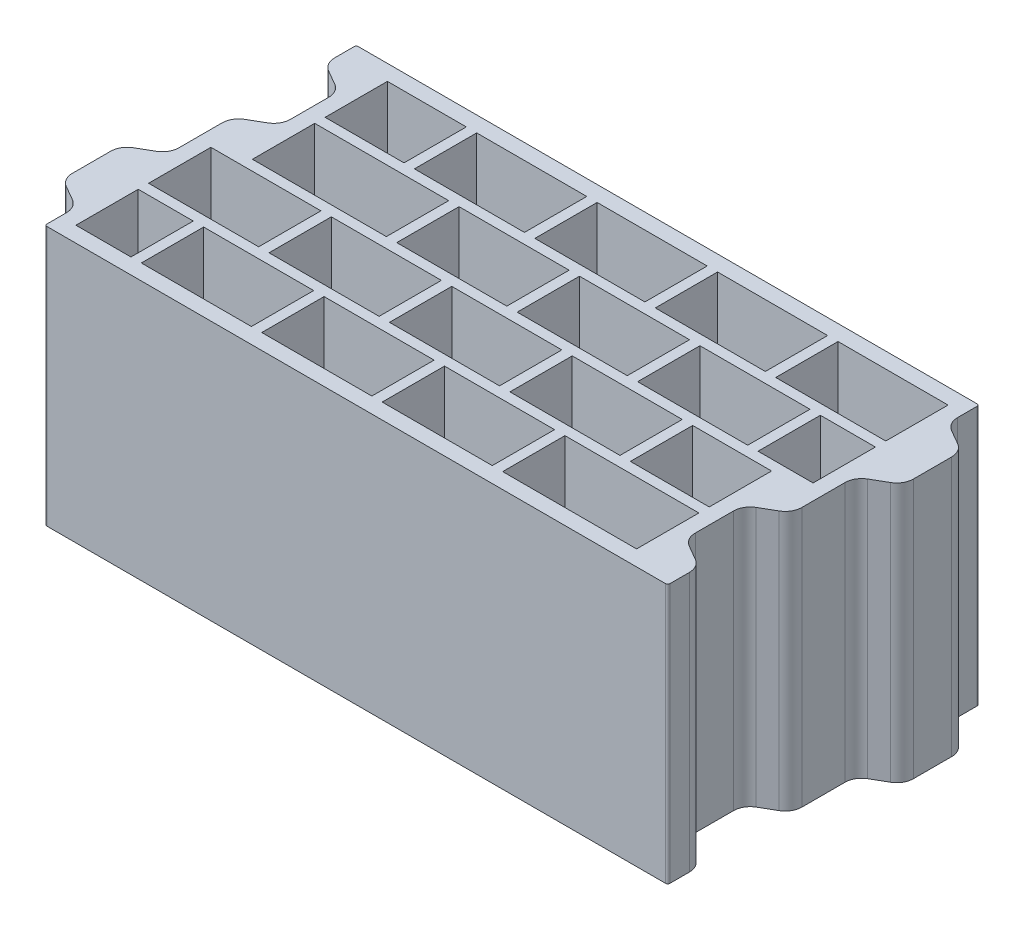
ISO-10303-21;
HEADER;
FILE_DESCRIPTION(('STEP AP214'),'2;1');
FILE_NAME('part.step','',(''),(''),'','','');
FILE_SCHEMA(('AUTOMOTIVE_DESIGN { 1 0 10303 214 1 1 1 1 }'));
ENDSEC;
DATA;
#1=APPLICATION_CONTEXT('core data for automotive mechanical design processes');
#2=APPLICATION_PROTOCOL_DEFINITION('international standard','automotive_design',2000,#1);
#3=PRODUCT_CONTEXT('',#1,'mechanical');
#4=PRODUCT('Part','Part','',(#3));
#5=PRODUCT_RELATED_PRODUCT_CATEGORY('part','',(#4));
#6=PRODUCT_DEFINITION_FORMATION('','',#4);
#7=PRODUCT_DEFINITION_CONTEXT('part definition',#1,'design');
#8=PRODUCT_DEFINITION('design','',#6,#7);
#9=PRODUCT_DEFINITION_SHAPE('','',#8);
#10=(LENGTH_UNIT() NAMED_UNIT(*) SI_UNIT(.MILLI.,.METRE.));
#11=(NAMED_UNIT(*) PLANE_ANGLE_UNIT() SI_UNIT($,.RADIAN.));
#12=(NAMED_UNIT(*) SI_UNIT($,.STERADIAN.) SOLID_ANGLE_UNIT());
#13=UNCERTAINTY_MEASURE_WITH_UNIT(LENGTH_MEASURE(1.E-05),#10,'distance_accuracy_value','');
#14=(GEOMETRIC_REPRESENTATION_CONTEXT(3) GLOBAL_UNCERTAINTY_ASSIGNED_CONTEXT((#13)) GLOBAL_UNIT_ASSIGNED_CONTEXT((#10,
#11,#12)) REPRESENTATION_CONTEXT('',''));
#15=CARTESIAN_POINT('',(0.,0.,0.));
#16=DIRECTION('',(0.,0.,1.));
#17=DIRECTION('',(1.,0.,0.));
#18=AXIS2_PLACEMENT_3D('',#15,#16,#17);
#19=CARTESIAN_POINT('',(61.6,25.,-27.9237604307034));
#20=DIRECTION('',(0.,1.,0.));
#21=DIRECTION('',(0.,0.,1.));
#22=AXIS2_PLACEMENT_3D('',#19,#20,#21);
#23=PLANE('',#22);
#24=DIRECTION('',(0.,0.,1.));
#25=VECTOR('',#24,1.);
#26=CARTESIAN_POINT('',(18.4000000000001,25.,-21.5));
#27=LINE('',#26,#25);
#28=CARTESIAN_POINT('',(18.4000000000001,25.,-21.5));
#29=VERTEX_POINT('',#28);
#30=CARTESIAN_POINT('',(18.4000000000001,25.,-15.5));
#31=VERTEX_POINT('',#30);
#32=EDGE_CURVE('E2779',#29,#31,#27,.T.);
#33=ORIENTED_EDGE('',*,*,#32,.F.);
#34=DIRECTION('',(-1.,0.,0.));
#35=VECTOR('',#34,1.);
#36=CARTESIAN_POINT('',(29.0000000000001,25.,-21.5));
#37=LINE('',#36,#35);
#38=CARTESIAN_POINT('',(29.0000000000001,25.,-21.5));
#39=VERTEX_POINT('',#38);
#40=EDGE_CURVE('E1470',#39,#29,#37,.T.);
#41=ORIENTED_EDGE('',*,*,#40,.F.);
#42=DIRECTION('',(0.,0.,-1.));
#43=VECTOR('',#42,1.);
#44=CARTESIAN_POINT('',(29.0000000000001,25.,-21.5));
#45=LINE('',#44,#43);
#46=CARTESIAN_POINT('',(29.0000000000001,25.,-15.5));
#47=VERTEX_POINT('',#46);
#48=EDGE_CURVE('E1449',#47,#39,#45,.T.);
#49=ORIENTED_EDGE('',*,*,#48,.F.);
#50=DIRECTION('',(1.,0.,0.));
#51=VECTOR('',#50,1.);
#52=CARTESIAN_POINT('',(29.0000000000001,25.,-15.5));
#53=LINE('',#52,#51);
#54=EDGE_CURVE('E2781',#31,#47,#53,.T.);
#55=ORIENTED_EDGE('',*,*,#54,.F.);
#56=EDGE_LOOP('',(#33,#41,#49,#55));
#57=FACE_BOUND('',#56,.T.);
#58=DIRECTION('',(1.,0.,0.));
#59=VECTOR('',#58,1.);
#60=CARTESIAN_POINT('',(4.5,25.,-15.5));
#61=LINE('',#60,#59);
#62=CARTESIAN_POINT('',(4.5,25.,-15.5));
#63=VERTEX_POINT('',#62);
#64=CARTESIAN_POINT('',(17.4000000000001,25.,-15.5));
#65=VERTEX_POINT('',#64);
#66=EDGE_CURVE('E703',#63,#65,#61,.T.);
#67=ORIENTED_EDGE('',*,*,#66,.F.);
#68=DIRECTION('',(0.,0.,1.));
#69=VECTOR('',#68,1.);
#70=CARTESIAN_POINT('',(4.5,25.,-21.5));
#71=LINE('',#70,#69);
#72=CARTESIAN_POINT('',(4.5,25.,-21.5));
#73=VERTEX_POINT('',#72);
#74=EDGE_CURVE('E700',#73,#63,#71,.T.);
#75=ORIENTED_EDGE('',*,*,#74,.F.);
#76=DIRECTION('',(-1.,0.,0.));
#77=VECTOR('',#76,1.);
#78=CARTESIAN_POINT('',(4.5,25.,-21.5));
#79=LINE('',#78,#77);
#80=CARTESIAN_POINT('',(17.4000000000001,25.,-21.5));
#81=VERTEX_POINT('',#80);
#82=EDGE_CURVE('E710',#81,#73,#79,.T.);
#83=ORIENTED_EDGE('',*,*,#82,.F.);
#84=DIRECTION('',(0.,0.,-1.));
#85=VECTOR('',#84,1.);
#86=CARTESIAN_POINT('',(17.4000000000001,25.,-21.5));
#87=LINE('',#86,#85);
#88=EDGE_CURVE('E707',#65,#81,#87,.T.);
#89=ORIENTED_EDGE('',*,*,#88,.F.);
#90=EDGE_LOOP('',(#67,#75,#83,#89));
#91=FACE_BOUND('',#90,.T.);
#92=DIRECTION('',(0.,0.,1.));
#93=VECTOR('',#92,1.);
#94=CARTESIAN_POINT('',(36.3000000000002,25.,-14.5));
#95=LINE('',#94,#93);
#96=CARTESIAN_POINT('',(36.3000000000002,25.,-14.5));
#97=VERTEX_POINT('',#96);
#98=CARTESIAN_POINT('',(36.3000000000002,25.,-8.50000000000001));
#99=VERTEX_POINT('',#98);
#100=EDGE_CURVE('E731',#97,#99,#95,.T.);
#101=ORIENTED_EDGE('',*,*,#100,.F.);
#102=DIRECTION('',(-1.,0.,0.));
#103=VECTOR('',#102,1.);
#104=CARTESIAN_POINT('',(36.3000000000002,25.,-14.5));
#105=LINE('',#104,#103);
#106=CARTESIAN_POINT('',(46.9000000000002,25.,-14.5));
#107=VERTEX_POINT('',#106);
#108=EDGE_CURVE('E728',#107,#97,#105,.T.);
#109=ORIENTED_EDGE('',*,*,#108,.F.);
#110=DIRECTION('',(0.,0.,-1.));
#111=VECTOR('',#110,1.);
#112=CARTESIAN_POINT('',(46.9000000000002,25.,-14.5));
#113=LINE('',#112,#111);
#114=CARTESIAN_POINT('',(46.9,25.,-8.50000000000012));
#115=VERTEX_POINT('',#114);
#116=EDGE_CURVE('E738',#115,#107,#113,.T.);
#117=ORIENTED_EDGE('',*,*,#116,.F.);
#118=DIRECTION('',(1.,0.,0.));
#119=VECTOR('',#118,1.);
#120=CARTESIAN_POINT('',(36.3000000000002,25.,-8.50000000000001));
#121=LINE('',#120,#119);
#122=EDGE_CURVE('E735',#99,#115,#121,.T.);
#123=ORIENTED_EDGE('',*,*,#122,.F.);
#124=EDGE_LOOP('',(#101,#109,#117,#123));
#125=FACE_BOUND('',#124,.T.);
#126=DIRECTION('',(0.,0.,-1.));
#127=VECTOR('',#126,1.);
#128=CARTESIAN_POINT('',(35.3000000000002,25.,-14.5));
#129=LINE('',#128,#127);
#130=CARTESIAN_POINT('',(35.3000000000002,25.,-8.50000000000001));
#131=VERTEX_POINT('',#130);
#132=CARTESIAN_POINT('',(35.3000000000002,25.,-14.5));
#133=VERTEX_POINT('',#132);
#134=EDGE_CURVE('E759',#131,#133,#129,.T.);
#135=ORIENTED_EDGE('',*,*,#134,.F.);
#136=DIRECTION('',(1.,0.,0.));
#137=VECTOR('',#136,1.);
#138=CARTESIAN_POINT('',(24.7000000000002,25.,-8.50000000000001));
#139=LINE('',#138,#137);
#140=CARTESIAN_POINT('',(24.7000000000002,25.,-8.50000000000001));
#141=VERTEX_POINT('',#140);
#142=EDGE_CURVE('E756',#141,#131,#139,.T.);
#143=ORIENTED_EDGE('',*,*,#142,.F.);
#144=DIRECTION('',(0.,0.,1.));
#145=VECTOR('',#144,1.);
#146=CARTESIAN_POINT('',(24.7000000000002,25.,-14.5));
#147=LINE('',#146,#145);
#148=CARTESIAN_POINT('',(24.7000000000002,25.,-14.5));
#149=VERTEX_POINT('',#148);
#150=EDGE_CURVE('E766',#149,#141,#147,.T.);
#151=ORIENTED_EDGE('',*,*,#150,.F.);
#152=DIRECTION('',(-1.,0.,0.));
#153=VECTOR('',#152,1.);
#154=CARTESIAN_POINT('',(35.3000000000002,25.,-14.5));
#155=LINE('',#154,#153);
#156=EDGE_CURVE('E763',#133,#149,#155,.T.);
#157=ORIENTED_EDGE('',*,*,#156,.F.);
#158=EDGE_LOOP('',(#135,#143,#151,#157));
#159=FACE_BOUND('',#158,.T.);
#160=DIRECTION('',(0.,0.,1.));
#161=VECTOR('',#160,1.);
#162=CARTESIAN_POINT('',(31.0000000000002,25.,-7.49999999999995));
#163=LINE('',#162,#161);
#164=CARTESIAN_POINT('',(31.0000000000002,25.,-7.49999999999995));
#165=VERTEX_POINT('',#164);
#166=CARTESIAN_POINT('',(31.0000000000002,25.,-1.49999999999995));
#167=VERTEX_POINT('',#166);
#168=EDGE_CURVE('E787',#165,#167,#163,.T.);
#169=ORIENTED_EDGE('',*,*,#168,.F.);
#170=DIRECTION('',(-1.,0.,0.));
#171=VECTOR('',#170,1.);
#172=CARTESIAN_POINT('',(31.0000000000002,25.,-7.49999999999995));
#173=LINE('',#172,#171);
#174=CARTESIAN_POINT('',(41.6000000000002,25.,-7.49999999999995));
#175=VERTEX_POINT('',#174);
#176=EDGE_CURVE('E784',#175,#165,#173,.T.);
#177=ORIENTED_EDGE('',*,*,#176,.F.);
#178=DIRECTION('',(0.,0.,-1.));
#179=VECTOR('',#178,1.);
#180=CARTESIAN_POINT('',(41.6000000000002,25.,-7.49999999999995));
#181=LINE('',#180,#179);
#182=CARTESIAN_POINT('',(41.6000000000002,25.,-1.49999999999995));
#183=VERTEX_POINT('',#182);
#184=EDGE_CURVE('E794',#183,#175,#181,.T.);
#185=ORIENTED_EDGE('',*,*,#184,.F.);
#186=DIRECTION('',(1.,0.,0.));
#187=VECTOR('',#186,1.);
#188=CARTESIAN_POINT('',(31.0000000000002,25.,-1.49999999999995));
#189=LINE('',#188,#187);
#190=EDGE_CURVE('E791',#167,#183,#189,.T.);
#191=ORIENTED_EDGE('',*,*,#190,.F.);
#192=EDGE_LOOP('',(#169,#177,#185,#191));
#193=FACE_BOUND('',#192,.T.);
#194=DIRECTION('',(0.,0.,1.));
#195=VECTOR('',#194,1.);
#196=CARTESIAN_POINT('',(47.9,25.,-28.5));
#197=LINE('',#196,#195);
#198=CARTESIAN_POINT('',(47.9,25.,-28.5));
#199=VERTEX_POINT('',#198);
#200=CARTESIAN_POINT('',(47.9,25.,-22.5));
#201=VERTEX_POINT('',#200);
#202=EDGE_CURVE('E815',#199,#201,#197,.T.);
#203=ORIENTED_EDGE('',*,*,#202,.F.);
#204=DIRECTION('',(-1.,0.,0.));
#205=VECTOR('',#204,1.);
#206=CARTESIAN_POINT('',(58.5,25.,-28.5));
#207=LINE('',#206,#205);
#208=CARTESIAN_POINT('',(58.5,25.,-28.5));
#209=VERTEX_POINT('',#208);
#210=EDGE_CURVE('E812',#209,#199,#207,.T.);
#211=ORIENTED_EDGE('',*,*,#210,.F.);
#212=DIRECTION('',(0.,0.,-1.));
#213=VECTOR('',#212,1.);
#214=CARTESIAN_POINT('',(58.5,25.,-28.5));
#215=LINE('',#214,#213);
#216=CARTESIAN_POINT('',(58.5,25.,-22.5));
#217=VERTEX_POINT('',#216);
#218=EDGE_CURVE('E822',#217,#209,#215,.T.);
#219=ORIENTED_EDGE('',*,*,#218,.F.);
#220=DIRECTION('',(1.,0.,0.));
#221=VECTOR('',#220,1.);
#222=CARTESIAN_POINT('',(58.5,25.,-22.5));
#223=LINE('',#222,#221);
#224=EDGE_CURVE('E819',#201,#217,#223,.T.);
#225=ORIENTED_EDGE('',*,*,#224,.F.);
#226=EDGE_LOOP('',(#203,#211,#219,#225));
#227=FACE_BOUND('',#226,.T.);
#228=DIRECTION('',(0.,0.,-1.));
#229=VECTOR('',#228,1.);
#230=CARTESIAN_POINT('',(6.80000000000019,25.,-7.49999999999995));
#231=LINE('',#230,#229);
#232=CARTESIAN_POINT('',(6.80000000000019,25.,-1.49999999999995));
#233=VERTEX_POINT('',#232);
#234=CARTESIAN_POINT('',(6.80000000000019,25.,-7.49999999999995));
#235=VERTEX_POINT('',#234);
#236=EDGE_CURVE('E843',#233,#235,#231,.T.);
#237=ORIENTED_EDGE('',*,*,#236,.F.);
#238=DIRECTION('',(1.,0.,0.));
#239=VECTOR('',#238,1.);
#240=CARTESIAN_POINT('',(1.5,25.,-1.49999999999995));
#241=LINE('',#240,#239);
#242=CARTESIAN_POINT('',(1.5,25.,-1.49999999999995));
#243=VERTEX_POINT('',#242);
#244=EDGE_CURVE('E840',#243,#233,#241,.T.);
#245=ORIENTED_EDGE('',*,*,#244,.F.);
#246=DIRECTION('',(0.,0.,1.));
#247=VECTOR('',#246,1.);
#248=CARTESIAN_POINT('',(1.5,25.,-7.49999999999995));
#249=LINE('',#248,#247);
#250=CARTESIAN_POINT('',(1.5,25.,-7.49999999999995));
#251=VERTEX_POINT('',#250);
#252=EDGE_CURVE('E850',#251,#243,#249,.T.);
#253=ORIENTED_EDGE('',*,*,#252,.F.);
#254=DIRECTION('',(-1.,0.,0.));
#255=VECTOR('',#254,1.);
#256=CARTESIAN_POINT('',(1.5,25.,-7.49999999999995));
#257=LINE('',#256,#255);
#258=EDGE_CURVE('E847',#235,#251,#257,.T.);
#259=ORIENTED_EDGE('',*,*,#258,.F.);
#260=EDGE_LOOP('',(#237,#245,#253,#259));
#261=FACE_BOUND('',#260,.T.);
#262=DIRECTION('',(0.,0.,1.));
#263=VECTOR('',#262,1.);
#264=CARTESIAN_POINT('',(13.1,25.,-28.5));
#265=LINE('',#264,#263);
#266=CARTESIAN_POINT('',(13.1,25.,-28.5));
#267=VERTEX_POINT('',#266);
#268=CARTESIAN_POINT('',(13.1,25.,-22.5));
#269=VERTEX_POINT('',#268);
#270=EDGE_CURVE('E869',#267,#269,#265,.T.);
#271=ORIENTED_EDGE('',*,*,#270,.F.);
#272=DIRECTION('',(-1.,0.,0.));
#273=VECTOR('',#272,1.);
#274=CARTESIAN_POINT('',(23.7000000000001,25.,-28.5));
#275=LINE('',#274,#273);
#276=CARTESIAN_POINT('',(23.7000000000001,25.,-28.5));
#277=VERTEX_POINT('',#276);
#278=EDGE_CURVE('E355',#277,#267,#275,.T.);
#279=ORIENTED_EDGE('',*,*,#278,.F.);
#280=DIRECTION('',(0.,0.,-1.));
#281=VECTOR('',#280,1.);
#282=CARTESIAN_POINT('',(23.7000000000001,25.,-28.5));
#283=LINE('',#282,#281);
#284=CARTESIAN_POINT('',(23.7,25.,-22.4999999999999));
#285=VERTEX_POINT('',#284);
#286=EDGE_CURVE('E873',#285,#277,#283,.T.);
#287=ORIENTED_EDGE('',*,*,#286,.F.);
#288=DIRECTION('',(1.,0.,0.));
#289=VECTOR('',#288,1.);
#290=CARTESIAN_POINT('',(23.7,25.,-22.4999999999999));
#291=LINE('',#290,#289);
#292=EDGE_CURVE('E871',#269,#285,#291,.T.);
#293=ORIENTED_EDGE('',*,*,#292,.F.);
#294=EDGE_LOOP('',(#271,#279,#287,#293));
#295=FACE_BOUND('',#294,.T.);
#296=DIRECTION('',(0.,0.,-1.));
#297=VECTOR('',#296,1.);
#298=CARTESIAN_POINT('',(12.1,25.,-28.5));
#299=LINE('',#298,#297);
#300=CARTESIAN_POINT('',(12.1,25.,-22.5));
#301=VERTEX_POINT('',#300);
#302=CARTESIAN_POINT('',(12.1,25.,-28.5));
#303=VERTEX_POINT('',#302);
#304=EDGE_CURVE('E889',#301,#303,#299,.T.);
#305=ORIENTED_EDGE('',*,*,#304,.F.);
#306=DIRECTION('',(1.,0.,0.));
#307=VECTOR('',#306,1.);
#308=CARTESIAN_POINT('',(4.5,25.,-22.5));
#309=LINE('',#308,#307);
#310=CARTESIAN_POINT('',(4.5,25.,-22.5));
#311=VERTEX_POINT('',#310);
#312=EDGE_CURVE('E887',#311,#301,#309,.T.);
#313=ORIENTED_EDGE('',*,*,#312,.F.);
#314=DIRECTION('',(0.,0.,1.));
#315=VECTOR('',#314,1.);
#316=CARTESIAN_POINT('',(4.5,25.,-28.5));
#317=LINE('',#316,#315);
#318=CARTESIAN_POINT('',(4.5,25.,-28.5));
#319=VERTEX_POINT('',#318);
#320=EDGE_CURVE('E895',#319,#311,#317,.T.);
#321=ORIENTED_EDGE('',*,*,#320,.F.);
#322=DIRECTION('',(-1.,0.,0.));
#323=VECTOR('',#322,1.);
#324=CARTESIAN_POINT('',(4.5,25.,-28.5));
#325=LINE('',#324,#323);
#326=EDGE_CURVE('E892',#303,#319,#325,.T.);
#327=ORIENTED_EDGE('',*,*,#326,.F.);
#328=EDGE_LOOP('',(#305,#313,#321,#327));
#329=FACE_BOUND('',#328,.T.);
#330=DIRECTION('',(0.,0.,-1.));
#331=VECTOR('',#330,1.);
#332=CARTESIAN_POINT('',(55.5,25.,-14.5));
#333=LINE('',#332,#331);
#334=CARTESIAN_POINT('',(55.5,25.,-8.50000000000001));
#335=VERTEX_POINT('',#334);
#336=CARTESIAN_POINT('',(55.5,25.,-14.5));
#337=VERTEX_POINT('',#336);
#338=EDGE_CURVE('E911',#335,#337,#333,.T.);
#339=ORIENTED_EDGE('',*,*,#338,.F.);
#340=DIRECTION('',(1.,0.,0.));
#341=VECTOR('',#340,1.);
#342=CARTESIAN_POINT('',(55.5,25.,-8.50000000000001));
#343=LINE('',#342,#341);
#344=CARTESIAN_POINT('',(47.9000000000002,25.,-8.50000000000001));
#345=VERTEX_POINT('',#344);
#346=EDGE_CURVE('E909',#345,#335,#343,.T.);
#347=ORIENTED_EDGE('',*,*,#346,.F.);
#348=DIRECTION('',(0.,0.,1.));
#349=VECTOR('',#348,1.);
#350=CARTESIAN_POINT('',(47.9000000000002,25.,-14.5));
#351=LINE('',#350,#349);
#352=CARTESIAN_POINT('',(47.9000000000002,25.,-14.5));
#353=VERTEX_POINT('',#352);
#354=EDGE_CURVE('E917',#353,#345,#351,.T.);
#355=ORIENTED_EDGE('',*,*,#354,.F.);
#356=DIRECTION('',(-1.,0.,0.));
#357=VECTOR('',#356,1.);
#358=CARTESIAN_POINT('',(55.5,25.,-14.5));
#359=LINE('',#358,#357);
#360=EDGE_CURVE('E914',#337,#353,#359,.T.);
#361=ORIENTED_EDGE('',*,*,#360,.F.);
#362=EDGE_LOOP('',(#339,#347,#355,#361));
#363=FACE_BOUND('',#362,.T.);
#364=CARTESIAN_POINT('',(61.6,25.,-27.9237604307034));
#365=DIRECTION('',(0.,-1.,0.));
#366=DIRECTION('',(0.,0.,1.));
#367=AXIS2_PLACEMENT_3D('',#364,#365,#366);
#368=CIRCLE('',#367,1.6);
#369=CARTESIAN_POINT('',(60.8,25.,-26.5381197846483));
#370=VERTEX_POINT('',#369);
#371=CARTESIAN_POINT('',(60.,25.,-27.9237604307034));
#372=VERTEX_POINT('',#371);
#373=EDGE_CURVE('E1002',#370,#372,#368,.T.);
#374=ORIENTED_EDGE('',*,*,#373,.T.);
#375=DIRECTION('',(0.,0.,-1.));
#376=VECTOR('',#375,1.);
#377=CARTESIAN_POINT('',(60.,25.,-29.8));
#378=LINE('',#377,#376);
#379=CARTESIAN_POINT('',(60.,25.,-29.8));
#380=VERTEX_POINT('',#379);
#381=EDGE_CURVE('E1005',#372,#380,#378,.T.);
#382=ORIENTED_EDGE('',*,*,#381,.T.);
#383=CARTESIAN_POINT('',(59.8,25.,-29.8));
#384=DIRECTION('',(0.,1.,0.));
#385=DIRECTION('',(0.,0.,1.));
#386=AXIS2_PLACEMENT_3D('',#383,#384,#385);
#387=CIRCLE('',#386,0.199999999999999);
#388=CARTESIAN_POINT('',(59.8,25.,-30.));
#389=VERTEX_POINT('',#388);
#390=EDGE_CURVE('E1007',#380,#389,#387,.T.);
#391=ORIENTED_EDGE('',*,*,#390,.T.);
#392=DIRECTION('',(-1.,0.,0.));
#393=VECTOR('',#392,1.);
#394=CARTESIAN_POINT('',(0.199999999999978,25.,-30.));
#395=LINE('',#394,#393);
#396=CARTESIAN_POINT('',(0.199999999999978,25.,-30.));
#397=VERTEX_POINT('',#396);
#398=EDGE_CURVE('E1009',#389,#397,#395,.T.);
#399=ORIENTED_EDGE('',*,*,#398,.T.);
#400=CARTESIAN_POINT('',(0.199999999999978,25.,-29.8));
#401=DIRECTION('',(0.,1.,0.));
#402=DIRECTION('',(0.,0.,-1.));
#403=AXIS2_PLACEMENT_3D('',#400,#401,#402);
#404=CIRCLE('',#403,0.200000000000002);
#405=CARTESIAN_POINT('',(0.,25.,-29.8));
#406=VERTEX_POINT('',#405);
#407=EDGE_CURVE('E1011',#397,#406,#404,.T.);
#408=ORIENTED_EDGE('',*,*,#407,.T.);
#409=DIRECTION('',(0.,0.,1.));
#410=VECTOR('',#409,1.);
#411=CARTESIAN_POINT('',(0.,25.,-29.8));
#412=LINE('',#411,#410);
#413=CARTESIAN_POINT('',(0.,25.,-27.9237604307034));
#414=VERTEX_POINT('',#413);
#415=EDGE_CURVE('E1013',#406,#414,#412,.T.);
#416=ORIENTED_EDGE('',*,*,#415,.T.);
#417=CARTESIAN_POINT('',(1.59999999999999,25.,-27.9237604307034));
#418=DIRECTION('',(0.,1.,0.));
#419=DIRECTION('',(0.,0.,1.));
#420=AXIS2_PLACEMENT_3D('',#417,#418,#419);
#421=CIRCLE('',#420,1.60000000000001);
#422=CARTESIAN_POINT('',(0.800000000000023,25.,-26.5381197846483));
#423=VERTEX_POINT('',#422);
#424=EDGE_CURVE('E1015',#414,#423,#421,.T.);
#425=ORIENTED_EDGE('',*,*,#424,.T.);
#426=DIRECTION('',(0.866025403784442,0.,0.499999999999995));
#427=VECTOR('',#426,1.);
#428=CARTESIAN_POINT('',(0.800000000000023,25.,-26.5381197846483));
#429=LINE('',#428,#427);
#430=CARTESIAN_POINT('',(2.19999999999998,25.,-25.7298294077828));
#431=VERTEX_POINT('',#430);
#432=EDGE_CURVE('E1017',#423,#431,#429,.T.);
#433=ORIENTED_EDGE('',*,*,#432,.T.);
#434=CARTESIAN_POINT('',(1.40000000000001,25.,-24.3441887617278));
#435=DIRECTION('',(0.,-1.,0.));
#436=DIRECTION('',(0.,0.,-1.));
#437=AXIS2_PLACEMENT_3D('',#434,#435,#436);
#438=CIRCLE('',#437,1.6);
#439=CARTESIAN_POINT('',(3.,25.,-24.3441887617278));
#440=VERTEX_POINT('',#439);
#441=EDGE_CURVE('E1019',#431,#440,#438,.T.);
#442=ORIENTED_EDGE('',*,*,#441,.T.);
#443=DIRECTION('',(0.,0.,1.));
#444=VECTOR('',#443,1.);
#445=CARTESIAN_POINT('',(3.,25.,-24.3441887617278));
#446=LINE('',#445,#444);
#447=CARTESIAN_POINT('',(3.,25.,-20.6603785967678));
#448=VERTEX_POINT('',#447);
#449=EDGE_CURVE('E1021',#440,#448,#446,.T.);
#450=ORIENTED_EDGE('',*,*,#449,.T.);
#451=CARTESIAN_POINT('',(1.40000000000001,25.,-20.6603785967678));
#452=DIRECTION('',(0.,-1.,0.));
#453=DIRECTION('',(0.,0.,-1.));
#454=AXIS2_PLACEMENT_3D('',#451,#452,#453);
#455=CIRCLE('',#454,1.6);
#456=CARTESIAN_POINT('',(2.20215355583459,25.,-19.2759835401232));
#457=VERTEX_POINT('',#456);
#458=EDGE_CURVE('E1023',#448,#457,#455,.T.);
#459=ORIENTED_EDGE('',*,*,#458,.T.);
#460=DIRECTION('',(-0.865246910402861,0.,0.501345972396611));
#461=VECTOR('',#460,1.);
#462=CARTESIAN_POINT('',(2.20215355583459,25.,-19.2759835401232));
#463=LINE('',#462,#461);
#464=CARTESIAN_POINT('',(0.797846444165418,25.,-18.4622924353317));
#465=VERTEX_POINT('',#464);
#466=EDGE_CURVE('E1025',#457,#465,#463,.T.);
#467=ORIENTED_EDGE('',*,*,#466,.T.);
#468=CARTESIAN_POINT('',(1.59999999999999,25.,-17.077897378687));
#469=DIRECTION('',(0.,1.,0.));
#470=DIRECTION('',(0.,0.,1.));
#471=AXIS2_PLACEMENT_3D('',#468,#469,#470);
#472=CIRCLE('',#471,1.6);
#473=CARTESIAN_POINT('',(0.,25.,-17.077897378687));
#474=VERTEX_POINT('',#473);
#475=EDGE_CURVE('E1027',#465,#474,#472,.T.);
#476=ORIENTED_EDGE('',*,*,#475,.T.);
#477=DIRECTION('',(0.,0.,1.));
#478=VECTOR('',#477,1.);
#479=CARTESIAN_POINT('',(0.,25.,-17.077897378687));
#480=LINE('',#479,#478);
#481=CARTESIAN_POINT('',(0.,25.,-12.922102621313));
#482=VERTEX_POINT('',#481);
#483=EDGE_CURVE('E1029',#474,#482,#480,.T.);
#484=ORIENTED_EDGE('',*,*,#483,.T.);
#485=CARTESIAN_POINT('',(-1.59999999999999,25.,-12.922102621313));
#486=DIRECTION('',(0.,-1.,0.));
#487=DIRECTION('',(0.,0.,1.));
#488=AXIS2_PLACEMENT_3D('',#485,#486,#487);
#489=CIRCLE('',#488,1.6);
#490=CARTESIAN_POINT('',(-0.797846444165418,25.,-11.5377075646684));
#491=VERTEX_POINT('',#490);
#492=EDGE_CURVE('E1031',#482,#491,#489,.T.);
#493=ORIENTED_EDGE('',*,*,#492,.T.);
#494=DIRECTION('',(-0.865246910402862,0.,0.50134597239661));
#495=VECTOR('',#494,1.);
#496=CARTESIAN_POINT('',(-2.20215355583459,25.,-10.7240164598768));
#497=LINE('',#496,#495);
#498=CARTESIAN_POINT('',(-2.20215355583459,25.,-10.7240164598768));
#499=VERTEX_POINT('',#498);
#500=EDGE_CURVE('E1033',#491,#499,#497,.T.);
#501=ORIENTED_EDGE('',*,*,#500,.T.);
#502=CARTESIAN_POINT('',(-1.40000000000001,25.,-9.33962140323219));
#503=DIRECTION('',(0.,1.,0.));
#504=DIRECTION('',(0.,0.,-1.));
#505=AXIS2_PLACEMENT_3D('',#502,#503,#504);
#506=CIRCLE('',#505,1.6);
#507=CARTESIAN_POINT('',(-3.,25.,-9.33962140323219));
#508=VERTEX_POINT('',#507);
#509=EDGE_CURVE('E1035',#499,#508,#506,.T.);
#510=ORIENTED_EDGE('',*,*,#509,.T.);
#511=DIRECTION('',(0.,0.,1.));
#512=VECTOR('',#511,1.);
#513=CARTESIAN_POINT('',(-3.,25.,-5.65581123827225));
#514=LINE('',#513,#512);
#515=CARTESIAN_POINT('',(-3.,25.,-5.65581123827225));
#516=VERTEX_POINT('',#515);
#517=EDGE_CURVE('E1037',#508,#516,#514,.T.);
#518=ORIENTED_EDGE('',*,*,#517,.T.);
#519=CARTESIAN_POINT('',(-1.40000000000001,25.,-5.65581123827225));
#520=DIRECTION('',(0.,1.,0.));
#521=DIRECTION('',(0.,0.,-1.));
#522=AXIS2_PLACEMENT_3D('',#519,#520,#521);
#523=CIRCLE('',#522,1.59999999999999);
#524=CARTESIAN_POINT('',(-2.19999999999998,25.,-4.27017059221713));
#525=VERTEX_POINT('',#524);
#526=EDGE_CURVE('E1039',#516,#525,#523,.T.);
#527=ORIENTED_EDGE('',*,*,#526,.T.);
#528=DIRECTION('',(0.866025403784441,0.,0.499999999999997));
#529=VECTOR('',#528,1.);
#530=CARTESIAN_POINT('',(-0.800000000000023,25.,-3.46188021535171));
#531=LINE('',#530,#529);
#532=CARTESIAN_POINT('',(-0.800000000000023,25.,-3.46188021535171));
#533=VERTEX_POINT('',#532);
#534=EDGE_CURVE('E1041',#525,#533,#531,.T.);
#535=ORIENTED_EDGE('',*,*,#534,.T.);
#536=CARTESIAN_POINT('',(-1.59999999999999,25.,-2.07623956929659));
#537=DIRECTION('',(0.,-1.,0.));
#538=DIRECTION('',(0.,0.,1.));
#539=AXIS2_PLACEMENT_3D('',#536,#537,#538);
#540=CIRCLE('',#539,1.59999999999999);
#541=CARTESIAN_POINT('',(0.,25.,-2.07623956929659));
#542=VERTEX_POINT('',#541);
#543=EDGE_CURVE('E1043',#533,#542,#540,.T.);
#544=ORIENTED_EDGE('',*,*,#543,.T.);
#545=DIRECTION('',(0.,0.,1.));
#546=VECTOR('',#545,1.);
#547=CARTESIAN_POINT('',(0.,25.,-0.199999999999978));
#548=LINE('',#547,#546);
#549=CARTESIAN_POINT('',(0.,25.,-0.199999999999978));
#550=VERTEX_POINT('',#549);
#551=EDGE_CURVE('E1045',#542,#550,#548,.T.);
#552=ORIENTED_EDGE('',*,*,#551,.T.);
#553=CARTESIAN_POINT('',(0.199999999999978,25.,-0.199999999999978));
#554=DIRECTION('',(0.,1.,0.));
#555=DIRECTION('',(0.,0.,1.));
#556=AXIS2_PLACEMENT_3D('',#553,#554,#555);
#557=CIRCLE('',#556,0.200000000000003);
#558=CARTESIAN_POINT('',(0.199999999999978,25.,0.));
#559=VERTEX_POINT('',#558);
#560=EDGE_CURVE('E1047',#550,#559,#557,.T.);
#561=ORIENTED_EDGE('',*,*,#560,.T.);
#562=DIRECTION('',(1.,0.,0.));
#563=VECTOR('',#562,1.);
#564=CARTESIAN_POINT('',(0.199999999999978,25.,0.));
#565=LINE('',#564,#563);
#566=CARTESIAN_POINT('',(59.8,25.,0.));
#567=VERTEX_POINT('',#566);
#568=EDGE_CURVE('E1049',#559,#567,#565,.T.);
#569=ORIENTED_EDGE('',*,*,#568,.T.);
#570=CARTESIAN_POINT('',(59.8,25.,-0.199999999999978));
#571=DIRECTION('',(0.,1.,0.));
#572=DIRECTION('',(0.,0.,-1.));
#573=AXIS2_PLACEMENT_3D('',#570,#571,#572);
#574=CIRCLE('',#573,0.199999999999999);
#575=CARTESIAN_POINT('',(60.,25.,-0.199999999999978));
#576=VERTEX_POINT('',#575);
#577=EDGE_CURVE('E1051',#567,#576,#574,.T.);
#578=ORIENTED_EDGE('',*,*,#577,.T.);
#579=DIRECTION('',(0.,0.,-1.));
#580=VECTOR('',#579,1.);
#581=CARTESIAN_POINT('',(60.,25.,-0.199999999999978));
#582=LINE('',#581,#580);
#583=CARTESIAN_POINT('',(60.,25.,-2.07623956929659));
#584=VERTEX_POINT('',#583);
#585=EDGE_CURVE('E1053',#576,#584,#582,.T.);
#586=ORIENTED_EDGE('',*,*,#585,.T.);
#587=CARTESIAN_POINT('',(58.4,25.,-2.07623956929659));
#588=DIRECTION('',(0.,1.,0.));
#589=DIRECTION('',(0.,0.,1.));
#590=AXIS2_PLACEMENT_3D('',#587,#588,#589);
#591=CIRCLE('',#590,1.6);
#592=CARTESIAN_POINT('',(59.2,25.,-3.46188021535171));
#593=VERTEX_POINT('',#592);
#594=EDGE_CURVE('E1055',#584,#593,#591,.T.);
#595=ORIENTED_EDGE('',*,*,#594,.T.);
#596=DIRECTION('',(-0.866025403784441,0.,-0.499999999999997));
#597=VECTOR('',#596,1.);
#598=CARTESIAN_POINT('',(59.2,25.,-3.46188021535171));
#599=LINE('',#598,#597);
#600=CARTESIAN_POINT('',(57.8,25.,-4.27017059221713));
#601=VERTEX_POINT('',#600);
#602=EDGE_CURVE('E1057',#593,#601,#599,.T.);
#603=ORIENTED_EDGE('',*,*,#602,.T.);
#604=CARTESIAN_POINT('',(58.6,25.,-5.65581123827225));
#605=DIRECTION('',(0.,-1.,0.));
#606=DIRECTION('',(0.,0.,-1.));
#607=AXIS2_PLACEMENT_3D('',#604,#605,#606);
#608=CIRCLE('',#607,1.59999999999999);
#609=CARTESIAN_POINT('',(57.,25.,-5.65581123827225));
#610=VERTEX_POINT('',#609);
#611=EDGE_CURVE('E1059',#601,#610,#608,.T.);
#612=ORIENTED_EDGE('',*,*,#611,.T.);
#613=DIRECTION('',(0.,0.,-1.));
#614=VECTOR('',#613,1.);
#615=CARTESIAN_POINT('',(57.,25.,-5.65581123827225));
#616=LINE('',#615,#614);
#617=CARTESIAN_POINT('',(57.,25.,-9.33962140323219));
#618=VERTEX_POINT('',#617);
#619=EDGE_CURVE('E1061',#610,#618,#616,.T.);
#620=ORIENTED_EDGE('',*,*,#619,.T.);
#621=CARTESIAN_POINT('',(58.6,25.,-9.33962140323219));
#622=DIRECTION('',(0.,-1.,0.));
#623=DIRECTION('',(0.,0.,-1.));
#624=AXIS2_PLACEMENT_3D('',#621,#622,#623);
#625=CIRCLE('',#624,1.6);
#626=CARTESIAN_POINT('',(57.7978464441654,25.,-10.7240164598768));
#627=VERTEX_POINT('',#626);
#628=EDGE_CURVE('E1063',#618,#627,#625,.T.);
#629=ORIENTED_EDGE('',*,*,#628,.T.);
#630=DIRECTION('',(0.865246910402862,0.,-0.50134597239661));
#631=VECTOR('',#630,1.);
#632=CARTESIAN_POINT('',(57.7978464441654,25.,-10.7240164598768));
#633=LINE('',#632,#631);
#634=CARTESIAN_POINT('',(59.2021535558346,25.,-11.5377075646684));
#635=VERTEX_POINT('',#634);
#636=EDGE_CURVE('E1065',#627,#635,#633,.T.);
#637=ORIENTED_EDGE('',*,*,#636,.T.);
#638=CARTESIAN_POINT('',(58.4,25.,-12.922102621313));
#639=DIRECTION('',(0.,1.,0.));
#640=DIRECTION('',(0.,0.,1.));
#641=AXIS2_PLACEMENT_3D('',#638,#639,#640);
#642=CIRCLE('',#641,1.6);
#643=CARTESIAN_POINT('',(60.,25.,-12.922102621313));
#644=VERTEX_POINT('',#643);
#645=EDGE_CURVE('E1067',#635,#644,#642,.T.);
#646=ORIENTED_EDGE('',*,*,#645,.T.);
#647=DIRECTION('',(0.,0.,-1.));
#648=VECTOR('',#647,1.);
#649=CARTESIAN_POINT('',(60.,25.,-17.077897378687));
#650=LINE('',#649,#648);
#651=CARTESIAN_POINT('',(60.,25.,-17.077897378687));
#652=VERTEX_POINT('',#651);
#653=EDGE_CURVE('E1069',#644,#652,#650,.T.);
#654=ORIENTED_EDGE('',*,*,#653,.T.);
#655=CARTESIAN_POINT('',(61.6,25.,-17.077897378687));
#656=DIRECTION('',(0.,-1.,0.));
#657=DIRECTION('',(0.,0.,1.));
#658=AXIS2_PLACEMENT_3D('',#655,#656,#657);
#659=CIRCLE('',#658,1.6);
#660=CARTESIAN_POINT('',(60.7978464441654,25.,-18.4622924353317));
#661=VERTEX_POINT('',#660);
#662=EDGE_CURVE('E1071',#652,#661,#659,.T.);
#663=ORIENTED_EDGE('',*,*,#662,.T.);
#664=DIRECTION('',(0.865246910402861,0.,-0.501345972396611));
#665=VECTOR('',#664,1.);
#666=CARTESIAN_POINT('',(62.2021535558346,25.,-19.2759835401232));
#667=LINE('',#666,#665);
#668=CARTESIAN_POINT('',(62.2021535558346,25.,-19.2759835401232));
#669=VERTEX_POINT('',#668);
#670=EDGE_CURVE('E1073',#661,#669,#667,.T.);
#671=ORIENTED_EDGE('',*,*,#670,.T.);
#672=CARTESIAN_POINT('',(61.4,25.,-20.6603785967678));
#673=DIRECTION('',(0.,1.,0.));
#674=DIRECTION('',(0.,0.,-1.));
#675=AXIS2_PLACEMENT_3D('',#672,#673,#674);
#676=CIRCLE('',#675,1.6);
#677=CARTESIAN_POINT('',(63.,25.,-20.6603785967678));
#678=VERTEX_POINT('',#677);
#679=EDGE_CURVE('E1075',#669,#678,#676,.T.);
#680=ORIENTED_EDGE('',*,*,#679,.T.);
#681=DIRECTION('',(0.,0.,-1.));
#682=VECTOR('',#681,1.);
#683=CARTESIAN_POINT('',(63.,25.,-24.3441887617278));
#684=LINE('',#683,#682);
#685=CARTESIAN_POINT('',(63.,25.,-24.3441887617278));
#686=VERTEX_POINT('',#685);
#687=EDGE_CURVE('E1077',#678,#686,#684,.T.);
#688=ORIENTED_EDGE('',*,*,#687,.T.);
#689=CARTESIAN_POINT('',(61.4,25.,-24.3441887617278));
#690=DIRECTION('',(0.,1.,0.));
#691=DIRECTION('',(0.,0.,-1.));
#692=AXIS2_PLACEMENT_3D('',#689,#690,#691);
#693=CIRCLE('',#692,1.6);
#694=CARTESIAN_POINT('',(62.2,25.,-25.7298294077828));
#695=VERTEX_POINT('',#694);
#696=EDGE_CURVE('E1079',#686,#695,#693,.T.);
#697=ORIENTED_EDGE('',*,*,#696,.T.);
#698=DIRECTION('',(-0.866025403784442,0.,-0.499999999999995));
#699=VECTOR('',#698,1.);
#700=CARTESIAN_POINT('',(60.8,25.,-26.5381197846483));
#701=LINE('',#700,#699);
#702=EDGE_CURVE('E1081',#695,#370,#701,.T.);
#703=ORIENTED_EDGE('',*,*,#702,.T.);
#704=EDGE_LOOP('',(#374,#382,#391,#399,#408,#416,#425,#433,#442,#450,#459,#467,#476,#484,#493,
#501,#510,#518,#527,#535,#544,#552,#561,#569,#578,#586,#595,#603,#612,#620,#629,#637,#646,#654,
#663,#671,#680,#688,#697,#703));
#705=FACE_BOUND('',#704,.T.);
#706=DIRECTION('',(0.,0.,-1.));
#707=VECTOR('',#706,1.);
#708=CARTESIAN_POINT('',(55.5,25.,-7.49999999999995));
#709=LINE('',#708,#707);
#710=CARTESIAN_POINT('',(55.5,25.,-1.5));
#711=VERTEX_POINT('',#710);
#712=CARTESIAN_POINT('',(55.5,25.,-7.49999999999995));
#713=VERTEX_POINT('',#712);
#714=EDGE_CURVE('E900',#711,#713,#709,.T.);
#715=ORIENTED_EDGE('',*,*,#714,.F.);
#716=DIRECTION('',(1.,0.,0.));
#717=VECTOR('',#716,1.);
#718=CARTESIAN_POINT('',(55.5,25.,-1.5));
#719=LINE('',#718,#717);
#720=CARTESIAN_POINT('',(42.6000000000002,25.,-1.49999999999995));
#721=VERTEX_POINT('',#720);
#722=EDGE_CURVE('E898',#721,#711,#719,.T.);
#723=ORIENTED_EDGE('',*,*,#722,.F.);
#724=DIRECTION('',(0.,0.,1.));
#725=VECTOR('',#724,1.);
#726=CARTESIAN_POINT('',(42.6000000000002,25.,-7.49999999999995));
#727=LINE('',#726,#725);
#728=CARTESIAN_POINT('',(42.6000000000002,25.,-7.49999999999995));
#729=VERTEX_POINT('',#728);
#730=EDGE_CURVE('E906',#729,#721,#727,.T.);
#731=ORIENTED_EDGE('',*,*,#730,.F.);
#732=DIRECTION('',(-1.,0.,0.));
#733=VECTOR('',#732,1.);
#734=CARTESIAN_POINT('',(42.6000000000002,25.,-7.49999999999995));
#735=LINE('',#734,#733);
#736=EDGE_CURVE('E903',#713,#729,#735,.T.);
#737=ORIENTED_EDGE('',*,*,#736,.F.);
#738=EDGE_LOOP('',(#715,#723,#731,#737));
#739=FACE_BOUND('',#738,.T.);
#740=DIRECTION('',(0.,0.,-1.));
#741=VECTOR('',#740,1.);
#742=CARTESIAN_POINT('',(35.3,25.,-28.5));
#743=LINE('',#742,#741);
#744=CARTESIAN_POINT('',(35.3,25.,-22.5));
#745=VERTEX_POINT('',#744);
#746=CARTESIAN_POINT('',(35.3,25.,-28.5));
#747=VERTEX_POINT('',#746);
#748=EDGE_CURVE('E878',#745,#747,#743,.T.);
#749=ORIENTED_EDGE('',*,*,#748,.F.);
#750=DIRECTION('',(1.,0.,0.));
#751=VECTOR('',#750,1.);
#752=CARTESIAN_POINT('',(24.7,25.,-22.5));
#753=LINE('',#752,#751);
#754=CARTESIAN_POINT('',(24.7,25.,-22.5));
#755=VERTEX_POINT('',#754);
#756=EDGE_CURVE('E876',#755,#745,#753,.T.);
#757=ORIENTED_EDGE('',*,*,#756,.F.);
#758=DIRECTION('',(0.,0.,1.));
#759=VECTOR('',#758,1.);
#760=CARTESIAN_POINT('',(24.7,25.,-28.5));
#761=LINE('',#760,#759);
#762=CARTESIAN_POINT('',(24.7,25.,-28.5));
#763=VERTEX_POINT('',#762);
#764=EDGE_CURVE('E884',#763,#755,#761,.T.);
#765=ORIENTED_EDGE('',*,*,#764,.F.);
#766=DIRECTION('',(-1.,0.,0.));
#767=VECTOR('',#766,1.);
#768=CARTESIAN_POINT('',(35.3,25.,-28.5));
#769=LINE('',#768,#767);
#770=EDGE_CURVE('E881',#747,#763,#769,.T.);
#771=ORIENTED_EDGE('',*,*,#770,.F.);
#772=EDGE_LOOP('',(#749,#757,#765,#771));
#773=FACE_BOUND('',#772,.T.);
#774=DIRECTION('',(0.,0.,1.));
#775=VECTOR('',#774,1.);
#776=CARTESIAN_POINT('',(36.3,25.,-28.5));
#777=LINE('',#776,#775);
#778=CARTESIAN_POINT('',(36.3,25.,-28.5));
#779=VERTEX_POINT('',#778);
#780=CARTESIAN_POINT('',(36.3,25.,-22.5));
#781=VERTEX_POINT('',#780);
#782=EDGE_CURVE('E857',#779,#781,#777,.T.);
#783=ORIENTED_EDGE('',*,*,#782,.F.);
#784=DIRECTION('',(-1.,0.,0.));
#785=VECTOR('',#784,1.);
#786=CARTESIAN_POINT('',(36.3,25.,-28.5));
#787=LINE('',#786,#785);
#788=CARTESIAN_POINT('',(46.9,25.,-28.5));
#789=VERTEX_POINT('',#788);
#790=EDGE_CURVE('E854',#789,#779,#787,.T.);
#791=ORIENTED_EDGE('',*,*,#790,.F.);
#792=DIRECTION('',(0.,0.,-1.));
#793=VECTOR('',#792,1.);
#794=CARTESIAN_POINT('',(46.9,25.,-28.5));
#795=LINE('',#794,#793);
#796=CARTESIAN_POINT('',(46.9,25.,-22.5));
#797=VERTEX_POINT('',#796);
#798=EDGE_CURVE('E864',#797,#789,#795,.T.);
#799=ORIENTED_EDGE('',*,*,#798,.F.);
#800=DIRECTION('',(1.,0.,0.));
#801=VECTOR('',#800,1.);
#802=CARTESIAN_POINT('',(36.3,25.,-22.5));
#803=LINE('',#802,#801);
#804=EDGE_CURVE('E861',#781,#797,#803,.T.);
#805=ORIENTED_EDGE('',*,*,#804,.F.);
#806=EDGE_LOOP('',(#783,#791,#799,#805));
#807=FACE_BOUND('',#806,.T.);
#808=DIRECTION('',(0.,0.,-1.));
#809=VECTOR('',#808,1.);
#810=CARTESIAN_POINT('',(30.0000000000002,25.,-7.49999999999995));
#811=LINE('',#810,#809);
#812=CARTESIAN_POINT('',(30.0000000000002,25.,-1.49999999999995));
#813=VERTEX_POINT('',#812);
#814=CARTESIAN_POINT('',(30.0000000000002,25.,-7.49999999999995));
#815=VERTEX_POINT('',#814);
#816=EDGE_CURVE('E829',#813,#815,#811,.T.);
#817=ORIENTED_EDGE('',*,*,#816,.F.);
#818=DIRECTION('',(1.,0.,0.));
#819=VECTOR('',#818,1.);
#820=CARTESIAN_POINT('',(19.4000000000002,25.,-1.49999999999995));
#821=LINE('',#820,#819);
#822=CARTESIAN_POINT('',(19.4000000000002,25.,-1.49999999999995));
#823=VERTEX_POINT('',#822);
#824=EDGE_CURVE('E826',#823,#813,#821,.T.);
#825=ORIENTED_EDGE('',*,*,#824,.F.);
#826=DIRECTION('',(0.,0.,1.));
#827=VECTOR('',#826,1.);
#828=CARTESIAN_POINT('',(19.4000000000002,25.,-7.49999999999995));
#829=LINE('',#828,#827);
#830=CARTESIAN_POINT('',(19.4000000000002,25.,-7.49999999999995));
#831=VERTEX_POINT('',#830);
#832=EDGE_CURVE('E836',#831,#823,#829,.T.);
#833=ORIENTED_EDGE('',*,*,#832,.F.);
#834=DIRECTION('',(-1.,0.,0.));
#835=VECTOR('',#834,1.);
#836=CARTESIAN_POINT('',(30.0000000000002,25.,-7.49999999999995));
#837=LINE('',#836,#835);
#838=EDGE_CURVE('E833',#815,#831,#837,.T.);
#839=ORIENTED_EDGE('',*,*,#838,.F.);
#840=EDGE_LOOP('',(#817,#825,#833,#839));
#841=FACE_BOUND('',#840,.T.);
#842=DIRECTION('',(0.,0.,1.));
#843=VECTOR('',#842,1.);
#844=CARTESIAN_POINT('',(7.8000000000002,25.,-7.49999999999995));
#845=LINE('',#844,#843);
#846=CARTESIAN_POINT('',(7.8000000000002,25.,-7.49999999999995));
#847=VERTEX_POINT('',#846);
#848=CARTESIAN_POINT('',(7.8000000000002,25.,-1.49999999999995));
#849=VERTEX_POINT('',#848);
#850=EDGE_CURVE('E801',#847,#849,#845,.T.);
#851=ORIENTED_EDGE('',*,*,#850,.F.);
#852=DIRECTION('',(-1.,0.,0.));
#853=VECTOR('',#852,1.);
#854=CARTESIAN_POINT('',(18.4000000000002,25.,-7.49999999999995));
#855=LINE('',#854,#853);
#856=CARTESIAN_POINT('',(18.4000000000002,25.,-7.49999999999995));
#857=VERTEX_POINT('',#856);
#858=EDGE_CURVE('E798',#857,#847,#855,.T.);
#859=ORIENTED_EDGE('',*,*,#858,.F.);
#860=DIRECTION('',(0.,0.,-1.));
#861=VECTOR('',#860,1.);
#862=CARTESIAN_POINT('',(18.4000000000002,25.,-7.49999999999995));
#863=LINE('',#862,#861);
#864=CARTESIAN_POINT('',(18.4000000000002,25.,-1.49999999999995));
#865=VERTEX_POINT('',#864);
#866=EDGE_CURVE('E808',#865,#857,#863,.T.);
#867=ORIENTED_EDGE('',*,*,#866,.F.);
#868=DIRECTION('',(1.,0.,0.));
#869=VECTOR('',#868,1.);
#870=CARTESIAN_POINT('',(18.4000000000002,25.,-1.49999999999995));
#871=LINE('',#870,#869);
#872=EDGE_CURVE('E805',#849,#865,#871,.T.);
#873=ORIENTED_EDGE('',*,*,#872,.F.);
#874=EDGE_LOOP('',(#851,#859,#867,#873));
#875=FACE_BOUND('',#874,.T.);
#876=DIRECTION('',(-1.,0.,0.));
#877=VECTOR('',#876,1.);
#878=CARTESIAN_POINT('',(1.50000000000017,25.,-14.5));
#879=LINE('',#878,#877);
#880=CARTESIAN_POINT('',(12.1000000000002,25.,-14.5));
#881=VERTEX_POINT('',#880);
#882=CARTESIAN_POINT('',(1.50000000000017,25.,-14.5));
#883=VERTEX_POINT('',#882);
#884=EDGE_CURVE('E773',#881,#883,#879,.T.);
#885=ORIENTED_EDGE('',*,*,#884,.F.);
#886=DIRECTION('',(0.,0.,-1.));
#887=VECTOR('',#886,1.);
#888=CARTESIAN_POINT('',(12.1000000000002,25.,-14.5));
#889=LINE('',#888,#887);
#890=CARTESIAN_POINT('',(12.1,25.,-8.50000000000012));
#891=VERTEX_POINT('',#890);
#892=EDGE_CURVE('E770',#891,#881,#889,.T.);
#893=ORIENTED_EDGE('',*,*,#892,.F.);
#894=DIRECTION('',(1.,0.,0.));
#895=VECTOR('',#894,1.);
#896=CARTESIAN_POINT('',(1.50000000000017,25.,-8.50000000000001));
#897=LINE('',#896,#895);
#898=CARTESIAN_POINT('',(1.50000000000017,25.,-8.50000000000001));
#899=VERTEX_POINT('',#898);
#900=EDGE_CURVE('E780',#899,#891,#897,.T.);
#901=ORIENTED_EDGE('',*,*,#900,.F.);
#902=DIRECTION('',(0.,0.,1.));
#903=VECTOR('',#902,1.);
#904=CARTESIAN_POINT('',(1.50000000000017,25.,-14.5));
#905=LINE('',#904,#903);
#906=EDGE_CURVE('E777',#883,#899,#905,.T.);
#907=ORIENTED_EDGE('',*,*,#906,.F.);
#908=EDGE_LOOP('',(#885,#893,#901,#907));
#909=FACE_BOUND('',#908,.T.);
#910=DIRECTION('',(0.,0.,1.));
#911=VECTOR('',#910,1.);
#912=CARTESIAN_POINT('',(13.1000000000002,25.,-14.5));
#913=LINE('',#912,#911);
#914=CARTESIAN_POINT('',(13.1000000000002,25.,-14.5));
#915=VERTEX_POINT('',#914);
#916=CARTESIAN_POINT('',(13.1,25.,-8.50000000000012));
#917=VERTEX_POINT('',#916);
#918=EDGE_CURVE('E745',#915,#917,#913,.T.);
#919=ORIENTED_EDGE('',*,*,#918,.F.);
#920=DIRECTION('',(-1.,0.,0.));
#921=VECTOR('',#920,1.);
#922=CARTESIAN_POINT('',(23.7000000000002,25.,-14.5));
#923=LINE('',#922,#921);
#924=CARTESIAN_POINT('',(23.7000000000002,25.,-14.5));
#925=VERTEX_POINT('',#924);
#926=EDGE_CURVE('E742',#925,#915,#923,.T.);
#927=ORIENTED_EDGE('',*,*,#926,.F.);
#928=DIRECTION('',(0.,0.,-1.));
#929=VECTOR('',#928,1.);
#930=CARTESIAN_POINT('',(23.7000000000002,25.,-14.5));
#931=LINE('',#930,#929);
#932=CARTESIAN_POINT('',(23.7000000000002,25.,-8.50000000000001));
#933=VERTEX_POINT('',#932);
#934=EDGE_CURVE('E752',#933,#925,#931,.T.);
#935=ORIENTED_EDGE('',*,*,#934,.F.);
#936=DIRECTION('',(1.,0.,0.));
#937=VECTOR('',#936,1.);
#938=CARTESIAN_POINT('',(23.7000000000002,25.,-8.50000000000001));
#939=LINE('',#938,#937);
#940=EDGE_CURVE('E749',#917,#933,#939,.T.);
#941=ORIENTED_EDGE('',*,*,#940,.F.);
#942=EDGE_LOOP('',(#919,#927,#935,#941));
#943=FACE_BOUND('',#942,.T.);
#944=DIRECTION('',(-1.,0.,0.));
#945=VECTOR('',#944,1.);
#946=CARTESIAN_POINT('',(58.5000000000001,25.,-21.5));
#947=LINE('',#946,#945);
#948=CARTESIAN_POINT('',(58.5000000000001,25.,-21.5));
#949=VERTEX_POINT('',#948);
#950=CARTESIAN_POINT('',(53.2000000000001,25.,-21.5));
#951=VERTEX_POINT('',#950);
#952=EDGE_CURVE('E717',#949,#951,#947,.T.);
#953=ORIENTED_EDGE('',*,*,#952,.F.);
#954=DIRECTION('',(0.,0.,-1.));
#955=VECTOR('',#954,1.);
#956=CARTESIAN_POINT('',(58.5000000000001,25.,-21.5));
#957=LINE('',#956,#955);
#958=CARTESIAN_POINT('',(58.5000000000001,25.,-15.5));
#959=VERTEX_POINT('',#958);
#960=EDGE_CURVE('E714',#959,#949,#957,.T.);
#961=ORIENTED_EDGE('',*,*,#960,.F.);
#962=DIRECTION('',(1.,0.,0.));
#963=VECTOR('',#962,1.);
#964=CARTESIAN_POINT('',(58.5000000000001,25.,-15.5));
#965=LINE('',#964,#963);
#966=CARTESIAN_POINT('',(53.2000000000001,25.,-15.5));
#967=VERTEX_POINT('',#966);
#968=EDGE_CURVE('E724',#967,#959,#965,.T.);
#969=ORIENTED_EDGE('',*,*,#968,.F.);
#970=DIRECTION('',(0.,0.,1.));
#971=VECTOR('',#970,1.);
#972=CARTESIAN_POINT('',(53.2000000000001,25.,-21.5));
#973=LINE('',#972,#971);
#974=EDGE_CURVE('E721',#951,#967,#973,.T.);
#975=ORIENTED_EDGE('',*,*,#974,.F.);
#976=EDGE_LOOP('',(#953,#961,#969,#975));
#977=FACE_BOUND('',#976,.T.);
#978=DIRECTION('',(0.,0.,-1.));
#979=VECTOR('',#978,1.);
#980=CARTESIAN_POINT('',(40.6000000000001,25.,-21.5));
#981=LINE('',#980,#979);
#982=CARTESIAN_POINT('',(40.6000000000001,25.,-15.5));
#983=VERTEX_POINT('',#982);
#984=CARTESIAN_POINT('',(40.6000000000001,25.,-21.5));
#985=VERTEX_POINT('',#984);
#986=EDGE_CURVE('E690',#983,#985,#981,.T.);
#987=ORIENTED_EDGE('',*,*,#986,.F.);
#988=DIRECTION('',(1.,0.,0.));
#989=VECTOR('',#988,1.);
#990=CARTESIAN_POINT('',(30.0000000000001,25.,-15.5));
#991=LINE('',#990,#989);
#992=CARTESIAN_POINT('',(30.0000000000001,25.,-15.5));
#993=VERTEX_POINT('',#992);
#994=EDGE_CURVE('E695',#993,#983,#991,.T.);
#995=ORIENTED_EDGE('',*,*,#994,.F.);
#996=DIRECTION('',(0.,0.,1.));
#997=VECTOR('',#996,1.);
#998=CARTESIAN_POINT('',(30.0000000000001,25.,-21.5));
#999=LINE('',#998,#997);
#1000=CARTESIAN_POINT('',(30.0000000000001,25.,-21.5));
#1001=VERTEX_POINT('',#1000);
#1002=EDGE_CURVE('E673',#1001,#993,#999,.T.);
#1003=ORIENTED_EDGE('',*,*,#1002,.F.);
#1004=DIRECTION('',(-1.,0.,0.));
#1005=VECTOR('',#1004,1.);
#1006=CARTESIAN_POINT('',(40.6000000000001,25.,-21.5));
#1007=LINE('',#1006,#1005);
#1008=EDGE_CURVE('E685',#985,#1001,#1007,.T.);
#1009=ORIENTED_EDGE('',*,*,#1008,.F.);
#1010=EDGE_LOOP('',(#987,#995,#1003,#1009));
#1011=FACE_BOUND('',#1010,.T.);
#1012=DIRECTION('',(0.,0.,1.));
#1013=VECTOR('',#1012,1.);
#1014=CARTESIAN_POINT('',(41.6000000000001,25.,-21.5));
#1015=LINE('',#1014,#1013);
#1016=CARTESIAN_POINT('',(41.6000000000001,25.,-21.5));
#1017=VERTEX_POINT('',#1016);
#1018=CARTESIAN_POINT('',(41.6000000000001,25.,-15.5));
#1019=VERTEX_POINT('',#1018);
#1020=EDGE_CURVE('E2769',#1017,#1019,#1015,.T.);
#1021=ORIENTED_EDGE('',*,*,#1020,.F.);
#1022=DIRECTION('',(-1.,0.,0.));
#1023=VECTOR('',#1022,1.);
#1024=CARTESIAN_POINT('',(41.6000000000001,25.,-21.5));
#1025=LINE('',#1024,#1023);
#1026=CARTESIAN_POINT('',(52.2000000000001,25.,-21.5));
#1027=VERTEX_POINT('',#1026);
#1028=EDGE_CURVE('E1503',#1027,#1017,#1025,.T.);
#1029=ORIENTED_EDGE('',*,*,#1028,.F.);
#1030=DIRECTION('',(0.,0.,-1.));
#1031=VECTOR('',#1030,1.);
#1032=CARTESIAN_POINT('',(52.2000000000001,25.,-21.5));
#1033=LINE('',#1032,#1031);
#1034=CARTESIAN_POINT('',(52.2000000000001,25.,-15.5));
#1035=VERTEX_POINT('',#1034);
#1036=EDGE_CURVE('E1485',#1035,#1027,#1033,.T.);
#1037=ORIENTED_EDGE('',*,*,#1036,.F.);
#1038=DIRECTION('',(1.,0.,0.));
#1039=VECTOR('',#1038,1.);
#1040=CARTESIAN_POINT('',(41.6000000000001,25.,-15.5));
#1041=LINE('',#1040,#1039);
#1042=EDGE_CURVE('E2773',#1019,#1035,#1041,.T.);
#1043=ORIENTED_EDGE('',*,*,#1042,.F.);
#1044=EDGE_LOOP('',(#1021,#1029,#1037,#1043));
#1045=FACE_BOUND('',#1044,.T.);
#1046=ADVANCED_FACE('F26',(#57,#91,#125,#159,#193,#227,#261,#295,#329,#363,#705,#739,#773,#807,
#841,#875,#909,#943,#977,#1011,#1045),#23,.T.);
#1047=CARTESIAN_POINT('',(61.6,0.,-27.9237604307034));
#1048=DIRECTION('',(0.,1.,0.));
#1049=DIRECTION('',(0.,0.,1.));
#1050=AXIS2_PLACEMENT_3D('',#1047,#1048,#1049);
#1051=PLANE('',#1050);
#1052=DIRECTION('',(-1.,0.,0.));
#1053=VECTOR('',#1052,1.);
#1054=CARTESIAN_POINT('',(29.0000000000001,0.,-21.0636233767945));
#1055=LINE('',#1054,#1053);
#1056=CARTESIAN_POINT('',(28.5636233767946,0.,-21.0636233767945));
#1057=VERTEX_POINT('',#1056);
#1058=CARTESIAN_POINT('',(18.8363766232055,0.,-21.0636233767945));
#1059=VERTEX_POINT('',#1058);
#1060=EDGE_CURVE('E1457',#1057,#1059,#1055,.T.);
#1061=ORIENTED_EDGE('',*,*,#1060,.T.);
#1062=DIRECTION('',(0.,0.,1.));
#1063=VECTOR('',#1062,1.);
#1064=CARTESIAN_POINT('',(18.8363766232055,0.,-21.5));
#1065=LINE('',#1064,#1063);
#1066=CARTESIAN_POINT('',(18.8363766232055,0.,-15.9363766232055));
#1067=VERTEX_POINT('',#1066);
#1068=EDGE_CURVE('E1460',#1059,#1067,#1065,.T.);
#1069=ORIENTED_EDGE('',*,*,#1068,.T.);
#1070=DIRECTION('',(1.,0.,0.));
#1071=VECTOR('',#1070,1.);
#1072=CARTESIAN_POINT('',(29.0000000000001,0.,-15.9363766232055));
#1073=LINE('',#1072,#1071);
#1074=CARTESIAN_POINT('',(28.5636233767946,0.,-15.9363766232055));
#1075=VERTEX_POINT('',#1074);
#1076=EDGE_CURVE('E1464',#1067,#1075,#1073,.T.);
#1077=ORIENTED_EDGE('',*,*,#1076,.T.);
#1078=DIRECTION('',(0.,0.,-1.));
#1079=VECTOR('',#1078,1.);
#1080=CARTESIAN_POINT('',(28.5636233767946,0.,-21.5));
#1081=LINE('',#1080,#1079);
#1082=EDGE_CURVE('E1467',#1075,#1057,#1081,.T.);
#1083=ORIENTED_EDGE('',*,*,#1082,.T.);
#1084=EDGE_LOOP('',(#1061,#1069,#1077,#1083));
#1085=FACE_BOUND('',#1084,.T.);
#1086=DIRECTION('',(0.,0.,1.));
#1087=VECTOR('',#1086,1.);
#1088=CARTESIAN_POINT('',(4.93637662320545,0.,-21.5));
#1089=LINE('',#1088,#1087);
#1090=CARTESIAN_POINT('',(4.93637662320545,0.,-21.0636233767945));
#1091=VERTEX_POINT('',#1090);
#1092=CARTESIAN_POINT('',(4.93637662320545,0.,-15.9363766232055));
#1093=VERTEX_POINT('',#1092);
#1094=EDGE_CURVE('E1436',#1091,#1093,#1089,.T.);
#1095=ORIENTED_EDGE('',*,*,#1094,.T.);
#1096=DIRECTION('',(1.,0.,0.));
#1097=VECTOR('',#1096,1.);
#1098=CARTESIAN_POINT('',(4.5,0.,-15.9363766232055));
#1099=LINE('',#1098,#1097);
#1100=CARTESIAN_POINT('',(16.9636233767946,0.,-15.9363766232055));
#1101=VERTEX_POINT('',#1100);
#1102=EDGE_CURVE('E1439',#1093,#1101,#1099,.T.);
#1103=ORIENTED_EDGE('',*,*,#1102,.T.);
#1104=DIRECTION('',(0.,0.,-1.));
#1105=VECTOR('',#1104,1.);
#1106=CARTESIAN_POINT('',(16.9636233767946,0.,-21.5));
#1107=LINE('',#1106,#1105);
#1108=CARTESIAN_POINT('',(16.9636233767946,0.,-21.0636233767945));
#1109=VERTEX_POINT('',#1108);
#1110=EDGE_CURVE('E1435',#1101,#1109,#1107,.T.);
#1111=ORIENTED_EDGE('',*,*,#1110,.T.);
#1112=DIRECTION('',(-1.,0.,0.));
#1113=VECTOR('',#1112,1.);
#1114=CARTESIAN_POINT('',(4.5,0.,-21.0636233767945));
#1115=LINE('',#1114,#1113);
#1116=EDGE_CURVE('E704',#1109,#1091,#1115,.T.);
#1117=ORIENTED_EDGE('',*,*,#1116,.T.);
#1118=EDGE_LOOP('',(#1095,#1103,#1111,#1117));
#1119=FACE_BOUND('',#1118,.T.);
#1120=DIRECTION('',(-1.,0.,0.));
#1121=VECTOR('',#1120,1.);
#1122=CARTESIAN_POINT('',(36.3000000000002,0.,-14.0636233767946));
#1123=LINE('',#1122,#1121);
#1124=CARTESIAN_POINT('',(46.4636233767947,0.,-14.0636233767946));
#1125=VERTEX_POINT('',#1124);
#1126=CARTESIAN_POINT('',(36.7363766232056,0.,-14.0636233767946));
#1127=VERTEX_POINT('',#1126);
#1128=EDGE_CURVE('E1353',#1125,#1127,#1123,.T.);
#1129=ORIENTED_EDGE('',*,*,#1128,.T.);
#1130=DIRECTION('',(0.,0.,1.));
#1131=VECTOR('',#1130,1.);
#1132=CARTESIAN_POINT('',(36.7363766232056,0.,-14.5));
#1133=LINE('',#1132,#1131);
#1134=CARTESIAN_POINT('',(36.7363766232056,0.,-8.93637662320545));
#1135=VERTEX_POINT('',#1134);
#1136=EDGE_CURVE('E1356',#1127,#1135,#1133,.T.);
#1137=ORIENTED_EDGE('',*,*,#1136,.T.);
#1138=DIRECTION('',(1.,0.,0.));
#1139=VECTOR('',#1138,1.);
#1140=CARTESIAN_POINT('',(36.3000000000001,0.,-8.93637662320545));
#1141=LINE('',#1140,#1139);
#1142=CARTESIAN_POINT('',(46.4636233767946,0.,-8.93637662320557));
#1143=VERTEX_POINT('',#1142);
#1144=EDGE_CURVE('E1360',#1135,#1143,#1141,.T.);
#1145=ORIENTED_EDGE('',*,*,#1144,.T.);
#1146=DIRECTION('',(0.,0.,-1.));
#1147=VECTOR('',#1146,1.);
#1148=CARTESIAN_POINT('',(46.4636233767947,0.,-14.5));
#1149=LINE('',#1148,#1147);
#1150=EDGE_CURVE('E732',#1143,#1125,#1149,.T.);
#1151=ORIENTED_EDGE('',*,*,#1150,.T.);
#1152=EDGE_LOOP('',(#1129,#1137,#1145,#1151));
#1153=FACE_BOUND('',#1152,.T.);
#1154=DIRECTION('',(1.,0.,0.));
#1155=VECTOR('',#1154,1.);
#1156=CARTESIAN_POINT('',(24.7000000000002,0.,-8.93637662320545));
#1157=LINE('',#1156,#1155);
#1158=CARTESIAN_POINT('',(25.1363766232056,0.,-8.93637662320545));
#1159=VERTEX_POINT('',#1158);
#1160=CARTESIAN_POINT('',(34.8636233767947,0.,-8.93637662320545));
#1161=VERTEX_POINT('',#1160);
#1162=EDGE_CURVE('E1381',#1159,#1161,#1157,.T.);
#1163=ORIENTED_EDGE('',*,*,#1162,.T.);
#1164=DIRECTION('',(0.,0.,-1.));
#1165=VECTOR('',#1164,1.);
#1166=CARTESIAN_POINT('',(34.8636233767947,0.,-14.5));
#1167=LINE('',#1166,#1165);
#1168=CARTESIAN_POINT('',(34.8636233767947,0.,-14.0636233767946));
#1169=VERTEX_POINT('',#1168);
#1170=EDGE_CURVE('E1378',#1161,#1169,#1167,.T.);
#1171=ORIENTED_EDGE('',*,*,#1170,.T.);
#1172=DIRECTION('',(-1.,0.,0.));
#1173=VECTOR('',#1172,1.);
#1174=CARTESIAN_POINT('',(35.3000000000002,0.,-14.0636233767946));
#1175=LINE('',#1174,#1173);
#1176=CARTESIAN_POINT('',(25.1363766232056,0.,-14.0636233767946));
#1177=VERTEX_POINT('',#1176);
#1178=EDGE_CURVE('E1375',#1169,#1177,#1175,.T.);
#1179=ORIENTED_EDGE('',*,*,#1178,.T.);
#1180=DIRECTION('',(0.,0.,1.));
#1181=VECTOR('',#1180,1.);
#1182=CARTESIAN_POINT('',(25.1363766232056,0.,-14.5));
#1183=LINE('',#1182,#1181);
#1184=EDGE_CURVE('E760',#1177,#1159,#1183,.T.);
#1185=ORIENTED_EDGE('',*,*,#1184,.T.);
#1186=EDGE_LOOP('',(#1163,#1171,#1179,#1185));
#1187=FACE_BOUND('',#1186,.T.);
#1188=DIRECTION('',(-1.,0.,0.));
#1189=VECTOR('',#1188,1.);
#1190=CARTESIAN_POINT('',(31.0000000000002,0.,-7.0636233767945));
#1191=LINE('',#1190,#1189);
#1192=CARTESIAN_POINT('',(41.1636233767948,0.,-7.0636233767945));
#1193=VERTEX_POINT('',#1192);
#1194=CARTESIAN_POINT('',(31.4363766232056,0.,-7.0636233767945));
#1195=VERTEX_POINT('',#1194);
#1196=EDGE_CURVE('E1293',#1193,#1195,#1191,.T.);
#1197=ORIENTED_EDGE('',*,*,#1196,.T.);
#1198=DIRECTION('',(0.,0.,1.));
#1199=VECTOR('',#1198,1.);
#1200=CARTESIAN_POINT('',(31.4363766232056,0.,-7.49999999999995));
#1201=LINE('',#1200,#1199);
#1202=CARTESIAN_POINT('',(31.4363766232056,0.,-1.93637662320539));
#1203=VERTEX_POINT('',#1202);
#1204=EDGE_CURVE('E1296',#1195,#1203,#1201,.T.);
#1205=ORIENTED_EDGE('',*,*,#1204,.T.);
#1206=DIRECTION('',(1.,0.,0.));
#1207=VECTOR('',#1206,1.);
#1208=CARTESIAN_POINT('',(31.0000000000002,0.,-1.93637662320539));
#1209=LINE('',#1208,#1207);
#1210=CARTESIAN_POINT('',(41.1636233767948,0.,-1.93637662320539));
#1211=VERTEX_POINT('',#1210);
#1212=EDGE_CURVE('E1300',#1203,#1211,#1209,.T.);
#1213=ORIENTED_EDGE('',*,*,#1212,.T.);
#1214=DIRECTION('',(0.,0.,-1.));
#1215=VECTOR('',#1214,1.);
#1216=CARTESIAN_POINT('',(41.1636233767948,0.,-7.49999999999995));
#1217=LINE('',#1216,#1215);
#1218=EDGE_CURVE('E788',#1211,#1193,#1217,.T.);
#1219=ORIENTED_EDGE('',*,*,#1218,.T.);
#1220=EDGE_LOOP('',(#1197,#1205,#1213,#1219));
#1221=FACE_BOUND('',#1220,.T.);
#1222=DIRECTION('',(-1.,0.,0.));
#1223=VECTOR('',#1222,1.);
#1224=CARTESIAN_POINT('',(58.5,0.,-28.0636233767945));
#1225=LINE('',#1224,#1223);
#1226=CARTESIAN_POINT('',(58.0636233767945,0.,-28.0636233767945));
#1227=VERTEX_POINT('',#1226);
#1228=CARTESIAN_POINT('',(48.3363766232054,0.,-28.0636233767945));
#1229=VERTEX_POINT('',#1228);
#1230=EDGE_CURVE('E1224',#1227,#1229,#1225,.T.);
#1231=ORIENTED_EDGE('',*,*,#1230,.T.);
#1232=DIRECTION('',(0.,0.,1.));
#1233=VECTOR('',#1232,1.);
#1234=CARTESIAN_POINT('',(48.3363766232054,0.,-28.5));
#1235=LINE('',#1234,#1233);
#1236=CARTESIAN_POINT('',(48.3363766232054,0.,-22.9363766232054));
#1237=VERTEX_POINT('',#1236);
#1238=EDGE_CURVE('E1532',#1229,#1237,#1235,.T.);
#1239=ORIENTED_EDGE('',*,*,#1238,.T.);
#1240=DIRECTION('',(1.,0.,0.));
#1241=VECTOR('',#1240,1.);
#1242=CARTESIAN_POINT('',(58.5,0.,-22.9363766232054));
#1243=LINE('',#1242,#1241);
#1244=CARTESIAN_POINT('',(58.0636233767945,0.,-22.9363766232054));
#1245=VERTEX_POINT('',#1244);
#1246=EDGE_CURVE('E1535',#1237,#1245,#1243,.T.);
#1247=ORIENTED_EDGE('',*,*,#1246,.T.);
#1248=DIRECTION('',(0.,0.,-1.));
#1249=VECTOR('',#1248,1.);
#1250=CARTESIAN_POINT('',(58.0636233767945,0.,-28.5));
#1251=LINE('',#1250,#1249);
#1252=EDGE_CURVE('E816',#1245,#1227,#1251,.T.);
#1253=ORIENTED_EDGE('',*,*,#1252,.T.);
#1254=EDGE_LOOP('',(#1231,#1239,#1247,#1253));
#1255=FACE_BOUND('',#1254,.T.);
#1256=DIRECTION('',(1.,0.,0.));
#1257=VECTOR('',#1256,1.);
#1258=CARTESIAN_POINT('',(1.5,0.,-1.93637662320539));
#1259=LINE('',#1258,#1257);
#1260=CARTESIAN_POINT('',(1.93637662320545,0.,-1.93637662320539));
#1261=VERTEX_POINT('',#1260);
#1262=CARTESIAN_POINT('',(6.3636233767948,0.,-1.93637662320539));
#1263=VERTEX_POINT('',#1262);
#1264=EDGE_CURVE('E1257',#1261,#1263,#1259,.T.);
#1265=ORIENTED_EDGE('',*,*,#1264,.T.);
#1266=DIRECTION('',(0.,0.,-1.));
#1267=VECTOR('',#1266,1.);
#1268=CARTESIAN_POINT('',(6.3636233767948,0.,-7.49999999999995));
#1269=LINE('',#1268,#1267);
#1270=CARTESIAN_POINT('',(6.3636233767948,0.,-7.0636233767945));
#1271=VERTEX_POINT('',#1270);
#1272=EDGE_CURVE('E1253',#1263,#1271,#1269,.T.);
#1273=ORIENTED_EDGE('',*,*,#1272,.T.);
#1274=DIRECTION('',(-1.,0.,0.));
#1275=VECTOR('',#1274,1.);
#1276=CARTESIAN_POINT('',(1.5,0.,-7.0636233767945));
#1277=LINE('',#1276,#1275);
#1278=CARTESIAN_POINT('',(1.93637662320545,0.,-7.0636233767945));
#1279=VERTEX_POINT('',#1278);
#1280=EDGE_CURVE('E1256',#1271,#1279,#1277,.T.);
#1281=ORIENTED_EDGE('',*,*,#1280,.T.);
#1282=DIRECTION('',(0.,0.,1.));
#1283=VECTOR('',#1282,1.);
#1284=CARTESIAN_POINT('',(1.93637662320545,0.,-7.49999999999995));
#1285=LINE('',#1284,#1283);
#1286=EDGE_CURVE('E844',#1279,#1261,#1285,.T.);
#1287=ORIENTED_EDGE('',*,*,#1286,.T.);
#1288=EDGE_LOOP('',(#1265,#1273,#1281,#1287));
#1289=FACE_BOUND('',#1288,.T.);
#1290=DIRECTION('',(-1.,0.,0.));
#1291=VECTOR('',#1290,1.);
#1292=CARTESIAN_POINT('',(23.7000000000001,0.,-28.0636233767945));
#1293=LINE('',#1292,#1291);
#1294=CARTESIAN_POINT('',(23.2636233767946,0.,-28.0636233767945));
#1295=VERTEX_POINT('',#1294);
#1296=CARTESIAN_POINT('',(13.5363766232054,0.,-28.0636233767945));
#1297=VERTEX_POINT('',#1296);
#1298=EDGE_CURVE('E1546',#1295,#1297,#1293,.T.);
#1299=ORIENTED_EDGE('',*,*,#1298,.T.);
#1300=DIRECTION('',(0.,0.,1.));
#1301=VECTOR('',#1300,1.);
#1302=CARTESIAN_POINT('',(13.5363766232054,0.,-28.5));
#1303=LINE('',#1302,#1301);
#1304=CARTESIAN_POINT('',(13.5363766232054,0.,-22.9363766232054));
#1305=VERTEX_POINT('',#1304);
#1306=EDGE_CURVE('E1588',#1297,#1305,#1303,.T.);
#1307=ORIENTED_EDGE('',*,*,#1306,.T.);
#1308=DIRECTION('',(1.,0.,0.));
#1309=VECTOR('',#1308,1.);
#1310=CARTESIAN_POINT('',(23.7,0.,-22.9363766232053));
#1311=LINE('',#1310,#1309);
#1312=CARTESIAN_POINT('',(23.2636233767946,0.,-22.9363766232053));
#1313=VERTEX_POINT('',#1312);
#1314=EDGE_CURVE('E1590',#1305,#1313,#1311,.T.);
#1315=ORIENTED_EDGE('',*,*,#1314,.T.);
#1316=DIRECTION('',(0.,0.,-1.));
#1317=VECTOR('',#1316,1.);
#1318=CARTESIAN_POINT('',(23.2636233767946,0.,-28.5));
#1319=LINE('',#1318,#1317);
#1320=EDGE_CURVE('E30',#1313,#1295,#1319,.T.);
#1321=ORIENTED_EDGE('',*,*,#1320,.T.);
#1322=EDGE_LOOP('',(#1299,#1307,#1315,#1321));
#1323=FACE_BOUND('',#1322,.T.);
#1324=DIRECTION('',(1.,0.,0.));
#1325=VECTOR('',#1324,1.);
#1326=CARTESIAN_POINT('',(4.5,0.,-22.9363766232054));
#1327=LINE('',#1326,#1325);
#1328=CARTESIAN_POINT('',(4.93637662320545,0.,-22.9363766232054));
#1329=VERTEX_POINT('',#1328);
#1330=CARTESIAN_POINT('',(11.6636233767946,0.,-22.9363766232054));
#1331=VERTEX_POINT('',#1330);
#1332=EDGE_CURVE('E1215',#1329,#1331,#1327,.T.);
#1333=ORIENTED_EDGE('',*,*,#1332,.T.);
#1334=DIRECTION('',(0.,0.,-1.));
#1335=VECTOR('',#1334,1.);
#1336=CARTESIAN_POINT('',(11.6636233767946,0.,-28.5));
#1337=LINE('',#1336,#1335);
#1338=CARTESIAN_POINT('',(11.6636233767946,0.,-28.0636233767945));
#1339=VERTEX_POINT('',#1338);
#1340=EDGE_CURVE('E1212',#1331,#1339,#1337,.T.);
#1341=ORIENTED_EDGE('',*,*,#1340,.T.);
#1342=DIRECTION('',(-1.,0.,0.));
#1343=VECTOR('',#1342,1.);
#1344=CARTESIAN_POINT('',(4.5,0.,-28.0636233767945));
#1345=LINE('',#1344,#1343);
#1346=CARTESIAN_POINT('',(4.93637662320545,0.,-28.0636233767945));
#1347=VERTEX_POINT('',#1346);
#1348=EDGE_CURVE('E1209',#1339,#1347,#1345,.T.);
#1349=ORIENTED_EDGE('',*,*,#1348,.T.);
#1350=DIRECTION('',(0.,0.,1.));
#1351=VECTOR('',#1350,1.);
#1352=CARTESIAN_POINT('',(4.93637662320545,0.,-28.5));
#1353=LINE('',#1352,#1351);
#1354=EDGE_CURVE('E890',#1347,#1329,#1353,.T.);
#1355=ORIENTED_EDGE('',*,*,#1354,.T.);
#1356=EDGE_LOOP('',(#1333,#1341,#1349,#1355));
#1357=FACE_BOUND('',#1356,.T.);
#1358=DIRECTION('',(1.,0.,0.));
#1359=VECTOR('',#1358,1.);
#1360=CARTESIAN_POINT('',(55.5,0.,-8.93637662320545));
#1361=LINE('',#1360,#1359);
#1362=CARTESIAN_POINT('',(48.3363766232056,0.,-8.93637662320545));
#1363=VERTEX_POINT('',#1362);
#1364=CARTESIAN_POINT('',(55.0636233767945,0.,-8.93637662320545));
#1365=VERTEX_POINT('',#1364);
#1366=EDGE_CURVE('E1314',#1363,#1365,#1361,.T.);
#1367=ORIENTED_EDGE('',*,*,#1366,.T.);
#1368=DIRECTION('',(0.,0.,-1.));
#1369=VECTOR('',#1368,1.);
#1370=CARTESIAN_POINT('',(55.0636233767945,0.,-14.5));
#1371=LINE('',#1370,#1369);
#1372=CARTESIAN_POINT('',(55.0636233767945,0.,-14.0636233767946));
#1373=VERTEX_POINT('',#1372);
#1374=EDGE_CURVE('E1336',#1365,#1373,#1371,.T.);
#1375=ORIENTED_EDGE('',*,*,#1374,.T.);
#1376=DIRECTION('',(-1.,0.,0.));
#1377=VECTOR('',#1376,1.);
#1378=CARTESIAN_POINT('',(55.5,0.,-14.0636233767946));
#1379=LINE('',#1378,#1377);
#1380=CARTESIAN_POINT('',(48.3363766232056,0.,-14.0636233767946));
#1381=VERTEX_POINT('',#1380);
#1382=EDGE_CURVE('E1333',#1373,#1381,#1379,.T.);
#1383=ORIENTED_EDGE('',*,*,#1382,.T.);
#1384=DIRECTION('',(0.,0.,1.));
#1385=VECTOR('',#1384,1.);
#1386=CARTESIAN_POINT('',(48.3363766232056,0.,-14.5));
#1387=LINE('',#1386,#1385);
#1388=EDGE_CURVE('E912',#1381,#1363,#1387,.T.);
#1389=ORIENTED_EDGE('',*,*,#1388,.T.);
#1390=EDGE_LOOP('',(#1367,#1375,#1383,#1389));
#1391=FACE_BOUND('',#1390,.T.);
#1392=CARTESIAN_POINT('',(61.6,0.,-27.9237604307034));
#1393=DIRECTION('',(0.,-1.,0.));
#1394=DIRECTION('',(0.,0.,1.));
#1395=AXIS2_PLACEMENT_3D('',#1392,#1393,#1394);
#1396=CIRCLE('',#1395,1.6);
#1397=CARTESIAN_POINT('',(60.8,0.,-26.5381197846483));
#1398=VERTEX_POINT('',#1397);
#1399=CARTESIAN_POINT('',(60.,0.,-27.9237604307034));
#1400=VERTEX_POINT('',#1399);
#1401=EDGE_CURVE('E920',#1398,#1400,#1396,.T.);
#1402=ORIENTED_EDGE('',*,*,#1401,.F.);
#1403=DIRECTION('',(-0.866025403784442,0.,-0.499999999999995));
#1404=VECTOR('',#1403,1.);
#1405=CARTESIAN_POINT('',(60.8,0.,-26.5381197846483));
#1406=LINE('',#1405,#1404);
#1407=CARTESIAN_POINT('',(62.2,0.,-25.7298294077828));
#1408=VERTEX_POINT('',#1407);
#1409=EDGE_CURVE('E1000',#1408,#1398,#1406,.T.);
#1410=ORIENTED_EDGE('',*,*,#1409,.F.);
#1411=CARTESIAN_POINT('',(61.4,0.,-24.3441887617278));
#1412=DIRECTION('',(0.,1.,0.));
#1413=DIRECTION('',(0.,0.,-1.));
#1414=AXIS2_PLACEMENT_3D('',#1411,#1412,#1413);
#1415=CIRCLE('',#1414,1.6);
#1416=CARTESIAN_POINT('',(63.,0.,-24.3441887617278));
#1417=VERTEX_POINT('',#1416);
#1418=EDGE_CURVE('E998',#1417,#1408,#1415,.T.);
#1419=ORIENTED_EDGE('',*,*,#1418,.F.);
#1420=DIRECTION('',(0.,0.,-1.));
#1421=VECTOR('',#1420,1.);
#1422=CARTESIAN_POINT('',(63.,0.,-24.3441887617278));
#1423=LINE('',#1422,#1421);
#1424=CARTESIAN_POINT('',(63.,0.,-20.6603785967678));
#1425=VERTEX_POINT('',#1424);
#1426=EDGE_CURVE('E996',#1425,#1417,#1423,.T.);
#1427=ORIENTED_EDGE('',*,*,#1426,.F.);
#1428=CARTESIAN_POINT('',(61.4,0.,-20.6603785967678));
#1429=DIRECTION('',(0.,1.,0.));
#1430=DIRECTION('',(0.,0.,-1.));
#1431=AXIS2_PLACEMENT_3D('',#1428,#1429,#1430);
#1432=CIRCLE('',#1431,1.6);
#1433=CARTESIAN_POINT('',(62.2021535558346,0.,-19.2759835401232));
#1434=VERTEX_POINT('',#1433);
#1435=EDGE_CURVE('E994',#1434,#1425,#1432,.T.);
#1436=ORIENTED_EDGE('',*,*,#1435,.F.);
#1437=DIRECTION('',(0.865246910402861,0.,-0.501345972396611));
#1438=VECTOR('',#1437,1.);
#1439=CARTESIAN_POINT('',(62.2021535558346,0.,-19.2759835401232));
#1440=LINE('',#1439,#1438);
#1441=CARTESIAN_POINT('',(60.7978464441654,0.,-18.4622924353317));
#1442=VERTEX_POINT('',#1441);
#1443=EDGE_CURVE('E992',#1442,#1434,#1440,.T.);
#1444=ORIENTED_EDGE('',*,*,#1443,.F.);
#1445=CARTESIAN_POINT('',(61.6,0.,-17.077897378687));
#1446=DIRECTION('',(0.,-1.,0.));
#1447=DIRECTION('',(0.,0.,1.));
#1448=AXIS2_PLACEMENT_3D('',#1445,#1446,#1447);
#1449=CIRCLE('',#1448,1.6);
#1450=CARTESIAN_POINT('',(60.,0.,-17.077897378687));
#1451=VERTEX_POINT('',#1450);
#1452=EDGE_CURVE('E990',#1451,#1442,#1449,.T.);
#1453=ORIENTED_EDGE('',*,*,#1452,.F.);
#1454=DIRECTION('',(0.,0.,-1.));
#1455=VECTOR('',#1454,1.);
#1456=CARTESIAN_POINT('',(60.,0.,-17.077897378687));
#1457=LINE('',#1456,#1455);
#1458=CARTESIAN_POINT('',(60.,0.,-12.922102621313));
#1459=VERTEX_POINT('',#1458);
#1460=EDGE_CURVE('E988',#1459,#1451,#1457,.T.);
#1461=ORIENTED_EDGE('',*,*,#1460,.F.);
#1462=CARTESIAN_POINT('',(58.4,0.,-12.922102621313));
#1463=DIRECTION('',(0.,1.,0.));
#1464=DIRECTION('',(0.,0.,1.));
#1465=AXIS2_PLACEMENT_3D('',#1462,#1463,#1464);
#1466=CIRCLE('',#1465,1.6);
#1467=CARTESIAN_POINT('',(59.2021535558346,0.,-11.5377075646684));
#1468=VERTEX_POINT('',#1467);
#1469=EDGE_CURVE('E986',#1468,#1459,#1466,.T.);
#1470=ORIENTED_EDGE('',*,*,#1469,.F.);
#1471=DIRECTION('',(0.865246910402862,0.,-0.50134597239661));
#1472=VECTOR('',#1471,1.);
#1473=CARTESIAN_POINT('',(57.7978464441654,0.,-10.7240164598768));
#1474=LINE('',#1473,#1472);
#1475=CARTESIAN_POINT('',(57.7978464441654,0.,-10.7240164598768));
#1476=VERTEX_POINT('',#1475);
#1477=EDGE_CURVE('E984',#1476,#1468,#1474,.T.);
#1478=ORIENTED_EDGE('',*,*,#1477,.F.);
#1479=CARTESIAN_POINT('',(58.6,0.,-9.33962140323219));
#1480=DIRECTION('',(0.,-1.,0.));
#1481=DIRECTION('',(0.,0.,-1.));
#1482=AXIS2_PLACEMENT_3D('',#1479,#1480,#1481);
#1483=CIRCLE('',#1482,1.6);
#1484=CARTESIAN_POINT('',(57.,0.,-9.33962140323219));
#1485=VERTEX_POINT('',#1484);
#1486=EDGE_CURVE('E982',#1485,#1476,#1483,.T.);
#1487=ORIENTED_EDGE('',*,*,#1486,.F.);
#1488=DIRECTION('',(0.,0.,-1.));
#1489=VECTOR('',#1488,1.);
#1490=CARTESIAN_POINT('',(57.,0.,-5.65581123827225));
#1491=LINE('',#1490,#1489);
#1492=CARTESIAN_POINT('',(57.,0.,-5.65581123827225));
#1493=VERTEX_POINT('',#1492);
#1494=EDGE_CURVE('E980',#1493,#1485,#1491,.T.);
#1495=ORIENTED_EDGE('',*,*,#1494,.F.);
#1496=CARTESIAN_POINT('',(58.6,0.,-5.65581123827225));
#1497=DIRECTION('',(0.,-1.,0.));
#1498=DIRECTION('',(0.,0.,-1.));
#1499=AXIS2_PLACEMENT_3D('',#1496,#1497,#1498);
#1500=CIRCLE('',#1499,1.59999999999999);
#1501=CARTESIAN_POINT('',(57.8,0.,-4.27017059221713));
#1502=VERTEX_POINT('',#1501);
#1503=EDGE_CURVE('E978',#1502,#1493,#1500,.T.);
#1504=ORIENTED_EDGE('',*,*,#1503,.F.);
#1505=DIRECTION('',(-0.866025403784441,0.,-0.499999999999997));
#1506=VECTOR('',#1505,1.);
#1507=CARTESIAN_POINT('',(59.2,0.,-3.46188021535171));
#1508=LINE('',#1507,#1506);
#1509=CARTESIAN_POINT('',(59.2,0.,-3.46188021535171));
#1510=VERTEX_POINT('',#1509);
#1511=EDGE_CURVE('E976',#1510,#1502,#1508,.T.);
#1512=ORIENTED_EDGE('',*,*,#1511,.F.);
#1513=CARTESIAN_POINT('',(58.4,0.,-2.07623956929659));
#1514=DIRECTION('',(0.,1.,0.));
#1515=DIRECTION('',(0.,0.,1.));
#1516=AXIS2_PLACEMENT_3D('',#1513,#1514,#1515);
#1517=CIRCLE('',#1516,1.6);
#1518=CARTESIAN_POINT('',(60.,0.,-2.07623956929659));
#1519=VERTEX_POINT('',#1518);
#1520=EDGE_CURVE('E974',#1519,#1510,#1517,.T.);
#1521=ORIENTED_EDGE('',*,*,#1520,.F.);
#1522=DIRECTION('',(0.,0.,-1.));
#1523=VECTOR('',#1522,1.);
#1524=CARTESIAN_POINT('',(60.,0.,-0.199999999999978));
#1525=LINE('',#1524,#1523);
#1526=CARTESIAN_POINT('',(60.,0.,-0.199999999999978));
#1527=VERTEX_POINT('',#1526);
#1528=EDGE_CURVE('E972',#1527,#1519,#1525,.T.);
#1529=ORIENTED_EDGE('',*,*,#1528,.F.);
#1530=CARTESIAN_POINT('',(59.8,0.,-0.199999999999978));
#1531=DIRECTION('',(0.,1.,0.));
#1532=DIRECTION('',(0.,0.,-1.));
#1533=AXIS2_PLACEMENT_3D('',#1530,#1531,#1532);
#1534=CIRCLE('',#1533,0.199999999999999);
#1535=CARTESIAN_POINT('',(59.8,0.,0.));
#1536=VERTEX_POINT('',#1535);
#1537=EDGE_CURVE('E970',#1536,#1527,#1534,.T.);
#1538=ORIENTED_EDGE('',*,*,#1537,.F.);
#1539=DIRECTION('',(1.,0.,0.));
#1540=VECTOR('',#1539,1.);
#1541=CARTESIAN_POINT('',(0.199999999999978,0.,0.));
#1542=LINE('',#1541,#1540);
#1543=CARTESIAN_POINT('',(0.199999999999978,0.,0.));
#1544=VERTEX_POINT('',#1543);
#1545=EDGE_CURVE('E968',#1544,#1536,#1542,.T.);
#1546=ORIENTED_EDGE('',*,*,#1545,.F.);
#1547=CARTESIAN_POINT('',(0.199999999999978,0.,-0.199999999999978));
#1548=DIRECTION('',(0.,1.,0.));
#1549=DIRECTION('',(0.,0.,1.));
#1550=AXIS2_PLACEMENT_3D('',#1547,#1548,#1549);
#1551=CIRCLE('',#1550,0.200000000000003);
#1552=CARTESIAN_POINT('',(0.,0.,-0.199999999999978));
#1553=VERTEX_POINT('',#1552);
#1554=EDGE_CURVE('E966',#1553,#1544,#1551,.T.);
#1555=ORIENTED_EDGE('',*,*,#1554,.F.);
#1556=DIRECTION('',(0.,0.,1.));
#1557=VECTOR('',#1556,1.);
#1558=CARTESIAN_POINT('',(0.,0.,-0.199999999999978));
#1559=LINE('',#1558,#1557);
#1560=CARTESIAN_POINT('',(0.,0.,-2.07623956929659));
#1561=VERTEX_POINT('',#1560);
#1562=EDGE_CURVE('E964',#1561,#1553,#1559,.T.);
#1563=ORIENTED_EDGE('',*,*,#1562,.F.);
#1564=CARTESIAN_POINT('',(-1.59999999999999,0.,-2.07623956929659));
#1565=DIRECTION('',(0.,-1.,0.));
#1566=DIRECTION('',(0.,0.,1.));
#1567=AXIS2_PLACEMENT_3D('',#1564,#1565,#1566);
#1568=CIRCLE('',#1567,1.59999999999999);
#1569=CARTESIAN_POINT('',(-0.800000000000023,0.,-3.46188021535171));
#1570=VERTEX_POINT('',#1569);
#1571=EDGE_CURVE('E962',#1570,#1561,#1568,.T.);
#1572=ORIENTED_EDGE('',*,*,#1571,.F.);
#1573=DIRECTION('',(0.866025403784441,0.,0.499999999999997));
#1574=VECTOR('',#1573,1.);
#1575=CARTESIAN_POINT('',(-0.800000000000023,0.,-3.46188021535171));
#1576=LINE('',#1575,#1574);
#1577=CARTESIAN_POINT('',(-2.19999999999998,0.,-4.27017059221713));
#1578=VERTEX_POINT('',#1577);
#1579=EDGE_CURVE('E960',#1578,#1570,#1576,.T.);
#1580=ORIENTED_EDGE('',*,*,#1579,.F.);
#1581=CARTESIAN_POINT('',(-1.40000000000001,0.,-5.65581123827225));
#1582=DIRECTION('',(0.,1.,0.));
#1583=DIRECTION('',(0.,0.,-1.));
#1584=AXIS2_PLACEMENT_3D('',#1581,#1582,#1583);
#1585=CIRCLE('',#1584,1.59999999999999);
#1586=CARTESIAN_POINT('',(-3.,0.,-5.65581123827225));
#1587=VERTEX_POINT('',#1586);
#1588=EDGE_CURVE('E958',#1587,#1578,#1585,.T.);
#1589=ORIENTED_EDGE('',*,*,#1588,.F.);
#1590=DIRECTION('',(0.,0.,1.));
#1591=VECTOR('',#1590,1.);
#1592=CARTESIAN_POINT('',(-3.,0.,-5.65581123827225));
#1593=LINE('',#1592,#1591);
#1594=CARTESIAN_POINT('',(-3.,0.,-9.33962140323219));
#1595=VERTEX_POINT('',#1594);
#1596=EDGE_CURVE('E956',#1595,#1587,#1593,.T.);
#1597=ORIENTED_EDGE('',*,*,#1596,.F.);
#1598=CARTESIAN_POINT('',(-1.40000000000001,0.,-9.33962140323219));
#1599=DIRECTION('',(0.,1.,0.));
#1600=DIRECTION('',(0.,0.,-1.));
#1601=AXIS2_PLACEMENT_3D('',#1598,#1599,#1600);
#1602=CIRCLE('',#1601,1.6);
#1603=CARTESIAN_POINT('',(-2.20215355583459,0.,-10.7240164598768));
#1604=VERTEX_POINT('',#1603);
#1605=EDGE_CURVE('E954',#1604,#1595,#1602,.T.);
#1606=ORIENTED_EDGE('',*,*,#1605,.F.);
#1607=DIRECTION('',(-0.865246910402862,0.,0.50134597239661));
#1608=VECTOR('',#1607,1.);
#1609=CARTESIAN_POINT('',(-2.20215355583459,0.,-10.7240164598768));
#1610=LINE('',#1609,#1608);
#1611=CARTESIAN_POINT('',(-0.797846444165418,0.,-11.5377075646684));
#1612=VERTEX_POINT('',#1611);
#1613=EDGE_CURVE('E952',#1612,#1604,#1610,.T.);
#1614=ORIENTED_EDGE('',*,*,#1613,.F.);
#1615=CARTESIAN_POINT('',(-1.59999999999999,0.,-12.922102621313));
#1616=DIRECTION('',(0.,-1.,0.));
#1617=DIRECTION('',(0.,0.,1.));
#1618=AXIS2_PLACEMENT_3D('',#1615,#1616,#1617);
#1619=CIRCLE('',#1618,1.6);
#1620=CARTESIAN_POINT('',(0.,0.,-12.922102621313));
#1621=VERTEX_POINT('',#1620);
#1622=EDGE_CURVE('E950',#1621,#1612,#1619,.T.);
#1623=ORIENTED_EDGE('',*,*,#1622,.F.);
#1624=DIRECTION('',(0.,0.,1.));
#1625=VECTOR('',#1624,1.);
#1626=CARTESIAN_POINT('',(0.,0.,-17.077897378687));
#1627=LINE('',#1626,#1625);
#1628=CARTESIAN_POINT('',(0.,0.,-17.077897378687));
#1629=VERTEX_POINT('',#1628);
#1630=EDGE_CURVE('E948',#1629,#1621,#1627,.T.);
#1631=ORIENTED_EDGE('',*,*,#1630,.F.);
#1632=CARTESIAN_POINT('',(1.59999999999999,0.,-17.077897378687));
#1633=DIRECTION('',(0.,1.,0.));
#1634=DIRECTION('',(0.,0.,1.));
#1635=AXIS2_PLACEMENT_3D('',#1632,#1633,#1634);
#1636=CIRCLE('',#1635,1.6);
#1637=CARTESIAN_POINT('',(0.797846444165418,0.,-18.4622924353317));
#1638=VERTEX_POINT('',#1637);
#1639=EDGE_CURVE('E946',#1638,#1629,#1636,.T.);
#1640=ORIENTED_EDGE('',*,*,#1639,.F.);
#1641=DIRECTION('',(-0.865246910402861,0.,0.501345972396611));
#1642=VECTOR('',#1641,1.);
#1643=CARTESIAN_POINT('',(2.20215355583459,0.,-19.2759835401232));
#1644=LINE('',#1643,#1642);
#1645=CARTESIAN_POINT('',(2.20215355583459,0.,-19.2759835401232));
#1646=VERTEX_POINT('',#1645);
#1647=EDGE_CURVE('E944',#1646,#1638,#1644,.T.);
#1648=ORIENTED_EDGE('',*,*,#1647,.F.);
#1649=CARTESIAN_POINT('',(1.40000000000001,0.,-20.6603785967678));
#1650=DIRECTION('',(0.,-1.,0.));
#1651=DIRECTION('',(0.,0.,-1.));
#1652=AXIS2_PLACEMENT_3D('',#1649,#1650,#1651);
#1653=CIRCLE('',#1652,1.6);
#1654=CARTESIAN_POINT('',(3.,0.,-20.6603785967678));
#1655=VERTEX_POINT('',#1654);
#1656=EDGE_CURVE('E942',#1655,#1646,#1653,.T.);
#1657=ORIENTED_EDGE('',*,*,#1656,.F.);
#1658=DIRECTION('',(0.,0.,1.));
#1659=VECTOR('',#1658,1.);
#1660=CARTESIAN_POINT('',(3.,0.,-24.3441887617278));
#1661=LINE('',#1660,#1659);
#1662=CARTESIAN_POINT('',(3.,0.,-24.3441887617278));
#1663=VERTEX_POINT('',#1662);
#1664=EDGE_CURVE('E940',#1663,#1655,#1661,.T.);
#1665=ORIENTED_EDGE('',*,*,#1664,.F.);
#1666=CARTESIAN_POINT('',(1.40000000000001,0.,-24.3441887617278));
#1667=DIRECTION('',(0.,-1.,0.));
#1668=DIRECTION('',(0.,0.,-1.));
#1669=AXIS2_PLACEMENT_3D('',#1666,#1667,#1668);
#1670=CIRCLE('',#1669,1.6);
#1671=CARTESIAN_POINT('',(2.19999999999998,0.,-25.7298294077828));
#1672=VERTEX_POINT('',#1671);
#1673=EDGE_CURVE('E938',#1672,#1663,#1670,.T.);
#1674=ORIENTED_EDGE('',*,*,#1673,.F.);
#1675=DIRECTION('',(0.866025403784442,0.,0.499999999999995));
#1676=VECTOR('',#1675,1.);
#1677=CARTESIAN_POINT('',(0.800000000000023,0.,-26.5381197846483));
#1678=LINE('',#1677,#1676);
#1679=CARTESIAN_POINT('',(0.800000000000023,0.,-26.5381197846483));
#1680=VERTEX_POINT('',#1679);
#1681=EDGE_CURVE('E936',#1680,#1672,#1678,.T.);
#1682=ORIENTED_EDGE('',*,*,#1681,.F.);
#1683=CARTESIAN_POINT('',(1.59999999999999,0.,-27.9237604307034));
#1684=DIRECTION('',(0.,1.,0.));
#1685=DIRECTION('',(0.,0.,1.));
#1686=AXIS2_PLACEMENT_3D('',#1683,#1684,#1685);
#1687=CIRCLE('',#1686,1.60000000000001);
#1688=CARTESIAN_POINT('',(0.,0.,-27.9237604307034));
#1689=VERTEX_POINT('',#1688);
#1690=EDGE_CURVE('E934',#1689,#1680,#1687,.T.);
#1691=ORIENTED_EDGE('',*,*,#1690,.F.);
#1692=DIRECTION('',(0.,0.,1.));
#1693=VECTOR('',#1692,1.);
#1694=CARTESIAN_POINT('',(0.,0.,-29.8));
#1695=LINE('',#1694,#1693);
#1696=CARTESIAN_POINT('',(0.,0.,-29.8));
#1697=VERTEX_POINT('',#1696);
#1698=EDGE_CURVE('E932',#1697,#1689,#1695,.T.);
#1699=ORIENTED_EDGE('',*,*,#1698,.F.);
#1700=CARTESIAN_POINT('',(0.199999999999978,0.,-29.8));
#1701=DIRECTION('',(0.,1.,0.));
#1702=DIRECTION('',(0.,0.,-1.));
#1703=AXIS2_PLACEMENT_3D('',#1700,#1701,#1702);
#1704=CIRCLE('',#1703,0.200000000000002);
#1705=CARTESIAN_POINT('',(0.199999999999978,0.,-30.));
#1706=VERTEX_POINT('',#1705);
#1707=EDGE_CURVE('E930',#1706,#1697,#1704,.T.);
#1708=ORIENTED_EDGE('',*,*,#1707,.F.);
#1709=DIRECTION('',(-1.,0.,0.));
#1710=VECTOR('',#1709,1.);
#1711=CARTESIAN_POINT('',(0.199999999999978,0.,-30.));
#1712=LINE('',#1711,#1710);
#1713=CARTESIAN_POINT('',(59.8,0.,-30.));
#1714=VERTEX_POINT('',#1713);
#1715=EDGE_CURVE('E928',#1714,#1706,#1712,.T.);
#1716=ORIENTED_EDGE('',*,*,#1715,.F.);
#1717=CARTESIAN_POINT('',(59.8,0.,-29.8));
#1718=DIRECTION('',(0.,1.,0.));
#1719=DIRECTION('',(0.,0.,1.));
#1720=AXIS2_PLACEMENT_3D('',#1717,#1718,#1719);
#1721=CIRCLE('',#1720,0.199999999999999);
#1722=CARTESIAN_POINT('',(60.,0.,-29.8));
#1723=VERTEX_POINT('',#1722);
#1724=EDGE_CURVE('E926',#1723,#1714,#1721,.T.);
#1725=ORIENTED_EDGE('',*,*,#1724,.F.);
#1726=DIRECTION('',(0.,0.,-1.));
#1727=VECTOR('',#1726,1.);
#1728=CARTESIAN_POINT('',(60.,0.,-29.8));
#1729=LINE('',#1728,#1727);
#1730=EDGE_CURVE('E923',#1400,#1723,#1729,.T.);
#1731=ORIENTED_EDGE('',*,*,#1730,.F.);
#1732=EDGE_LOOP('',(#1402,#1410,#1419,#1427,#1436,#1444,#1453,#1461,#1470,#1478,#1487,#1495,
#1504,#1512,#1521,#1529,#1538,#1546,#1555,#1563,#1572,#1580,#1589,#1597,#1606,#1614,#1623,#1631,
#1640,#1648,#1657,#1665,#1674,#1682,#1691,#1699,#1708,#1716,#1725,#1731));
#1733=FACE_BOUND('',#1732,.T.);
#1734=DIRECTION('',(1.,0.,0.));
#1735=VECTOR('',#1734,1.);
#1736=CARTESIAN_POINT('',(55.5,0.,-1.93637662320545));
#1737=LINE('',#1736,#1735);
#1738=CARTESIAN_POINT('',(43.0363766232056,0.,-1.93637662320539));
#1739=VERTEX_POINT('',#1738);
#1740=CARTESIAN_POINT('',(55.0636233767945,0.,-1.93637662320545));
#1741=VERTEX_POINT('',#1740);
#1742=EDGE_CURVE('E1206',#1739,#1741,#1737,.T.);
#1743=ORIENTED_EDGE('',*,*,#1742,.T.);
#1744=DIRECTION('',(0.,0.,-1.));
#1745=VECTOR('',#1744,1.);
#1746=CARTESIAN_POINT('',(55.0636233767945,0.,-7.49999999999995));
#1747=LINE('',#1746,#1745);
#1748=CARTESIAN_POINT('',(55.0636233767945,0.,-7.0636233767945));
#1749=VERTEX_POINT('',#1748);
#1750=EDGE_CURVE('E1318',#1741,#1749,#1747,.T.);
#1751=ORIENTED_EDGE('',*,*,#1750,.T.);
#1752=DIRECTION('',(-1.,0.,0.));
#1753=VECTOR('',#1752,1.);
#1754=CARTESIAN_POINT('',(42.6000000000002,0.,-7.0636233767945));
#1755=LINE('',#1754,#1753);
#1756=CARTESIAN_POINT('',(43.0363766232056,0.,-7.0636233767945));
#1757=VERTEX_POINT('',#1756);
#1758=EDGE_CURVE('E1315',#1749,#1757,#1755,.T.);
#1759=ORIENTED_EDGE('',*,*,#1758,.T.);
#1760=DIRECTION('',(0.,0.,1.));
#1761=VECTOR('',#1760,1.);
#1762=CARTESIAN_POINT('',(43.0363766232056,0.,-7.49999999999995));
#1763=LINE('',#1762,#1761);
#1764=EDGE_CURVE('E901',#1757,#1739,#1763,.T.);
#1765=ORIENTED_EDGE('',*,*,#1764,.T.);
#1766=EDGE_LOOP('',(#1743,#1751,#1759,#1765));
#1767=FACE_BOUND('',#1766,.T.);
#1768=DIRECTION('',(1.,0.,0.));
#1769=VECTOR('',#1768,1.);
#1770=CARTESIAN_POINT('',(24.7,0.,-22.9363766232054));
#1771=LINE('',#1770,#1769);
#1772=CARTESIAN_POINT('',(25.1363766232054,0.,-22.9363766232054));
#1773=VERTEX_POINT('',#1772);
#1774=CARTESIAN_POINT('',(34.8636233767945,0.,-22.9363766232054));
#1775=VERTEX_POINT('',#1774);
#1776=EDGE_CURVE('E1574',#1773,#1775,#1771,.T.);
#1777=ORIENTED_EDGE('',*,*,#1776,.T.);
#1778=DIRECTION('',(0.,0.,-1.));
#1779=VECTOR('',#1778,1.);
#1780=CARTESIAN_POINT('',(34.8636233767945,0.,-28.5));
#1781=LINE('',#1780,#1779);
#1782=CARTESIAN_POINT('',(34.8636233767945,0.,-28.0636233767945));
#1783=VERTEX_POINT('',#1782);
#1784=EDGE_CURVE('E1571',#1775,#1783,#1781,.T.);
#1785=ORIENTED_EDGE('',*,*,#1784,.T.);
#1786=DIRECTION('',(-1.,0.,0.));
#1787=VECTOR('',#1786,1.);
#1788=CARTESIAN_POINT('',(35.3,0.,-28.0636233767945));
#1789=LINE('',#1788,#1787);
#1790=CARTESIAN_POINT('',(25.1363766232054,0.,-28.0636233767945));
#1791=VERTEX_POINT('',#1790);
#1792=EDGE_CURVE('E1568',#1783,#1791,#1789,.T.);
#1793=ORIENTED_EDGE('',*,*,#1792,.T.);
#1794=DIRECTION('',(0.,0.,1.));
#1795=VECTOR('',#1794,1.);
#1796=CARTESIAN_POINT('',(25.1363766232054,0.,-28.5));
#1797=LINE('',#1796,#1795);
#1798=EDGE_CURVE('E879',#1791,#1773,#1797,.T.);
#1799=ORIENTED_EDGE('',*,*,#1798,.T.);
#1800=EDGE_LOOP('',(#1777,#1785,#1793,#1799));
#1801=FACE_BOUND('',#1800,.T.);
#1802=DIRECTION('',(-1.,0.,0.));
#1803=VECTOR('',#1802,1.);
#1804=CARTESIAN_POINT('',(36.3,0.,-28.0636233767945));
#1805=LINE('',#1804,#1803);
#1806=CARTESIAN_POINT('',(46.4636233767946,0.,-28.0636233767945));
#1807=VERTEX_POINT('',#1806);
#1808=CARTESIAN_POINT('',(36.7363766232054,0.,-28.0636233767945));
#1809=VERTEX_POINT('',#1808);
#1810=EDGE_CURVE('E1246',#1807,#1809,#1805,.T.);
#1811=ORIENTED_EDGE('',*,*,#1810,.T.);
#1812=DIRECTION('',(0.,0.,1.));
#1813=VECTOR('',#1812,1.);
#1814=CARTESIAN_POINT('',(36.7363766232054,0.,-28.5));
#1815=LINE('',#1814,#1813);
#1816=CARTESIAN_POINT('',(36.7363766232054,0.,-22.9363766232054));
#1817=VERTEX_POINT('',#1816);
#1818=EDGE_CURVE('E1552',#1809,#1817,#1815,.T.);
#1819=ORIENTED_EDGE('',*,*,#1818,.T.);
#1820=DIRECTION('',(1.,0.,0.));
#1821=VECTOR('',#1820,1.);
#1822=CARTESIAN_POINT('',(36.3,0.,-22.9363766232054));
#1823=LINE('',#1822,#1821);
#1824=CARTESIAN_POINT('',(46.4636233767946,0.,-22.9363766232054));
#1825=VERTEX_POINT('',#1824);
#1826=EDGE_CURVE('E1555',#1817,#1825,#1823,.T.);
#1827=ORIENTED_EDGE('',*,*,#1826,.T.);
#1828=DIRECTION('',(0.,0.,-1.));
#1829=VECTOR('',#1828,1.);
#1830=CARTESIAN_POINT('',(46.4636233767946,0.,-28.5));
#1831=LINE('',#1830,#1829);
#1832=EDGE_CURVE('E858',#1825,#1807,#1831,.T.);
#1833=ORIENTED_EDGE('',*,*,#1832,.T.);
#1834=EDGE_LOOP('',(#1811,#1819,#1827,#1833));
#1835=FACE_BOUND('',#1834,.T.);
#1836=DIRECTION('',(1.,0.,0.));
#1837=VECTOR('',#1836,1.);
#1838=CARTESIAN_POINT('',(19.4000000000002,0.,-1.93637662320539));
#1839=LINE('',#1838,#1837);
#1840=CARTESIAN_POINT('',(19.8363766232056,0.,-1.93637662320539));
#1841=VERTEX_POINT('',#1840);
#1842=CARTESIAN_POINT('',(29.5636233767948,0.,-1.93637662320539));
#1843=VERTEX_POINT('',#1842);
#1844=EDGE_CURVE('E1279',#1841,#1843,#1839,.T.);
#1845=ORIENTED_EDGE('',*,*,#1844,.T.);
#1846=DIRECTION('',(0.,0.,-1.));
#1847=VECTOR('',#1846,1.);
#1848=CARTESIAN_POINT('',(29.5636233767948,0.,-7.49999999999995));
#1849=LINE('',#1848,#1847);
#1850=CARTESIAN_POINT('',(29.5636233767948,0.,-7.0636233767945));
#1851=VERTEX_POINT('',#1850);
#1852=EDGE_CURVE('E1276',#1843,#1851,#1849,.T.);
#1853=ORIENTED_EDGE('',*,*,#1852,.T.);
#1854=DIRECTION('',(-1.,0.,0.));
#1855=VECTOR('',#1854,1.);
#1856=CARTESIAN_POINT('',(30.0000000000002,0.,-7.0636233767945));
#1857=LINE('',#1856,#1855);
#1858=CARTESIAN_POINT('',(19.8363766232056,0.,-7.0636233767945));
#1859=VERTEX_POINT('',#1858);
#1860=EDGE_CURVE('E1273',#1851,#1859,#1857,.T.);
#1861=ORIENTED_EDGE('',*,*,#1860,.T.);
#1862=DIRECTION('',(0.,0.,1.));
#1863=VECTOR('',#1862,1.);
#1864=CARTESIAN_POINT('',(19.8363766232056,0.,-7.49999999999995));
#1865=LINE('',#1864,#1863);
#1866=EDGE_CURVE('E830',#1859,#1841,#1865,.T.);
#1867=ORIENTED_EDGE('',*,*,#1866,.T.);
#1868=EDGE_LOOP('',(#1845,#1853,#1861,#1867));
#1869=FACE_BOUND('',#1868,.T.);
#1870=DIRECTION('',(-1.,0.,0.));
#1871=VECTOR('',#1870,1.);
#1872=CARTESIAN_POINT('',(18.4000000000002,0.,-7.0636233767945));
#1873=LINE('',#1872,#1871);
#1874=CARTESIAN_POINT('',(17.9636233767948,0.,-7.0636233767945));
#1875=VERTEX_POINT('',#1874);
#1876=CARTESIAN_POINT('',(8.23637662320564,0.,-7.0636233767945));
#1877=VERTEX_POINT('',#1876);
#1878=EDGE_CURVE('E1235',#1875,#1877,#1873,.T.);
#1879=ORIENTED_EDGE('',*,*,#1878,.T.);
#1880=DIRECTION('',(0.,0.,1.));
#1881=VECTOR('',#1880,1.);
#1882=CARTESIAN_POINT('',(8.23637662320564,0.,-7.49999999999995));
#1883=LINE('',#1882,#1881);
#1884=CARTESIAN_POINT('',(8.23637662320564,0.,-1.93637662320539));
#1885=VERTEX_POINT('',#1884);
#1886=EDGE_CURVE('E1231',#1877,#1885,#1883,.T.);
#1887=ORIENTED_EDGE('',*,*,#1886,.T.);
#1888=DIRECTION('',(1.,0.,0.));
#1889=VECTOR('',#1888,1.);
#1890=CARTESIAN_POINT('',(18.4000000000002,0.,-1.93637662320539));
#1891=LINE('',#1890,#1889);
#1892=CARTESIAN_POINT('',(17.9636233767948,0.,-1.93637662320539));
#1893=VERTEX_POINT('',#1892);
#1894=EDGE_CURVE('E1234',#1885,#1893,#1891,.T.);
#1895=ORIENTED_EDGE('',*,*,#1894,.T.);
#1896=DIRECTION('',(0.,0.,-1.));
#1897=VECTOR('',#1896,1.);
#1898=CARTESIAN_POINT('',(17.9636233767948,0.,-7.49999999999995));
#1899=LINE('',#1898,#1897);
#1900=EDGE_CURVE('E802',#1893,#1875,#1899,.T.);
#1901=ORIENTED_EDGE('',*,*,#1900,.T.);
#1902=EDGE_LOOP('',(#1879,#1887,#1895,#1901));
#1903=FACE_BOUND('',#1902,.T.);
#1904=DIRECTION('',(0.,0.,-1.));
#1905=VECTOR('',#1904,1.);
#1906=CARTESIAN_POINT('',(11.6636233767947,0.,-14.5));
#1907=LINE('',#1906,#1905);
#1908=CARTESIAN_POINT('',(11.6636233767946,0.,-8.93637662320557));
#1909=VERTEX_POINT('',#1908);
#1910=CARTESIAN_POINT('',(11.6636233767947,0.,-14.0636233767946));
#1911=VERTEX_POINT('',#1910);
#1912=EDGE_CURVE('E1374',#1909,#1911,#1907,.T.);
#1913=ORIENTED_EDGE('',*,*,#1912,.T.);
#1914=DIRECTION('',(-1.,0.,0.));
#1915=VECTOR('',#1914,1.);
#1916=CARTESIAN_POINT('',(1.50000000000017,0.,-14.0636233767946));
#1917=LINE('',#1916,#1915);
#1918=CARTESIAN_POINT('',(1.93637662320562,0.,-14.0636233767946));
#1919=VERTEX_POINT('',#1918);
#1920=EDGE_CURVE('E1413',#1911,#1919,#1917,.T.);
#1921=ORIENTED_EDGE('',*,*,#1920,.T.);
#1922=DIRECTION('',(0.,0.,1.));
#1923=VECTOR('',#1922,1.);
#1924=CARTESIAN_POINT('',(1.93637662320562,0.,-14.5));
#1925=LINE('',#1924,#1923);
#1926=CARTESIAN_POINT('',(1.93637662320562,0.,-8.93637662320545));
#1927=VERTEX_POINT('',#1926);
#1928=EDGE_CURVE('E1416',#1919,#1927,#1925,.T.);
#1929=ORIENTED_EDGE('',*,*,#1928,.T.);
#1930=DIRECTION('',(1.,0.,0.));
#1931=VECTOR('',#1930,1.);
#1932=CARTESIAN_POINT('',(1.50000000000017,0.,-8.93637662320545));
#1933=LINE('',#1932,#1931);
#1934=EDGE_CURVE('E774',#1927,#1909,#1933,.T.);
#1935=ORIENTED_EDGE('',*,*,#1934,.T.);
#1936=EDGE_LOOP('',(#1913,#1921,#1929,#1935));
#1937=FACE_BOUND('',#1936,.T.);
#1938=DIRECTION('',(-1.,0.,0.));
#1939=VECTOR('',#1938,1.);
#1940=CARTESIAN_POINT('',(23.7000000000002,0.,-14.0636233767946));
#1941=LINE('',#1940,#1939);
#1942=CARTESIAN_POINT('',(23.2636233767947,0.,-14.0636233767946));
#1943=VERTEX_POINT('',#1942);
#1944=CARTESIAN_POINT('',(13.5363766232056,0.,-14.0636233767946));
#1945=VERTEX_POINT('',#1944);
#1946=EDGE_CURVE('E1349',#1943,#1945,#1941,.T.);
#1947=ORIENTED_EDGE('',*,*,#1946,.T.);
#1948=DIRECTION('',(0.,0.,1.));
#1949=VECTOR('',#1948,1.);
#1950=CARTESIAN_POINT('',(13.5363766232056,0.,-14.5));
#1951=LINE('',#1950,#1949);
#1952=CARTESIAN_POINT('',(13.5363766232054,0.,-8.93637662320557));
#1953=VERTEX_POINT('',#1952);
#1954=EDGE_CURVE('E1397',#1945,#1953,#1951,.T.);
#1955=ORIENTED_EDGE('',*,*,#1954,.T.);
#1956=DIRECTION('',(1.,0.,0.));
#1957=VECTOR('',#1956,1.);
#1958=CARTESIAN_POINT('',(23.7000000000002,0.,-8.93637662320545));
#1959=LINE('',#1958,#1957);
#1960=CARTESIAN_POINT('',(23.2636233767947,0.,-8.93637662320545));
#1961=VERTEX_POINT('',#1960);
#1962=EDGE_CURVE('E1400',#1953,#1961,#1959,.T.);
#1963=ORIENTED_EDGE('',*,*,#1962,.T.);
#1964=DIRECTION('',(0.,0.,-1.));
#1965=VECTOR('',#1964,1.);
#1966=CARTESIAN_POINT('',(23.2636233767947,0.,-14.5));
#1967=LINE('',#1966,#1965);
#1968=EDGE_CURVE('E746',#1961,#1943,#1967,.T.);
#1969=ORIENTED_EDGE('',*,*,#1968,.T.);
#1970=EDGE_LOOP('',(#1947,#1955,#1963,#1969));
#1971=FACE_BOUND('',#1970,.T.);
#1972=DIRECTION('',(0.,0.,-1.));
#1973=VECTOR('',#1972,1.);
#1974=CARTESIAN_POINT('',(58.0636233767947,0.,-21.5));
#1975=LINE('',#1974,#1973);
#1976=CARTESIAN_POINT('',(58.0636233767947,0.,-15.9363766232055));
#1977=VERTEX_POINT('',#1976);
#1978=CARTESIAN_POINT('',(58.0636233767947,0.,-21.0636233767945));
#1979=VERTEX_POINT('',#1978);
#1980=EDGE_CURVE('E1432',#1977,#1979,#1975,.T.);
#1981=ORIENTED_EDGE('',*,*,#1980,.T.);
#1982=DIRECTION('',(-1.,0.,0.));
#1983=VECTOR('',#1982,1.);
#1984=CARTESIAN_POINT('',(58.5000000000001,0.,-21.0636233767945));
#1985=LINE('',#1984,#1983);
#1986=CARTESIAN_POINT('',(53.6363766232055,0.,-21.0636233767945));
#1987=VERTEX_POINT('',#1986);
#1988=EDGE_CURVE('E1512',#1979,#1987,#1985,.T.);
#1989=ORIENTED_EDGE('',*,*,#1988,.T.);
#1990=DIRECTION('',(0.,0.,1.));
#1991=VECTOR('',#1990,1.);
#1992=CARTESIAN_POINT('',(53.6363766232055,0.,-21.5));
#1993=LINE('',#1992,#1991);
#1994=CARTESIAN_POINT('',(53.6363766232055,0.,-15.9363766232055));
#1995=VERTEX_POINT('',#1994);
#1996=EDGE_CURVE('E1515',#1987,#1995,#1993,.T.);
#1997=ORIENTED_EDGE('',*,*,#1996,.T.);
#1998=DIRECTION('',(1.,0.,0.));
#1999=VECTOR('',#1998,1.);
#2000=CARTESIAN_POINT('',(58.5000000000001,0.,-15.9363766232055));
#2001=LINE('',#2000,#1999);
#2002=EDGE_CURVE('E718',#1995,#1977,#2001,.T.);
#2003=ORIENTED_EDGE('',*,*,#2002,.T.);
#2004=EDGE_LOOP('',(#1981,#1989,#1997,#2003));
#2005=FACE_BOUND('',#2004,.T.);
#2006=DIRECTION('',(1.,0.,0.));
#2007=VECTOR('',#2006,1.);
#2008=CARTESIAN_POINT('',(30.0000000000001,0.,-15.9363766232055));
#2009=LINE('',#2008,#2007);
#2010=CARTESIAN_POINT('',(30.4363766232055,0.,-15.9363766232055));
#2011=VERTEX_POINT('',#2010);
#2012=CARTESIAN_POINT('',(40.1636233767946,0.,-15.9363766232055));
#2013=VERTEX_POINT('',#2012);
#2014=EDGE_CURVE('E1453',#2011,#2013,#2009,.T.);
#2015=ORIENTED_EDGE('',*,*,#2014,.T.);
#2016=DIRECTION('',(0.,0.,-1.));
#2017=VECTOR('',#2016,1.);
#2018=CARTESIAN_POINT('',(40.1636233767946,0.,-21.5));
#2019=LINE('',#2018,#2017);
#2020=CARTESIAN_POINT('',(40.1636233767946,0.,-21.0636233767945));
#2021=VERTEX_POINT('',#2020);
#2022=EDGE_CURVE('E1476',#2013,#2021,#2019,.T.);
#2023=ORIENTED_EDGE('',*,*,#2022,.T.);
#2024=DIRECTION('',(-1.,0.,0.));
#2025=VECTOR('',#2024,1.);
#2026=CARTESIAN_POINT('',(40.6000000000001,0.,-21.0636233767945));
#2027=LINE('',#2026,#2025);
#2028=CARTESIAN_POINT('',(30.4363766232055,0.,-21.0636233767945));
#2029=VERTEX_POINT('',#2028);
#2030=EDGE_CURVE('E1474',#2021,#2029,#2027,.T.);
#2031=ORIENTED_EDGE('',*,*,#2030,.T.);
#2032=DIRECTION('',(0.,0.,1.));
#2033=VECTOR('',#2032,1.);
#2034=CARTESIAN_POINT('',(30.4363766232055,0.,-21.5));
#2035=LINE('',#2034,#2033);
#2036=EDGE_CURVE('E676',#2029,#2011,#2035,.T.);
#2037=ORIENTED_EDGE('',*,*,#2036,.T.);
#2038=EDGE_LOOP('',(#2015,#2023,#2031,#2037));
#2039=FACE_BOUND('',#2038,.T.);
#2040=DIRECTION('',(-1.,0.,0.));
#2041=VECTOR('',#2040,1.);
#2042=CARTESIAN_POINT('',(41.6000000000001,0.,-21.0636233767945));
#2043=LINE('',#2042,#2041);
#2044=CARTESIAN_POINT('',(51.7636233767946,0.,-21.0636233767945));
#2045=VERTEX_POINT('',#2044);
#2046=CARTESIAN_POINT('',(42.0363766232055,0.,-21.0636233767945));
#2047=VERTEX_POINT('',#2046);
#2048=EDGE_CURVE('E1491',#2045,#2047,#2043,.T.);
#2049=ORIENTED_EDGE('',*,*,#2048,.T.);
#2050=DIRECTION('',(0.,0.,1.));
#2051=VECTOR('',#2050,1.);
#2052=CARTESIAN_POINT('',(42.0363766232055,0.,-21.5));
#2053=LINE('',#2052,#2051);
#2054=CARTESIAN_POINT('',(42.0363766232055,0.,-15.9363766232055));
#2055=VERTEX_POINT('',#2054);
#2056=EDGE_CURVE('E1494',#2047,#2055,#2053,.T.);
#2057=ORIENTED_EDGE('',*,*,#2056,.T.);
#2058=DIRECTION('',(1.,0.,0.));
#2059=VECTOR('',#2058,1.);
#2060=CARTESIAN_POINT('',(41.6000000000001,0.,-15.9363766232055));
#2061=LINE('',#2060,#2059);
#2062=CARTESIAN_POINT('',(51.7636233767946,0.,-15.9363766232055));
#2063=VERTEX_POINT('',#2062);
#2064=EDGE_CURVE('E1497',#2055,#2063,#2061,.T.);
#2065=ORIENTED_EDGE('',*,*,#2064,.T.);
#2066=DIRECTION('',(0.,0.,-1.));
#2067=VECTOR('',#2066,1.);
#2068=CARTESIAN_POINT('',(51.7636233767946,0.,-21.5));
#2069=LINE('',#2068,#2067);
#2070=EDGE_CURVE('E1500',#2063,#2045,#2069,.T.);
#2071=ORIENTED_EDGE('',*,*,#2070,.T.);
#2072=EDGE_LOOP('',(#2049,#2057,#2065,#2071));
#2073=FACE_BOUND('',#2072,.T.);
#2074=ADVANCED_FACE('F1594',(#1085,#1119,#1153,#1187,#1221,#1255,#1289,#1323,#1357,#1391,#1733,
#1767,#1801,#1835,#1869,#1903,#1937,#1971,#2005,#2039,#2073),#1051,.F.);
#2075=CARTESIAN_POINT('',(61.6,25.,-27.9237604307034));
#2076=DIRECTION('',(0.,-1.,0.));
#2077=DIRECTION('',(0.,0.,-1.));
#2078=AXIS2_PLACEMENT_3D('',#2075,#2076,#2077);
#2079=CYLINDRICAL_SURFACE('',#2078,1.6);
#2080=ORIENTED_EDGE('',*,*,#1401,.T.);
#2081=DIRECTION('',(0.,-1.,0.));
#2082=VECTOR('',#2081,1.);
#2083=CARTESIAN_POINT('',(60.,25.,-27.9237604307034));
#2084=LINE('',#2083,#2082);
#2085=EDGE_CURVE('E11',#372,#1400,#2084,.T.);
#2086=ORIENTED_EDGE('',*,*,#2085,.F.);
#2087=ORIENTED_EDGE('',*,*,#373,.F.);
#2088=DIRECTION('',(0.,-1.,0.));
#2089=VECTOR('',#2088,1.);
#2090=CARTESIAN_POINT('',(60.8,25.,-26.5381197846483));
#2091=LINE('',#2090,#2089);
#2092=EDGE_CURVE('E1083',#370,#1398,#2091,.T.);
#2093=ORIENTED_EDGE('',*,*,#2092,.T.);
#2094=EDGE_LOOP('',(#2080,#2086,#2087,#2093));
#2095=FACE_BOUND('',#2094,.T.);
#2096=ADVANCED_FACE('F1625',(#2095),#2079,.F.);
#2097=CARTESIAN_POINT('',(60.,25.,-29.8));
#2098=DIRECTION('',(-1.,0.,0.));
#2099=DIRECTION('',(0.,0.,1.));
#2100=AXIS2_PLACEMENT_3D('',#2097,#2098,#2099);
#2101=PLANE('',#2100);
#2102=ORIENTED_EDGE('',*,*,#1730,.T.);
#2103=DIRECTION('',(0.,-1.,0.));
#2104=VECTOR('',#2103,1.);
#2105=CARTESIAN_POINT('',(60.,25.,-29.8));
#2106=LINE('',#2105,#2104);
#2107=EDGE_CURVE('E36',#380,#1723,#2106,.T.);
#2108=ORIENTED_EDGE('',*,*,#2107,.F.);
#2109=ORIENTED_EDGE('',*,*,#381,.F.);
#2110=ORIENTED_EDGE('',*,*,#2085,.T.);
#2111=EDGE_LOOP('',(#2102,#2108,#2109,#2110));
#2112=FACE_BOUND('',#2111,.T.);
#2113=ADVANCED_FACE('F1783',(#2112),#2101,.F.);
#2114=CARTESIAN_POINT('',(59.8,25.,-29.8));
#2115=DIRECTION('',(0.,-1.,0.));
#2116=DIRECTION('',(0.,0.,-1.));
#2117=AXIS2_PLACEMENT_3D('',#2114,#2115,#2116);
#2118=CYLINDRICAL_SURFACE('',#2117,0.199999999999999);
#2119=ORIENTED_EDGE('',*,*,#1724,.T.);
#2120=DIRECTION('',(0.,-1.,0.));
#2121=VECTOR('',#2120,1.);
#2122=CARTESIAN_POINT('',(59.8,25.,-30.));
#2123=LINE('',#2122,#2121);
#2124=EDGE_CURVE('E1194',#389,#1714,#2123,.T.);
#2125=ORIENTED_EDGE('',*,*,#2124,.F.);
#2126=ORIENTED_EDGE('',*,*,#390,.F.);
#2127=ORIENTED_EDGE('',*,*,#2107,.T.);
#2128=EDGE_LOOP('',(#2119,#2125,#2126,#2127));
#2129=FACE_BOUND('',#2128,.T.);
#2130=ADVANCED_FACE('F1779',(#2129),#2118,.T.);
#2131=CARTESIAN_POINT('',(0.199999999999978,25.,-30.));
#2132=DIRECTION('',(0.,0.,1.));
#2133=DIRECTION('',(1.,0.,0.));
#2134=AXIS2_PLACEMENT_3D('',#2131,#2132,#2133);
#2135=PLANE('',#2134);
#2136=ORIENTED_EDGE('',*,*,#1715,.T.);
#2137=DIRECTION('',(0.,-1.,0.));
#2138=VECTOR('',#2137,1.);
#2139=CARTESIAN_POINT('',(0.199999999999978,25.,-30.));
#2140=LINE('',#2139,#2138);
#2141=EDGE_CURVE('E1191',#397,#1706,#2140,.T.);
#2142=ORIENTED_EDGE('',*,*,#2141,.F.);
#2143=ORIENTED_EDGE('',*,*,#398,.F.);
#2144=ORIENTED_EDGE('',*,*,#2124,.T.);
#2145=EDGE_LOOP('',(#2136,#2142,#2143,#2144));
#2146=FACE_BOUND('',#2145,.T.);
#2147=ADVANCED_FACE('F1775',(#2146),#2135,.F.);
#2148=CARTESIAN_POINT('',(0.199999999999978,25.,-29.8));
#2149=DIRECTION('',(0.,-1.,0.));
#2150=DIRECTION('',(0.,0.,-1.));
#2151=AXIS2_PLACEMENT_3D('',#2148,#2149,#2150);
#2152=CYLINDRICAL_SURFACE('',#2151,0.200000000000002);
#2153=ORIENTED_EDGE('',*,*,#1707,.T.);
#2154=DIRECTION('',(0.,-1.,0.));
#2155=VECTOR('',#2154,1.);
#2156=CARTESIAN_POINT('',(0.,25.,-29.8));
#2157=LINE('',#2156,#2155);
#2158=EDGE_CURVE('E1188',#406,#1697,#2157,.T.);
#2159=ORIENTED_EDGE('',*,*,#2158,.F.);
#2160=ORIENTED_EDGE('',*,*,#407,.F.);
#2161=ORIENTED_EDGE('',*,*,#2141,.T.);
#2162=EDGE_LOOP('',(#2153,#2159,#2160,#2161));
#2163=FACE_BOUND('',#2162,.T.);
#2164=ADVANCED_FACE('F1771',(#2163),#2152,.T.);
#2165=CARTESIAN_POINT('',(0.,25.,-29.8));
#2166=DIRECTION('',(1.,0.,0.));
#2167=DIRECTION('',(0.,0.,-1.));
#2168=AXIS2_PLACEMENT_3D('',#2165,#2166,#2167);
#2169=PLANE('',#2168);
#2170=ORIENTED_EDGE('',*,*,#1698,.T.);
#2171=DIRECTION('',(0.,-1.,0.));
#2172=VECTOR('',#2171,1.);
#2173=CARTESIAN_POINT('',(0.,25.,-27.9237604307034));
#2174=LINE('',#2173,#2172);
#2175=EDGE_CURVE('E1185',#414,#1689,#2174,.T.);
#2176=ORIENTED_EDGE('',*,*,#2175,.F.);
#2177=ORIENTED_EDGE('',*,*,#415,.F.);
#2178=ORIENTED_EDGE('',*,*,#2158,.T.);
#2179=EDGE_LOOP('',(#2170,#2176,#2177,#2178));
#2180=FACE_BOUND('',#2179,.T.);
#2181=ADVANCED_FACE('F1767',(#2180),#2169,.F.);
#2182=CARTESIAN_POINT('',(1.59999999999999,25.,-27.9237604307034));
#2183=DIRECTION('',(0.,-1.,0.));
#2184=DIRECTION('',(0.,0.,-1.));
#2185=AXIS2_PLACEMENT_3D('',#2182,#2183,#2184);
#2186=CYLINDRICAL_SURFACE('',#2185,1.60000000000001);
#2187=ORIENTED_EDGE('',*,*,#1690,.T.);
#2188=DIRECTION('',(0.,-1.,0.));
#2189=VECTOR('',#2188,1.);
#2190=CARTESIAN_POINT('',(0.800000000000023,25.,-26.5381197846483));
#2191=LINE('',#2190,#2189);
#2192=EDGE_CURVE('E1182',#423,#1680,#2191,.T.);
#2193=ORIENTED_EDGE('',*,*,#2192,.F.);
#2194=ORIENTED_EDGE('',*,*,#424,.F.);
#2195=ORIENTED_EDGE('',*,*,#2175,.T.);
#2196=EDGE_LOOP('',(#2187,#2193,#2194,#2195));
#2197=FACE_BOUND('',#2196,.T.);
#2198=ADVANCED_FACE('F1763',(#2197),#2186,.T.);
#2199=CARTESIAN_POINT('',(0.800000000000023,25.,-26.5381197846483));
#2200=DIRECTION('',(0.499999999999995,0.,-0.866025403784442));
#2201=DIRECTION('',(-0.866025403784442,0.,-0.499999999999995));
#2202=AXIS2_PLACEMENT_3D('',#2199,#2200,#2201);
#2203=PLANE('',#2202);
#2204=ORIENTED_EDGE('',*,*,#1681,.T.);
#2205=DIRECTION('',(0.,-1.,0.));
#2206=VECTOR('',#2205,1.);
#2207=CARTESIAN_POINT('',(2.19999999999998,25.,-25.7298294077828));
#2208=LINE('',#2207,#2206);
#2209=EDGE_CURVE('E1179',#431,#1672,#2208,.T.);
#2210=ORIENTED_EDGE('',*,*,#2209,.F.);
#2211=ORIENTED_EDGE('',*,*,#432,.F.);
#2212=ORIENTED_EDGE('',*,*,#2192,.T.);
#2213=EDGE_LOOP('',(#2204,#2210,#2211,#2212));
#2214=FACE_BOUND('',#2213,.T.);
#2215=ADVANCED_FACE('F1759',(#2214),#2203,.F.);
#2216=CARTESIAN_POINT('',(1.40000000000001,25.,-24.3441887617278));
#2217=DIRECTION('',(0.,-1.,0.));
#2218=DIRECTION('',(0.,0.,-1.));
#2219=AXIS2_PLACEMENT_3D('',#2216,#2217,#2218);
#2220=CYLINDRICAL_SURFACE('',#2219,1.6);
#2221=ORIENTED_EDGE('',*,*,#1673,.T.);
#2222=DIRECTION('',(0.,-1.,0.));
#2223=VECTOR('',#2222,1.);
#2224=CARTESIAN_POINT('',(3.,25.,-24.3441887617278));
#2225=LINE('',#2224,#2223);
#2226=EDGE_CURVE('E1176',#440,#1663,#2225,.T.);
#2227=ORIENTED_EDGE('',*,*,#2226,.F.);
#2228=ORIENTED_EDGE('',*,*,#441,.F.);
#2229=ORIENTED_EDGE('',*,*,#2209,.T.);
#2230=EDGE_LOOP('',(#2221,#2227,#2228,#2229));
#2231=FACE_BOUND('',#2230,.T.);
#2232=ADVANCED_FACE('F1755',(#2231),#2220,.F.);
#2233=CARTESIAN_POINT('',(3.,25.,-24.3441887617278));
#2234=DIRECTION('',(1.,0.,0.));
#2235=DIRECTION('',(0.,0.,-1.));
#2236=AXIS2_PLACEMENT_3D('',#2233,#2234,#2235);
#2237=PLANE('',#2236);
#2238=ORIENTED_EDGE('',*,*,#1664,.T.);
#2239=DIRECTION('',(0.,-1.,0.));
#2240=VECTOR('',#2239,1.);
#2241=CARTESIAN_POINT('',(3.,25.,-20.6603785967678));
#2242=LINE('',#2241,#2240);
#2243=EDGE_CURVE('E1173',#448,#1655,#2242,.T.);
#2244=ORIENTED_EDGE('',*,*,#2243,.F.);
#2245=ORIENTED_EDGE('',*,*,#449,.F.);
#2246=ORIENTED_EDGE('',*,*,#2226,.T.);
#2247=EDGE_LOOP('',(#2238,#2244,#2245,#2246));
#2248=FACE_BOUND('',#2247,.T.);
#2249=ADVANCED_FACE('F1751',(#2248),#2237,.F.);
#2250=CARTESIAN_POINT('',(1.40000000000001,25.,-20.6603785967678));
#2251=DIRECTION('',(0.,-1.,0.));
#2252=DIRECTION('',(0.,0.,-1.));
#2253=AXIS2_PLACEMENT_3D('',#2250,#2251,#2252);
#2254=CYLINDRICAL_SURFACE('',#2253,1.6);
#2255=ORIENTED_EDGE('',*,*,#1656,.T.);
#2256=DIRECTION('',(0.,-1.,0.));
#2257=VECTOR('',#2256,1.);
#2258=CARTESIAN_POINT('',(2.20215355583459,25.,-19.2759835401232));
#2259=LINE('',#2258,#2257);
#2260=EDGE_CURVE('E1170',#457,#1646,#2259,.T.);
#2261=ORIENTED_EDGE('',*,*,#2260,.F.);
#2262=ORIENTED_EDGE('',*,*,#458,.F.);
#2263=ORIENTED_EDGE('',*,*,#2243,.T.);
#2264=EDGE_LOOP('',(#2255,#2261,#2262,#2263));
#2265=FACE_BOUND('',#2264,.T.);
#2266=ADVANCED_FACE('F1747',(#2265),#2254,.F.);
#2267=CARTESIAN_POINT('',(2.20215355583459,25.,-19.2759835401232));
#2268=DIRECTION('',(0.501345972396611,0.,0.865246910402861));
#2269=DIRECTION('',(0.865246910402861,0.,-0.501345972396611));
#2270=AXIS2_PLACEMENT_3D('',#2267,#2268,#2269);
#2271=PLANE('',#2270);
#2272=ORIENTED_EDGE('',*,*,#1647,.T.);
#2273=DIRECTION('',(0.,-1.,0.));
#2274=VECTOR('',#2273,1.);
#2275=CARTESIAN_POINT('',(0.797846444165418,25.,-18.4622924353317));
#2276=LINE('',#2275,#2274);
#2277=EDGE_CURVE('E1167',#465,#1638,#2276,.T.);
#2278=ORIENTED_EDGE('',*,*,#2277,.F.);
#2279=ORIENTED_EDGE('',*,*,#466,.F.);
#2280=ORIENTED_EDGE('',*,*,#2260,.T.);
#2281=EDGE_LOOP('',(#2272,#2278,#2279,#2280));
#2282=FACE_BOUND('',#2281,.T.);
#2283=ADVANCED_FACE('F1743',(#2282),#2271,.F.);
#2284=CARTESIAN_POINT('',(1.59999999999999,25.,-17.077897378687));
#2285=DIRECTION('',(0.,-1.,0.));
#2286=DIRECTION('',(0.,0.,-1.));
#2287=AXIS2_PLACEMENT_3D('',#2284,#2285,#2286);
#2288=CYLINDRICAL_SURFACE('',#2287,1.6);
#2289=ORIENTED_EDGE('',*,*,#1639,.T.);
#2290=DIRECTION('',(0.,-1.,0.));
#2291=VECTOR('',#2290,1.);
#2292=CARTESIAN_POINT('',(0.,25.,-17.077897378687));
#2293=LINE('',#2292,#2291);
#2294=EDGE_CURVE('E1164',#474,#1629,#2293,.T.);
#2295=ORIENTED_EDGE('',*,*,#2294,.F.);
#2296=ORIENTED_EDGE('',*,*,#475,.F.);
#2297=ORIENTED_EDGE('',*,*,#2277,.T.);
#2298=EDGE_LOOP('',(#2289,#2295,#2296,#2297));
#2299=FACE_BOUND('',#2298,.T.);
#2300=ADVANCED_FACE('F1739',(#2299),#2288,.T.);
#2301=CARTESIAN_POINT('',(0.,25.,-17.077897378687));
#2302=DIRECTION('',(1.,0.,0.));
#2303=DIRECTION('',(0.,0.,-1.));
#2304=AXIS2_PLACEMENT_3D('',#2301,#2302,#2303);
#2305=PLANE('',#2304);
#2306=ORIENTED_EDGE('',*,*,#1630,.T.);
#2307=DIRECTION('',(0.,-1.,0.));
#2308=VECTOR('',#2307,1.);
#2309=CARTESIAN_POINT('',(0.,25.,-12.922102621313));
#2310=LINE('',#2309,#2308);
#2311=EDGE_CURVE('E1161',#482,#1621,#2310,.T.);
#2312=ORIENTED_EDGE('',*,*,#2311,.F.);
#2313=ORIENTED_EDGE('',*,*,#483,.F.);
#2314=ORIENTED_EDGE('',*,*,#2294,.T.);
#2315=EDGE_LOOP('',(#2306,#2312,#2313,#2314));
#2316=FACE_BOUND('',#2315,.T.);
#2317=ADVANCED_FACE('F1735',(#2316),#2305,.F.);
#2318=CARTESIAN_POINT('',(-1.59999999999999,25.,-12.922102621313));
#2319=DIRECTION('',(0.,-1.,0.));
#2320=DIRECTION('',(0.,0.,-1.));
#2321=AXIS2_PLACEMENT_3D('',#2318,#2319,#2320);
#2322=CYLINDRICAL_SURFACE('',#2321,1.6);
#2323=ORIENTED_EDGE('',*,*,#1622,.T.);
#2324=DIRECTION('',(0.,-1.,0.));
#2325=VECTOR('',#2324,1.);
#2326=CARTESIAN_POINT('',(-0.797846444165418,25.,-11.5377075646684));
#2327=LINE('',#2326,#2325);
#2328=EDGE_CURVE('E1158',#491,#1612,#2327,.T.);
#2329=ORIENTED_EDGE('',*,*,#2328,.F.);
#2330=ORIENTED_EDGE('',*,*,#492,.F.);
#2331=ORIENTED_EDGE('',*,*,#2311,.T.);
#2332=EDGE_LOOP('',(#2323,#2329,#2330,#2331));
#2333=FACE_BOUND('',#2332,.T.);
#2334=ADVANCED_FACE('F1731',(#2333),#2322,.F.);
#2335=CARTESIAN_POINT('',(-2.20215355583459,25.,-10.7240164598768));
#2336=DIRECTION('',(0.50134597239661,0.,0.865246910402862));
#2337=DIRECTION('',(0.865246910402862,0.,-0.50134597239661));
#2338=AXIS2_PLACEMENT_3D('',#2335,#2336,#2337);
#2339=PLANE('',#2338);
#2340=ORIENTED_EDGE('',*,*,#1613,.T.);
#2341=DIRECTION('',(0.,-1.,0.));
#2342=VECTOR('',#2341,1.);
#2343=CARTESIAN_POINT('',(-2.20215355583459,25.,-10.7240164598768));
#2344=LINE('',#2343,#2342);
#2345=EDGE_CURVE('E1155',#499,#1604,#2344,.T.);
#2346=ORIENTED_EDGE('',*,*,#2345,.F.);
#2347=ORIENTED_EDGE('',*,*,#500,.F.);
#2348=ORIENTED_EDGE('',*,*,#2328,.T.);
#2349=EDGE_LOOP('',(#2340,#2346,#2347,#2348));
#2350=FACE_BOUND('',#2349,.T.);
#2351=ADVANCED_FACE('F1727',(#2350),#2339,.F.);
#2352=CARTESIAN_POINT('',(-1.40000000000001,25.,-9.33962140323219));
#2353=DIRECTION('',(0.,-1.,0.));
#2354=DIRECTION('',(0.,0.,-1.));
#2355=AXIS2_PLACEMENT_3D('',#2352,#2353,#2354);
#2356=CYLINDRICAL_SURFACE('',#2355,1.6);
#2357=ORIENTED_EDGE('',*,*,#1605,.T.);
#2358=DIRECTION('',(0.,-1.,0.));
#2359=VECTOR('',#2358,1.);
#2360=CARTESIAN_POINT('',(-3.,25.,-9.33962140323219));
#2361=LINE('',#2360,#2359);
#2362=EDGE_CURVE('E1152',#508,#1595,#2361,.T.);
#2363=ORIENTED_EDGE('',*,*,#2362,.F.);
#2364=ORIENTED_EDGE('',*,*,#509,.F.);
#2365=ORIENTED_EDGE('',*,*,#2345,.T.);
#2366=EDGE_LOOP('',(#2357,#2363,#2364,#2365));
#2367=FACE_BOUND('',#2366,.T.);
#2368=ADVANCED_FACE('F1723',(#2367),#2356,.T.);
#2369=CARTESIAN_POINT('',(-3.,25.,-5.65581123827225));
#2370=DIRECTION('',(1.,0.,0.));
#2371=DIRECTION('',(0.,0.,-1.));
#2372=AXIS2_PLACEMENT_3D('',#2369,#2370,#2371);
#2373=PLANE('',#2372);
#2374=ORIENTED_EDGE('',*,*,#1596,.T.);
#2375=DIRECTION('',(0.,-1.,0.));
#2376=VECTOR('',#2375,1.);
#2377=CARTESIAN_POINT('',(-3.,25.,-5.65581123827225));
#2378=LINE('',#2377,#2376);
#2379=EDGE_CURVE('E1149',#516,#1587,#2378,.T.);
#2380=ORIENTED_EDGE('',*,*,#2379,.F.);
#2381=ORIENTED_EDGE('',*,*,#517,.F.);
#2382=ORIENTED_EDGE('',*,*,#2362,.T.);
#2383=EDGE_LOOP('',(#2374,#2380,#2381,#2382));
#2384=FACE_BOUND('',#2383,.T.);
#2385=ADVANCED_FACE('F1719',(#2384),#2373,.F.);
#2386=CARTESIAN_POINT('',(-1.40000000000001,25.,-5.65581123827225));
#2387=DIRECTION('',(0.,-1.,0.));
#2388=DIRECTION('',(0.,0.,-1.));
#2389=AXIS2_PLACEMENT_3D('',#2386,#2387,#2388);
#2390=CYLINDRICAL_SURFACE('',#2389,1.59999999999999);
#2391=ORIENTED_EDGE('',*,*,#1588,.T.);
#2392=DIRECTION('',(0.,-1.,0.));
#2393=VECTOR('',#2392,1.);
#2394=CARTESIAN_POINT('',(-2.19999999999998,25.,-4.27017059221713));
#2395=LINE('',#2394,#2393);
#2396=EDGE_CURVE('E1146',#525,#1578,#2395,.T.);
#2397=ORIENTED_EDGE('',*,*,#2396,.F.);
#2398=ORIENTED_EDGE('',*,*,#526,.F.);
#2399=ORIENTED_EDGE('',*,*,#2379,.T.);
#2400=EDGE_LOOP('',(#2391,#2397,#2398,#2399));
#2401=FACE_BOUND('',#2400,.T.);
#2402=ADVANCED_FACE('F1715',(#2401),#2390,.T.);
#2403=CARTESIAN_POINT('',(-0.800000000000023,25.,-3.46188021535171));
#2404=DIRECTION('',(0.499999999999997,0.,-0.866025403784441));
#2405=DIRECTION('',(-0.866025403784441,0.,-0.499999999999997));
#2406=AXIS2_PLACEMENT_3D('',#2403,#2404,#2405);
#2407=PLANE('',#2406);
#2408=ORIENTED_EDGE('',*,*,#1579,.T.);
#2409=DIRECTION('',(0.,-1.,0.));
#2410=VECTOR('',#2409,1.);
#2411=CARTESIAN_POINT('',(-0.800000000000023,25.,-3.46188021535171));
#2412=LINE('',#2411,#2410);
#2413=EDGE_CURVE('E1143',#533,#1570,#2412,.T.);
#2414=ORIENTED_EDGE('',*,*,#2413,.F.);
#2415=ORIENTED_EDGE('',*,*,#534,.F.);
#2416=ORIENTED_EDGE('',*,*,#2396,.T.);
#2417=EDGE_LOOP('',(#2408,#2414,#2415,#2416));
#2418=FACE_BOUND('',#2417,.T.);
#2419=ADVANCED_FACE('F1711',(#2418),#2407,.F.);
#2420=CARTESIAN_POINT('',(-1.59999999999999,25.,-2.07623956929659));
#2421=DIRECTION('',(0.,-1.,0.));
#2422=DIRECTION('',(0.,0.,-1.));
#2423=AXIS2_PLACEMENT_3D('',#2420,#2421,#2422);
#2424=CYLINDRICAL_SURFACE('',#2423,1.59999999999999);
#2425=ORIENTED_EDGE('',*,*,#1571,.T.);
#2426=DIRECTION('',(0.,-1.,0.));
#2427=VECTOR('',#2426,1.);
#2428=CARTESIAN_POINT('',(0.,25.,-2.07623956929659));
#2429=LINE('',#2428,#2427);
#2430=EDGE_CURVE('E1140',#542,#1561,#2429,.T.);
#2431=ORIENTED_EDGE('',*,*,#2430,.F.);
#2432=ORIENTED_EDGE('',*,*,#543,.F.);
#2433=ORIENTED_EDGE('',*,*,#2413,.T.);
#2434=EDGE_LOOP('',(#2425,#2431,#2432,#2433));
#2435=FACE_BOUND('',#2434,.T.);
#2436=ADVANCED_FACE('F1707',(#2435),#2424,.F.);
#2437=CARTESIAN_POINT('',(0.,25.,-0.199999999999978));
#2438=DIRECTION('',(1.,0.,0.));
#2439=DIRECTION('',(0.,0.,-1.));
#2440=AXIS2_PLACEMENT_3D('',#2437,#2438,#2439);
#2441=PLANE('',#2440);
#2442=ORIENTED_EDGE('',*,*,#1562,.T.);
#2443=DIRECTION('',(0.,-1.,0.));
#2444=VECTOR('',#2443,1.);
#2445=CARTESIAN_POINT('',(0.,25.,-0.199999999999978));
#2446=LINE('',#2445,#2444);
#2447=EDGE_CURVE('E1137',#550,#1553,#2446,.T.);
#2448=ORIENTED_EDGE('',*,*,#2447,.F.);
#2449=ORIENTED_EDGE('',*,*,#551,.F.);
#2450=ORIENTED_EDGE('',*,*,#2430,.T.);
#2451=EDGE_LOOP('',(#2442,#2448,#2449,#2450));
#2452=FACE_BOUND('',#2451,.T.);
#2453=ADVANCED_FACE('F1703',(#2452),#2441,.F.);
#2454=CARTESIAN_POINT('',(0.199999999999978,25.,-0.199999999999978));
#2455=DIRECTION('',(0.,-1.,0.));
#2456=DIRECTION('',(0.,0.,-1.));
#2457=AXIS2_PLACEMENT_3D('',#2454,#2455,#2456);
#2458=CYLINDRICAL_SURFACE('',#2457,0.200000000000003);
#2459=ORIENTED_EDGE('',*,*,#1554,.T.);
#2460=DIRECTION('',(0.,-1.,0.));
#2461=VECTOR('',#2460,1.);
#2462=CARTESIAN_POINT('',(0.199999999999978,25.,0.));
#2463=LINE('',#2462,#2461);
#2464=EDGE_CURVE('E1134',#559,#1544,#2463,.T.);
#2465=ORIENTED_EDGE('',*,*,#2464,.F.);
#2466=ORIENTED_EDGE('',*,*,#560,.F.);
#2467=ORIENTED_EDGE('',*,*,#2447,.T.);
#2468=EDGE_LOOP('',(#2459,#2465,#2466,#2467));
#2469=FACE_BOUND('',#2468,.T.);
#2470=ADVANCED_FACE('F1699',(#2469),#2458,.T.);
#2471=CARTESIAN_POINT('',(0.199999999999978,25.,0.));
#2472=DIRECTION('',(0.,0.,-1.));
#2473=DIRECTION('',(-1.,0.,0.));
#2474=AXIS2_PLACEMENT_3D('',#2471,#2472,#2473);
#2475=PLANE('',#2474);
#2476=ORIENTED_EDGE('',*,*,#1545,.T.);
#2477=DIRECTION('',(0.,-1.,0.));
#2478=VECTOR('',#2477,1.);
#2479=CARTESIAN_POINT('',(59.8,25.,0.));
#2480=LINE('',#2479,#2478);
#2481=EDGE_CURVE('E1131',#567,#1536,#2480,.T.);
#2482=ORIENTED_EDGE('',*,*,#2481,.F.);
#2483=ORIENTED_EDGE('',*,*,#568,.F.);
#2484=ORIENTED_EDGE('',*,*,#2464,.T.);
#2485=EDGE_LOOP('',(#2476,#2482,#2483,#2484));
#2486=FACE_BOUND('',#2485,.T.);
#2487=ADVANCED_FACE('F1695',(#2486),#2475,.F.);
#2488=CARTESIAN_POINT('',(59.8,25.,-0.199999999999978));
#2489=DIRECTION('',(0.,-1.,0.));
#2490=DIRECTION('',(0.,0.,-1.));
#2491=AXIS2_PLACEMENT_3D('',#2488,#2489,#2490);
#2492=CYLINDRICAL_SURFACE('',#2491,0.199999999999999);
#2493=ORIENTED_EDGE('',*,*,#1537,.T.);
#2494=DIRECTION('',(0.,-1.,0.));
#2495=VECTOR('',#2494,1.);
#2496=CARTESIAN_POINT('',(60.,25.,-0.199999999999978));
#2497=LINE('',#2496,#2495);
#2498=EDGE_CURVE('E1128',#576,#1527,#2497,.T.);
#2499=ORIENTED_EDGE('',*,*,#2498,.F.);
#2500=ORIENTED_EDGE('',*,*,#577,.F.);
#2501=ORIENTED_EDGE('',*,*,#2481,.T.);
#2502=EDGE_LOOP('',(#2493,#2499,#2500,#2501));
#2503=FACE_BOUND('',#2502,.T.);
#2504=ADVANCED_FACE('F1691',(#2503),#2492,.T.);
#2505=CARTESIAN_POINT('',(60.,25.,-0.199999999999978));
#2506=DIRECTION('',(-1.,0.,0.));
#2507=DIRECTION('',(0.,0.,1.));
#2508=AXIS2_PLACEMENT_3D('',#2505,#2506,#2507);
#2509=PLANE('',#2508);
#2510=ORIENTED_EDGE('',*,*,#1528,.T.);
#2511=DIRECTION('',(0.,-1.,0.));
#2512=VECTOR('',#2511,1.);
#2513=CARTESIAN_POINT('',(60.,25.,-2.07623956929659));
#2514=LINE('',#2513,#2512);
#2515=EDGE_CURVE('E1125',#584,#1519,#2514,.T.);
#2516=ORIENTED_EDGE('',*,*,#2515,.F.);
#2517=ORIENTED_EDGE('',*,*,#585,.F.);
#2518=ORIENTED_EDGE('',*,*,#2498,.T.);
#2519=EDGE_LOOP('',(#2510,#2516,#2517,#2518));
#2520=FACE_BOUND('',#2519,.T.);
#2521=ADVANCED_FACE('F1687',(#2520),#2509,.F.);
#2522=CARTESIAN_POINT('',(58.4,25.,-2.07623956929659));
#2523=DIRECTION('',(0.,-1.,0.));
#2524=DIRECTION('',(0.,0.,-1.));
#2525=AXIS2_PLACEMENT_3D('',#2522,#2523,#2524);
#2526=CYLINDRICAL_SURFACE('',#2525,1.6);
#2527=ORIENTED_EDGE('',*,*,#1520,.T.);
#2528=DIRECTION('',(0.,-1.,0.));
#2529=VECTOR('',#2528,1.);
#2530=CARTESIAN_POINT('',(59.2,25.,-3.46188021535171));
#2531=LINE('',#2530,#2529);
#2532=EDGE_CURVE('E1122',#593,#1510,#2531,.T.);
#2533=ORIENTED_EDGE('',*,*,#2532,.F.);
#2534=ORIENTED_EDGE('',*,*,#594,.F.);
#2535=ORIENTED_EDGE('',*,*,#2515,.T.);
#2536=EDGE_LOOP('',(#2527,#2533,#2534,#2535));
#2537=FACE_BOUND('',#2536,.T.);
#2538=ADVANCED_FACE('F1683',(#2537),#2526,.T.);
#2539=CARTESIAN_POINT('',(59.2,25.,-3.46188021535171));
#2540=DIRECTION('',(-0.499999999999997,0.,0.866025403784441));
#2541=DIRECTION('',(0.866025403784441,0.,0.499999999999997));
#2542=AXIS2_PLACEMENT_3D('',#2539,#2540,#2541);
#2543=PLANE('',#2542);
#2544=ORIENTED_EDGE('',*,*,#1511,.T.);
#2545=DIRECTION('',(0.,-1.,0.));
#2546=VECTOR('',#2545,1.);
#2547=CARTESIAN_POINT('',(57.8,25.,-4.27017059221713));
#2548=LINE('',#2547,#2546);
#2549=EDGE_CURVE('E1119',#601,#1502,#2548,.T.);
#2550=ORIENTED_EDGE('',*,*,#2549,.F.);
#2551=ORIENTED_EDGE('',*,*,#602,.F.);
#2552=ORIENTED_EDGE('',*,*,#2532,.T.);
#2553=EDGE_LOOP('',(#2544,#2550,#2551,#2552));
#2554=FACE_BOUND('',#2553,.T.);
#2555=ADVANCED_FACE('F1679',(#2554),#2543,.F.);
#2556=CARTESIAN_POINT('',(58.6,25.,-5.65581123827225));
#2557=DIRECTION('',(0.,-1.,0.));
#2558=DIRECTION('',(0.,0.,-1.));
#2559=AXIS2_PLACEMENT_3D('',#2556,#2557,#2558);
#2560=CYLINDRICAL_SURFACE('',#2559,1.59999999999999);
#2561=ORIENTED_EDGE('',*,*,#1503,.T.);
#2562=DIRECTION('',(0.,-1.,0.));
#2563=VECTOR('',#2562,1.);
#2564=CARTESIAN_POINT('',(57.,25.,-5.65581123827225));
#2565=LINE('',#2564,#2563);
#2566=EDGE_CURVE('E1116',#610,#1493,#2565,.T.);
#2567=ORIENTED_EDGE('',*,*,#2566,.F.);
#2568=ORIENTED_EDGE('',*,*,#611,.F.);
#2569=ORIENTED_EDGE('',*,*,#2549,.T.);
#2570=EDGE_LOOP('',(#2561,#2567,#2568,#2569));
#2571=FACE_BOUND('',#2570,.T.);
#2572=ADVANCED_FACE('F1675',(#2571),#2560,.F.);
#2573=CARTESIAN_POINT('',(57.,25.,-5.65581123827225));
#2574=DIRECTION('',(-1.,0.,0.));
#2575=DIRECTION('',(0.,0.,1.));
#2576=AXIS2_PLACEMENT_3D('',#2573,#2574,#2575);
#2577=PLANE('',#2576);
#2578=ORIENTED_EDGE('',*,*,#1494,.T.);
#2579=DIRECTION('',(0.,-1.,0.));
#2580=VECTOR('',#2579,1.);
#2581=CARTESIAN_POINT('',(57.,25.,-9.33962140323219));
#2582=LINE('',#2581,#2580);
#2583=EDGE_CURVE('E1113',#618,#1485,#2582,.T.);
#2584=ORIENTED_EDGE('',*,*,#2583,.F.);
#2585=ORIENTED_EDGE('',*,*,#619,.F.);
#2586=ORIENTED_EDGE('',*,*,#2566,.T.);
#2587=EDGE_LOOP('',(#2578,#2584,#2585,#2586));
#2588=FACE_BOUND('',#2587,.T.);
#2589=ADVANCED_FACE('F1671',(#2588),#2577,.F.);
#2590=CARTESIAN_POINT('',(58.6,25.,-9.33962140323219));
#2591=DIRECTION('',(0.,-1.,0.));
#2592=DIRECTION('',(0.,0.,-1.));
#2593=AXIS2_PLACEMENT_3D('',#2590,#2591,#2592);
#2594=CYLINDRICAL_SURFACE('',#2593,1.6);
#2595=ORIENTED_EDGE('',*,*,#1486,.T.);
#2596=DIRECTION('',(0.,-1.,0.));
#2597=VECTOR('',#2596,1.);
#2598=CARTESIAN_POINT('',(57.7978464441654,25.,-10.7240164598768));
#2599=LINE('',#2598,#2597);
#2600=EDGE_CURVE('E1110',#627,#1476,#2599,.T.);
#2601=ORIENTED_EDGE('',*,*,#2600,.F.);
#2602=ORIENTED_EDGE('',*,*,#628,.F.);
#2603=ORIENTED_EDGE('',*,*,#2583,.T.);
#2604=EDGE_LOOP('',(#2595,#2601,#2602,#2603));
#2605=FACE_BOUND('',#2604,.T.);
#2606=ADVANCED_FACE('F1667',(#2605),#2594,.F.);
#2607=CARTESIAN_POINT('',(57.7978464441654,25.,-10.7240164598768));
#2608=DIRECTION('',(-0.50134597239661,0.,-0.865246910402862));
#2609=DIRECTION('',(-0.865246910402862,0.,0.50134597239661));
#2610=AXIS2_PLACEMENT_3D('',#2607,#2608,#2609);
#2611=PLANE('',#2610);
#2612=ORIENTED_EDGE('',*,*,#1477,.T.);
#2613=DIRECTION('',(0.,-1.,0.));
#2614=VECTOR('',#2613,1.);
#2615=CARTESIAN_POINT('',(59.2021535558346,25.,-11.5377075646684));
#2616=LINE('',#2615,#2614);
#2617=EDGE_CURVE('E1107',#635,#1468,#2616,.T.);
#2618=ORIENTED_EDGE('',*,*,#2617,.F.);
#2619=ORIENTED_EDGE('',*,*,#636,.F.);
#2620=ORIENTED_EDGE('',*,*,#2600,.T.);
#2621=EDGE_LOOP('',(#2612,#2618,#2619,#2620));
#2622=FACE_BOUND('',#2621,.T.);
#2623=ADVANCED_FACE('F1663',(#2622),#2611,.F.);
#2624=CARTESIAN_POINT('',(58.4,25.,-12.922102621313));
#2625=DIRECTION('',(0.,-1.,0.));
#2626=DIRECTION('',(0.,0.,-1.));
#2627=AXIS2_PLACEMENT_3D('',#2624,#2625,#2626);
#2628=CYLINDRICAL_SURFACE('',#2627,1.6);
#2629=ORIENTED_EDGE('',*,*,#1469,.T.);
#2630=DIRECTION('',(0.,-1.,0.));
#2631=VECTOR('',#2630,1.);
#2632=CARTESIAN_POINT('',(60.,25.,-12.922102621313));
#2633=LINE('',#2632,#2631);
#2634=EDGE_CURVE('E1104',#644,#1459,#2633,.T.);
#2635=ORIENTED_EDGE('',*,*,#2634,.F.);
#2636=ORIENTED_EDGE('',*,*,#645,.F.);
#2637=ORIENTED_EDGE('',*,*,#2617,.T.);
#2638=EDGE_LOOP('',(#2629,#2635,#2636,#2637));
#2639=FACE_BOUND('',#2638,.T.);
#2640=ADVANCED_FACE('F1659',(#2639),#2628,.T.);
#2641=CARTESIAN_POINT('',(60.,25.,-17.077897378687));
#2642=DIRECTION('',(-1.,0.,0.));
#2643=DIRECTION('',(0.,0.,1.));
#2644=AXIS2_PLACEMENT_3D('',#2641,#2642,#2643);
#2645=PLANE('',#2644);
#2646=ORIENTED_EDGE('',*,*,#1460,.T.);
#2647=DIRECTION('',(0.,-1.,0.));
#2648=VECTOR('',#2647,1.);
#2649=CARTESIAN_POINT('',(60.,25.,-17.077897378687));
#2650=LINE('',#2649,#2648);
#2651=EDGE_CURVE('E1101',#652,#1451,#2650,.T.);
#2652=ORIENTED_EDGE('',*,*,#2651,.F.);
#2653=ORIENTED_EDGE('',*,*,#653,.F.);
#2654=ORIENTED_EDGE('',*,*,#2634,.T.);
#2655=EDGE_LOOP('',(#2646,#2652,#2653,#2654));
#2656=FACE_BOUND('',#2655,.T.);
#2657=ADVANCED_FACE('F1655',(#2656),#2645,.F.);
#2658=CARTESIAN_POINT('',(61.6,25.,-17.077897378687));
#2659=DIRECTION('',(0.,-1.,0.));
#2660=DIRECTION('',(0.,0.,-1.));
#2661=AXIS2_PLACEMENT_3D('',#2658,#2659,#2660);
#2662=CYLINDRICAL_SURFACE('',#2661,1.6);
#2663=ORIENTED_EDGE('',*,*,#1452,.T.);
#2664=DIRECTION('',(0.,-1.,0.));
#2665=VECTOR('',#2664,1.);
#2666=CARTESIAN_POINT('',(60.7978464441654,25.,-18.4622924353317));
#2667=LINE('',#2666,#2665);
#2668=EDGE_CURVE('E1098',#661,#1442,#2667,.T.);
#2669=ORIENTED_EDGE('',*,*,#2668,.F.);
#2670=ORIENTED_EDGE('',*,*,#662,.F.);
#2671=ORIENTED_EDGE('',*,*,#2651,.T.);
#2672=EDGE_LOOP('',(#2663,#2669,#2670,#2671));
#2673=FACE_BOUND('',#2672,.T.);
#2674=ADVANCED_FACE('F1651',(#2673),#2662,.F.);
#2675=CARTESIAN_POINT('',(62.2021535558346,25.,-19.2759835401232));
#2676=DIRECTION('',(-0.501345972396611,0.,-0.865246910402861));
#2677=DIRECTION('',(-0.865246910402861,0.,0.501345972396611));
#2678=AXIS2_PLACEMENT_3D('',#2675,#2676,#2677);
#2679=PLANE('',#2678);
#2680=ORIENTED_EDGE('',*,*,#1443,.T.);
#2681=DIRECTION('',(0.,-1.,0.));
#2682=VECTOR('',#2681,1.);
#2683=CARTESIAN_POINT('',(62.2021535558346,25.,-19.2759835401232));
#2684=LINE('',#2683,#2682);
#2685=EDGE_CURVE('E1095',#669,#1434,#2684,.T.);
#2686=ORIENTED_EDGE('',*,*,#2685,.F.);
#2687=ORIENTED_EDGE('',*,*,#670,.F.);
#2688=ORIENTED_EDGE('',*,*,#2668,.T.);
#2689=EDGE_LOOP('',(#2680,#2686,#2687,#2688));
#2690=FACE_BOUND('',#2689,.T.);
#2691=ADVANCED_FACE('F1647',(#2690),#2679,.F.);
#2692=CARTESIAN_POINT('',(61.4,25.,-20.6603785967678));
#2693=DIRECTION('',(0.,-1.,0.));
#2694=DIRECTION('',(0.,0.,-1.));
#2695=AXIS2_PLACEMENT_3D('',#2692,#2693,#2694);
#2696=CYLINDRICAL_SURFACE('',#2695,1.6);
#2697=ORIENTED_EDGE('',*,*,#1435,.T.);
#2698=DIRECTION('',(0.,-1.,0.));
#2699=VECTOR('',#2698,1.);
#2700=CARTESIAN_POINT('',(63.,25.,-20.6603785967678));
#2701=LINE('',#2700,#2699);
#2702=EDGE_CURVE('E1092',#678,#1425,#2701,.T.);
#2703=ORIENTED_EDGE('',*,*,#2702,.F.);
#2704=ORIENTED_EDGE('',*,*,#679,.F.);
#2705=ORIENTED_EDGE('',*,*,#2685,.T.);
#2706=EDGE_LOOP('',(#2697,#2703,#2704,#2705));
#2707=FACE_BOUND('',#2706,.T.);
#2708=ADVANCED_FACE('F1643',(#2707),#2696,.T.);
#2709=CARTESIAN_POINT('',(63.,25.,-24.3441887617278));
#2710=DIRECTION('',(-1.,0.,0.));
#2711=DIRECTION('',(0.,0.,1.));
#2712=AXIS2_PLACEMENT_3D('',#2709,#2710,#2711);
#2713=PLANE('',#2712);
#2714=ORIENTED_EDGE('',*,*,#1426,.T.);
#2715=DIRECTION('',(0.,-1.,0.));
#2716=VECTOR('',#2715,1.);
#2717=CARTESIAN_POINT('',(63.,25.,-24.3441887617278));
#2718=LINE('',#2717,#2716);
#2719=EDGE_CURVE('E1089',#686,#1417,#2718,.T.);
#2720=ORIENTED_EDGE('',*,*,#2719,.F.);
#2721=ORIENTED_EDGE('',*,*,#687,.F.);
#2722=ORIENTED_EDGE('',*,*,#2702,.T.);
#2723=EDGE_LOOP('',(#2714,#2720,#2721,#2722));
#2724=FACE_BOUND('',#2723,.T.);
#2725=ADVANCED_FACE('F1639',(#2724),#2713,.F.);
#2726=CARTESIAN_POINT('',(61.4,25.,-24.3441887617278));
#2727=DIRECTION('',(0.,-1.,0.));
#2728=DIRECTION('',(0.,0.,-1.));
#2729=AXIS2_PLACEMENT_3D('',#2726,#2727,#2728);
#2730=CYLINDRICAL_SURFACE('',#2729,1.6);
#2731=ORIENTED_EDGE('',*,*,#1418,.T.);
#2732=DIRECTION('',(0.,-1.,0.));
#2733=VECTOR('',#2732,1.);
#2734=CARTESIAN_POINT('',(62.2,25.,-25.7298294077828));
#2735=LINE('',#2734,#2733);
#2736=EDGE_CURVE('E1086',#695,#1408,#2735,.T.);
#2737=ORIENTED_EDGE('',*,*,#2736,.F.);
#2738=ORIENTED_EDGE('',*,*,#696,.F.);
#2739=ORIENTED_EDGE('',*,*,#2719,.T.);
#2740=EDGE_LOOP('',(#2731,#2737,#2738,#2739));
#2741=FACE_BOUND('',#2740,.T.);
#2742=ADVANCED_FACE('F1635',(#2741),#2730,.T.);
#2743=CARTESIAN_POINT('',(60.8,25.,-26.5381197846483));
#2744=DIRECTION('',(-0.499999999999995,0.,0.866025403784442));
#2745=DIRECTION('',(0.866025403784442,0.,0.499999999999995));
#2746=AXIS2_PLACEMENT_3D('',#2743,#2744,#2745);
#2747=PLANE('',#2746);
#2748=ORIENTED_EDGE('',*,*,#1409,.T.);
#2749=ORIENTED_EDGE('',*,*,#2092,.F.);
#2750=ORIENTED_EDGE('',*,*,#702,.F.);
#2751=ORIENTED_EDGE('',*,*,#2736,.T.);
#2752=EDGE_LOOP('',(#2748,#2749,#2750,#2751));
#2753=FACE_BOUND('',#2752,.T.);
#2754=ADVANCED_FACE('F1631',(#2753),#2747,.F.);
#2755=CARTESIAN_POINT('',(55.5,25.,-8.50000000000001));
#2756=DIRECTION('',(0.,0.0174524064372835,-0.999847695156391));
#2757=DIRECTION('',(0.,0.999847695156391,0.0174524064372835));
#2758=AXIS2_PLACEMENT_3D('',#2755,#2756,#2757);
#2759=PLANE('',#2758);
#2760=ORIENTED_EDGE('',*,*,#1366,.F.);
#2761=DIRECTION('',(0.0174497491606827,-0.999695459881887,-0.0174497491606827));
#2762=VECTOR('',#2761,1.);
#2763=CARTESIAN_POINT('',(47.902314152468,24.8674222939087,-8.50231415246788));
#2764=LINE('',#2763,#2762);
#2765=EDGE_CURVE('E919',#345,#1363,#2764,.T.);
#2766=ORIENTED_EDGE('',*,*,#2765,.F.);
#2767=ORIENTED_EDGE('',*,*,#346,.T.);
#2768=DIRECTION('',(-0.0174497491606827,-0.999695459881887,-0.0174497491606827));
#2769=VECTOR('',#2768,1.);
#2770=CARTESIAN_POINT('',(55.4981730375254,24.8953333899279,-8.50182696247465));
#2771=LINE('',#2770,#2769);
#2772=EDGE_CURVE('E924',#335,#1365,#2771,.T.);
#2773=ORIENTED_EDGE('',*,*,#2772,.T.);
#2774=EDGE_LOOP('',(#2760,#2766,#2767,#2773));
#2775=FACE_BOUND('',#2774,.T.);
#2776=ADVANCED_FACE('F1634',(#2775),#2759,.T.);
#2777=CARTESIAN_POINT('',(55.5,25.,-14.5));
#2778=DIRECTION('',(-0.999847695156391,0.0174524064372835,0.));
#2779=DIRECTION('',(-0.0174524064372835,-0.999847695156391,0.));
#2780=AXIS2_PLACEMENT_3D('',#2777,#2778,#2779);
#2781=PLANE('',#2780);
#2782=ORIENTED_EDGE('',*,*,#1374,.F.);
#2783=ORIENTED_EDGE('',*,*,#2772,.F.);
#2784=ORIENTED_EDGE('',*,*,#338,.T.);
#2785=DIRECTION('',(-0.0174497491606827,-0.999695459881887,0.0174497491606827));
#2786=VECTOR('',#2785,1.);
#2787=CARTESIAN_POINT('',(55.5,25.,-14.5));
#2788=LINE('',#2787,#2786);
#2789=EDGE_CURVE('E1325',#337,#1373,#2788,.T.);
#2790=ORIENTED_EDGE('',*,*,#2789,.T.);
#2791=EDGE_LOOP('',(#2782,#2783,#2784,#2790));
#2792=FACE_BOUND('',#2791,.T.);
#2793=ADVANCED_FACE('F1868',(#2792),#2781,.T.);
#2794=CARTESIAN_POINT('',(55.5,25.,-14.5));
#2795=DIRECTION('',(0.,0.0174524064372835,0.999847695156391));
#2796=DIRECTION('',(0.,-0.999847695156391,0.0174524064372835));
#2797=AXIS2_PLACEMENT_3D('',#2794,#2795,#2796);
#2798=PLANE('',#2797);
#2799=ORIENTED_EDGE('',*,*,#1382,.F.);
#2800=ORIENTED_EDGE('',*,*,#2789,.F.);
#2801=ORIENTED_EDGE('',*,*,#360,.T.);
#2802=DIRECTION('',(0.0174497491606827,-0.999695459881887,0.0174497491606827));
#2803=VECTOR('',#2802,1.);
#2804=CARTESIAN_POINT('',(47.9000000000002,25.,-14.5));
#2805=LINE('',#2804,#2803);
#2806=EDGE_CURVE('E1327',#353,#1381,#2805,.T.);
#2807=ORIENTED_EDGE('',*,*,#2806,.T.);
#2808=EDGE_LOOP('',(#2799,#2800,#2801,#2807));
#2809=FACE_BOUND('',#2808,.T.);
#2810=ADVANCED_FACE('F1864',(#2809),#2798,.T.);
#2811=CARTESIAN_POINT('',(47.9000000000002,25.,-14.5));
#2812=DIRECTION('',(0.999847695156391,0.0174524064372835,0.));
#2813=DIRECTION('',(-0.0174524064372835,0.999847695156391,0.));
#2814=AXIS2_PLACEMENT_3D('',#2811,#2812,#2813);
#2815=PLANE('',#2814);
#2816=ORIENTED_EDGE('',*,*,#1388,.F.);
#2817=ORIENTED_EDGE('',*,*,#2806,.F.);
#2818=ORIENTED_EDGE('',*,*,#354,.T.);
#2819=ORIENTED_EDGE('',*,*,#2765,.T.);
#2820=EDGE_LOOP('',(#2816,#2817,#2818,#2819));
#2821=FACE_BOUND('',#2820,.T.);
#2822=ADVANCED_FACE('F1867',(#2821),#2815,.T.);
#2823=CARTESIAN_POINT('',(55.5,25.,-1.5));
#2824=DIRECTION('',(0.,0.0174524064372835,-0.999847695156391));
#2825=DIRECTION('',(0.,0.999847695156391,0.0174524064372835));
#2826=AXIS2_PLACEMENT_3D('',#2823,#2824,#2825);
#2827=PLANE('',#2826);
#2828=ORIENTED_EDGE('',*,*,#1742,.F.);
#2829=DIRECTION('',(0.0174497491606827,-0.999695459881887,-0.0174497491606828));
#2830=VECTOR('',#2829,1.);
#2831=CARTESIAN_POINT('',(42.6039279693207,24.774966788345,-1.50392796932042));
#2832=LINE('',#2831,#2830);
#2833=EDGE_CURVE('E908',#721,#1739,#2832,.T.);
#2834=ORIENTED_EDGE('',*,*,#2833,.F.);
#2835=ORIENTED_EDGE('',*,*,#722,.T.);
#2836=DIRECTION('',(-0.0174497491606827,-0.999695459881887,-0.0174497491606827));
#2837=VECTOR('',#2836,1.);
#2838=CARTESIAN_POINT('',(55.4981730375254,24.8953333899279,-1.50182696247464));
#2839=LINE('',#2838,#2837);
#2840=EDGE_CURVE('E1307',#711,#1741,#2839,.T.);
#2841=ORIENTED_EDGE('',*,*,#2840,.T.);
#2842=EDGE_LOOP('',(#2828,#2834,#2835,#2841));
#2843=FACE_BOUND('',#2842,.T.);
#2844=ADVANCED_FACE('F1925',(#2843),#2827,.T.);
#2845=CARTESIAN_POINT('',(55.5,25.,-7.49999999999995));
#2846=DIRECTION('',(-0.999847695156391,0.0174524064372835,0.));
#2847=DIRECTION('',(-0.0174524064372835,-0.999847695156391,0.));
#2848=AXIS2_PLACEMENT_3D('',#2845,#2846,#2847);
#2849=PLANE('',#2848);
#2850=ORIENTED_EDGE('',*,*,#1750,.F.);
#2851=ORIENTED_EDGE('',*,*,#2840,.F.);
#2852=ORIENTED_EDGE('',*,*,#714,.T.);
#2853=DIRECTION('',(-0.0174497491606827,-0.999695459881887,0.0174497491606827));
#2854=VECTOR('',#2853,1.);
#2855=CARTESIAN_POINT('',(55.4960720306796,24.774966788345,-7.49607203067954));
#2856=LINE('',#2855,#2854);
#2857=EDGE_CURVE('E1305',#713,#1749,#2856,.T.);
#2858=ORIENTED_EDGE('',*,*,#2857,.T.);
#2859=EDGE_LOOP('',(#2850,#2851,#2852,#2858));
#2860=FACE_BOUND('',#2859,.T.);
#2861=ADVANCED_FACE('F1874',(#2860),#2849,.T.);
#2862=CARTESIAN_POINT('',(42.6000000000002,25.,-7.49999999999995));
#2863=DIRECTION('',(0.,0.0174524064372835,0.999847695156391));
#2864=DIRECTION('',(0.,-0.999847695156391,0.0174524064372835));
#2865=AXIS2_PLACEMENT_3D('',#2862,#2863,#2864);
#2866=PLANE('',#2865);
#2867=ORIENTED_EDGE('',*,*,#1758,.F.);
#2868=ORIENTED_EDGE('',*,*,#2857,.F.);
#2869=ORIENTED_EDGE('',*,*,#736,.T.);
#2870=DIRECTION('',(0.0174497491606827,-0.999695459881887,0.0174497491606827));
#2871=VECTOR('',#2870,1.);
#2872=CARTESIAN_POINT('',(42.6000000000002,25.,-7.49999999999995));
#2873=LINE('',#2872,#2871);
#2874=EDGE_CURVE('E1308',#729,#1757,#2873,.T.);
#2875=ORIENTED_EDGE('',*,*,#2874,.T.);
#2876=EDGE_LOOP('',(#2867,#2868,#2869,#2875));
#2877=FACE_BOUND('',#2876,.T.);
#2878=ADVANCED_FACE('F1870',(#2877),#2866,.T.);
#2879=CARTESIAN_POINT('',(42.6000000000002,25.,-7.49999999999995));
#2880=DIRECTION('',(0.999847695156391,0.0174524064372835,0.));
#2881=DIRECTION('',(-0.0174524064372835,0.999847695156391,0.));
#2882=AXIS2_PLACEMENT_3D('',#2879,#2880,#2881);
#2883=PLANE('',#2882);
#2884=ORIENTED_EDGE('',*,*,#1764,.F.);
#2885=ORIENTED_EDGE('',*,*,#2874,.F.);
#2886=ORIENTED_EDGE('',*,*,#730,.T.);
#2887=ORIENTED_EDGE('',*,*,#2833,.T.);
#2888=EDGE_LOOP('',(#2884,#2885,#2886,#2887));
#2889=FACE_BOUND('',#2888,.T.);
#2890=ADVANCED_FACE('F1873',(#2889),#2883,.T.);
#2891=CARTESIAN_POINT('',(4.5,25.,-22.5));
#2892=DIRECTION('',(0.,0.0174524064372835,-0.999847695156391));
#2893=DIRECTION('',(0.,0.999847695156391,0.0174524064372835));
#2894=AXIS2_PLACEMENT_3D('',#2891,#2892,#2893);
#2895=PLANE('',#2894);
#2896=ORIENTED_EDGE('',*,*,#1332,.F.);
#2897=DIRECTION('',(0.0174497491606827,-0.999695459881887,-0.0174497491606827));
#2898=VECTOR('',#2897,1.);
#2899=CARTESIAN_POINT('',(4.5,25.,-22.5));
#2900=LINE('',#2899,#2898);
#2901=EDGE_CURVE('E897',#311,#1329,#2900,.T.);
#2902=ORIENTED_EDGE('',*,*,#2901,.F.);
#2903=ORIENTED_EDGE('',*,*,#312,.T.);
#2904=DIRECTION('',(-0.0174497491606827,-0.999695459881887,-0.0174497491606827));
#2905=VECTOR('',#2904,1.);
#2906=CARTESIAN_POINT('',(12.0981730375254,24.8953333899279,-22.5018269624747));
#2907=LINE('',#2906,#2905);
#2908=EDGE_CURVE('E1201',#301,#1331,#2907,.T.);
#2909=ORIENTED_EDGE('',*,*,#2908,.T.);
#2910=EDGE_LOOP('',(#2896,#2902,#2903,#2909));
#2911=FACE_BOUND('',#2910,.T.);
#2912=ADVANCED_FACE('F1929',(#2911),#2895,.T.);
#2913=CARTESIAN_POINT('',(12.1,25.,-28.5));
#2914=DIRECTION('',(-0.999847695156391,0.0174524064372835,0.));
#2915=DIRECTION('',(-0.0174524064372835,-0.999847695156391,0.));
#2916=AXIS2_PLACEMENT_3D('',#2913,#2914,#2915);
#2917=PLANE('',#2916);
#2918=ORIENTED_EDGE('',*,*,#1340,.F.);
#2919=ORIENTED_EDGE('',*,*,#2908,.F.);
#2920=ORIENTED_EDGE('',*,*,#304,.T.);
#2921=DIRECTION('',(-0.0174497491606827,-0.999695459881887,0.0174497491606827));
#2922=VECTOR('',#2921,1.);
#2923=CARTESIAN_POINT('',(12.0976858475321,24.8674222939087,-28.4976858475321));
#2924=LINE('',#2923,#2922);
#2925=EDGE_CURVE('E1199',#303,#1339,#2924,.T.);
#2926=ORIENTED_EDGE('',*,*,#2925,.T.);
#2927=EDGE_LOOP('',(#2918,#2919,#2920,#2926));
#2928=FACE_BOUND('',#2927,.T.);
#2929=ADVANCED_FACE('F1795',(#2928),#2917,.T.);
#2930=CARTESIAN_POINT('',(4.5,25.,-28.5));
#2931=DIRECTION('',(0.,0.0174524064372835,0.999847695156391));
#2932=DIRECTION('',(0.,-0.999847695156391,0.0174524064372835));
#2933=AXIS2_PLACEMENT_3D('',#2930,#2931,#2932);
#2934=PLANE('',#2933);
#2935=ORIENTED_EDGE('',*,*,#1348,.F.);
#2936=ORIENTED_EDGE('',*,*,#2925,.F.);
#2937=ORIENTED_EDGE('',*,*,#326,.T.);
#2938=DIRECTION('',(0.0174497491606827,-0.999695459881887,0.0174497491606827));
#2939=VECTOR('',#2938,1.);
#2940=CARTESIAN_POINT('',(4.5,25.,-28.5));
#2941=LINE('',#2940,#2939);
#2942=EDGE_CURVE('E1202',#319,#1347,#2941,.T.);
#2943=ORIENTED_EDGE('',*,*,#2942,.T.);
#2944=EDGE_LOOP('',(#2935,#2936,#2937,#2943));
#2945=FACE_BOUND('',#2944,.T.);
#2946=ADVANCED_FACE('F1791',(#2945),#2934,.T.);
#2947=CARTESIAN_POINT('',(4.5,25.,-28.5));
#2948=DIRECTION('',(0.999847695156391,0.0174524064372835,0.));
#2949=DIRECTION('',(-0.0174524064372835,0.999847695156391,0.));
#2950=AXIS2_PLACEMENT_3D('',#2947,#2948,#2949);
#2951=PLANE('',#2950);
#2952=ORIENTED_EDGE('',*,*,#1354,.F.);
#2953=ORIENTED_EDGE('',*,*,#2942,.F.);
#2954=ORIENTED_EDGE('',*,*,#320,.T.);
#2955=ORIENTED_EDGE('',*,*,#2901,.T.);
#2956=EDGE_LOOP('',(#2952,#2953,#2954,#2955));
#2957=FACE_BOUND('',#2956,.T.);
#2958=ADVANCED_FACE('F1794',(#2957),#2951,.T.);
#2959=CARTESIAN_POINT('',(24.7,25.,-22.5));
#2960=DIRECTION('',(0.,0.0174524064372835,-0.999847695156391));
#2961=DIRECTION('',(0.,0.999847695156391,0.0174524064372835));
#2962=AXIS2_PLACEMENT_3D('',#2959,#2960,#2961);
#2963=PLANE('',#2962);
#2964=ORIENTED_EDGE('',*,*,#1776,.F.);
#2965=DIRECTION('',(0.0174497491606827,-0.999695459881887,-0.0174497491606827));
#2966=VECTOR('',#2965,1.);
#2967=CARTESIAN_POINT('',(24.7,25.,-22.5));
#2968=LINE('',#2967,#2966);
#2969=EDGE_CURVE('E886',#755,#1773,#2968,.T.);
#2970=ORIENTED_EDGE('',*,*,#2969,.F.);
#2971=ORIENTED_EDGE('',*,*,#756,.T.);
#2972=DIRECTION('',(-0.0174497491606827,-0.999695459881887,-0.0174497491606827));
#2973=VECTOR('',#2972,1.);
#2974=CARTESIAN_POINT('',(35.2981730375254,24.8953333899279,-22.5018269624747));
#2975=LINE('',#2974,#2973);
#2976=EDGE_CURVE('E1218',#745,#1775,#2975,.T.);
#2977=ORIENTED_EDGE('',*,*,#2976,.T.);
#2978=EDGE_LOOP('',(#2964,#2970,#2971,#2977));
#2979=FACE_BOUND('',#2978,.T.);
#2980=ADVANCED_FACE('F1952',(#2979),#2963,.T.);
#2981=CARTESIAN_POINT('',(35.3,25.,-28.5));
#2982=DIRECTION('',(-0.999847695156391,0.0174524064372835,0.));
#2983=DIRECTION('',(-0.0174524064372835,-0.999847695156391,0.));
#2984=AXIS2_PLACEMENT_3D('',#2981,#2982,#2983);
#2985=PLANE('',#2984);
#2986=ORIENTED_EDGE('',*,*,#1784,.F.);
#2987=ORIENTED_EDGE('',*,*,#2976,.F.);
#2988=ORIENTED_EDGE('',*,*,#748,.T.);
#2989=DIRECTION('',(-0.0174497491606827,-0.999695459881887,0.0174497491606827));
#2990=VECTOR('',#2989,1.);
#2991=CARTESIAN_POINT('',(35.3,25.,-28.5));
#2992=LINE('',#2991,#2990);
#2993=EDGE_CURVE('E1560',#747,#1783,#2992,.T.);
#2994=ORIENTED_EDGE('',*,*,#2993,.T.);
#2995=EDGE_LOOP('',(#2986,#2987,#2988,#2994));
#2996=FACE_BOUND('',#2995,.T.);
#2997=ADVANCED_FACE('F1803',(#2996),#2985,.T.);
#2998=CARTESIAN_POINT('',(35.3,25.,-28.5));
#2999=DIRECTION('',(0.,0.0174524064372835,0.999847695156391));
#3000=DIRECTION('',(0.,-0.999847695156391,0.0174524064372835));
#3001=AXIS2_PLACEMENT_3D('',#2998,#2999,#3000);
#3002=PLANE('',#3001);
#3003=ORIENTED_EDGE('',*,*,#1792,.F.);
#3004=ORIENTED_EDGE('',*,*,#2993,.F.);
#3005=ORIENTED_EDGE('',*,*,#770,.T.);
#3006=DIRECTION('',(0.0174497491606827,-0.999695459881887,0.0174497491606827));
#3007=VECTOR('',#3006,1.);
#3008=CARTESIAN_POINT('',(24.7,25.,-28.5));
#3009=LINE('',#3008,#3007);
#3010=EDGE_CURVE('E1562',#763,#1791,#3009,.T.);
#3011=ORIENTED_EDGE('',*,*,#3010,.T.);
#3012=EDGE_LOOP('',(#3003,#3004,#3005,#3011));
#3013=FACE_BOUND('',#3012,.T.);
#3014=ADVANCED_FACE('F1800',(#3013),#3002,.T.);
#3015=CARTESIAN_POINT('',(24.7,25.,-28.5));
#3016=DIRECTION('',(0.999847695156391,0.0174524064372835,0.));
#3017=DIRECTION('',(-0.0174524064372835,0.999847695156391,0.));
#3018=AXIS2_PLACEMENT_3D('',#3015,#3016,#3017);
#3019=PLANE('',#3018);
#3020=ORIENTED_EDGE('',*,*,#1798,.F.);
#3021=ORIENTED_EDGE('',*,*,#3010,.F.);
#3022=ORIENTED_EDGE('',*,*,#764,.T.);
#3023=ORIENTED_EDGE('',*,*,#2969,.T.);
#3024=EDGE_LOOP('',(#3020,#3021,#3022,#3023));
#3025=FACE_BOUND('',#3024,.T.);
#3026=ADVANCED_FACE('F1799',(#3025),#3019,.T.);
#3027=CARTESIAN_POINT('',(23.7000000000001,25.,-28.5));
#3028=DIRECTION('',(0.,0.0174524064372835,0.999847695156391));
#3029=DIRECTION('',(0.,-0.999847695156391,0.0174524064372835));
#3030=AXIS2_PLACEMENT_3D('',#3027,#3028,#3029);
#3031=PLANE('',#3030);
#3032=ORIENTED_EDGE('',*,*,#1298,.F.);
#3033=DIRECTION('',(-0.0174497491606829,-0.999695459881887,0.0174497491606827));
#3034=VECTOR('',#3033,1.);
#3035=CARTESIAN_POINT('',(23.7000000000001,25.,-28.5));
#3036=LINE('',#3035,#3034);
#3037=EDGE_CURVE('E875',#277,#1295,#3036,.T.);
#3038=ORIENTED_EDGE('',*,*,#3037,.F.);
#3039=ORIENTED_EDGE('',*,*,#278,.T.);
#3040=DIRECTION('',(0.0174497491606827,-0.999695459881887,0.0174497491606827));
#3041=VECTOR('',#3040,1.);
#3042=CARTESIAN_POINT('',(13.1,25.,-28.5));
#3043=LINE('',#3042,#3041);
#3044=EDGE_CURVE('E1577',#267,#1297,#3043,.T.);
#3045=ORIENTED_EDGE('',*,*,#3044,.T.);
#3046=EDGE_LOOP('',(#3032,#3038,#3039,#3045));
#3047=FACE_BOUND('',#3046,.T.);
#3048=ADVANCED_FACE('F1600',(#3047),#3031,.T.);
#3049=CARTESIAN_POINT('',(13.1,25.,-28.5));
#3050=DIRECTION('',(0.999847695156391,0.0174524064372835,0.));
#3051=DIRECTION('',(-0.0174524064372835,0.999847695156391,0.));
#3052=AXIS2_PLACEMENT_3D('',#3049,#3050,#3051);
#3053=PLANE('',#3052);
#3054=ORIENTED_EDGE('',*,*,#1306,.F.);
#3055=ORIENTED_EDGE('',*,*,#3044,.F.);
#3056=ORIENTED_EDGE('',*,*,#270,.T.);
#3057=DIRECTION('',(0.0174497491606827,-0.999695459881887,-0.0174497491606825));
#3058=VECTOR('',#3057,1.);
#3059=CARTESIAN_POINT('',(13.1032276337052,24.8150889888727,-22.5032276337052));
#3060=LINE('',#3059,#3058);
#3061=EDGE_CURVE('E1583',#269,#1305,#3060,.T.);
#3062=ORIENTED_EDGE('',*,*,#3061,.T.);
#3063=EDGE_LOOP('',(#3054,#3055,#3056,#3062));
#3064=FACE_BOUND('',#3063,.T.);
#3065=ADVANCED_FACE('F1607',(#3064),#3053,.T.);
#3066=CARTESIAN_POINT('',(23.7,25.,-22.4999999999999));
#3067=DIRECTION('',(0.,0.0174524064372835,-0.999847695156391));
#3068=DIRECTION('',(0.,0.999847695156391,0.0174524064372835));
#3069=AXIS2_PLACEMENT_3D('',#3066,#3067,#3068);
#3070=PLANE('',#3069);
#3071=ORIENTED_EDGE('',*,*,#1314,.F.);
#3072=ORIENTED_EDGE('',*,*,#3061,.F.);
#3073=ORIENTED_EDGE('',*,*,#292,.T.);
#3074=DIRECTION('',(-0.0174497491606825,-0.999695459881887,-0.0174497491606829));
#3075=VECTOR('',#3074,1.);
#3076=CARTESIAN_POINT('',(23.6981730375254,24.8953333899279,-22.5018269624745));
#3077=LINE('',#3076,#3075);
#3078=EDGE_CURVE('E346',#285,#1313,#3077,.T.);
#3079=ORIENTED_EDGE('',*,*,#3078,.T.);
#3080=EDGE_LOOP('',(#3071,#3072,#3073,#3079));
#3081=FACE_BOUND('',#3080,.T.);
#3082=ADVANCED_FACE('F1608',(#3081),#3070,.T.);
#3083=CARTESIAN_POINT('',(23.7000000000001,25.,-28.5));
#3084=DIRECTION('',(-0.999847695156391,0.0174524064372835,0.));
#3085=DIRECTION('',(-0.0174524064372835,-0.999847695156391,0.));
#3086=AXIS2_PLACEMENT_3D('',#3083,#3084,#3085);
#3087=PLANE('',#3086);
#3088=ORIENTED_EDGE('',*,*,#1320,.F.);
#3089=ORIENTED_EDGE('',*,*,#3078,.F.);
#3090=ORIENTED_EDGE('',*,*,#286,.T.);
#3091=ORIENTED_EDGE('',*,*,#3037,.T.);
#3092=EDGE_LOOP('',(#3088,#3089,#3090,#3091));
#3093=FACE_BOUND('',#3092,.T.);
#3094=ADVANCED_FACE('F1598',(#3093),#3087,.T.);
#3095=CARTESIAN_POINT('',(36.3,25.,-28.5));
#3096=DIRECTION('',(0.,0.0174524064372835,0.999847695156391));
#3097=DIRECTION('',(0.,-0.999847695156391,0.0174524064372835));
#3098=AXIS2_PLACEMENT_3D('',#3095,#3096,#3097);
#3099=PLANE('',#3098);
#3100=ORIENTED_EDGE('',*,*,#1810,.F.);
#3101=DIRECTION('',(-0.0174497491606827,-0.999695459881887,0.0174497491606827));
#3102=VECTOR('',#3101,1.);
#3103=CARTESIAN_POINT('',(46.8967723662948,24.8150889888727,-28.4967723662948));
#3104=LINE('',#3103,#3102);
#3105=EDGE_CURVE('E867',#789,#1807,#3104,.T.);
#3106=ORIENTED_EDGE('',*,*,#3105,.F.);
#3107=ORIENTED_EDGE('',*,*,#790,.T.);
#3108=DIRECTION('',(0.0174497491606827,-0.999695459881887,0.0174497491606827));
#3109=VECTOR('',#3108,1.);
#3110=CARTESIAN_POINT('',(36.3,25.,-28.5));
#3111=LINE('',#3110,#3109);
#3112=EDGE_CURVE('E1543',#779,#1809,#3111,.T.);
#3113=ORIENTED_EDGE('',*,*,#3112,.T.);
#3114=EDGE_LOOP('',(#3100,#3106,#3107,#3113));
#3115=FACE_BOUND('',#3114,.T.);
#3116=ADVANCED_FACE('F1615',(#3115),#3099,.T.);
#3117=CARTESIAN_POINT('',(36.3,25.,-28.5));
#3118=DIRECTION('',(0.999847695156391,0.0174524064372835,0.));
#3119=DIRECTION('',(-0.0174524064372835,0.999847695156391,0.));
#3120=AXIS2_PLACEMENT_3D('',#3117,#3118,#3119);
#3121=PLANE('',#3120);
#3122=ORIENTED_EDGE('',*,*,#1818,.F.);
#3123=ORIENTED_EDGE('',*,*,#3112,.F.);
#3124=ORIENTED_EDGE('',*,*,#782,.T.);
#3125=DIRECTION('',(0.0174497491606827,-0.999695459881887,-0.0174497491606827));
#3126=VECTOR('',#3125,1.);
#3127=CARTESIAN_POINT('',(36.3,25.,-22.5));
#3128=LINE('',#3127,#3126);
#3129=EDGE_CURVE('E1547',#781,#1817,#3128,.T.);
#3130=ORIENTED_EDGE('',*,*,#3129,.T.);
#3131=EDGE_LOOP('',(#3122,#3123,#3124,#3130));
#3132=FACE_BOUND('',#3131,.T.);
#3133=ADVANCED_FACE('F1807',(#3132),#3121,.T.);
#3134=CARTESIAN_POINT('',(36.3,25.,-22.5));
#3135=DIRECTION('',(0.,0.0174524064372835,-0.999847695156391));
#3136=DIRECTION('',(0.,0.999847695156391,0.0174524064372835));
#3137=AXIS2_PLACEMENT_3D('',#3134,#3135,#3136);
#3138=PLANE('',#3137);
#3139=ORIENTED_EDGE('',*,*,#1826,.F.);
#3140=ORIENTED_EDGE('',*,*,#3129,.F.);
#3141=ORIENTED_EDGE('',*,*,#804,.T.);
#3142=DIRECTION('',(-0.0174497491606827,-0.999695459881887,-0.0174497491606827));
#3143=VECTOR('',#3142,1.);
#3144=CARTESIAN_POINT('',(46.8981730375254,24.8953333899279,-22.5018269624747));
#3145=LINE('',#3144,#3143);
#3146=EDGE_CURVE('E1542',#797,#1825,#3145,.T.);
#3147=ORIENTED_EDGE('',*,*,#3146,.T.);
#3148=EDGE_LOOP('',(#3139,#3140,#3141,#3147));
#3149=FACE_BOUND('',#3148,.T.);
#3150=ADVANCED_FACE('F1892',(#3149),#3138,.T.);
#3151=CARTESIAN_POINT('',(46.9,25.,-28.5));
#3152=DIRECTION('',(-0.999847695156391,0.0174524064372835,0.));
#3153=DIRECTION('',(-0.0174524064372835,-0.999847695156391,0.));
#3154=AXIS2_PLACEMENT_3D('',#3151,#3152,#3153);
#3155=PLANE('',#3154);
#3156=ORIENTED_EDGE('',*,*,#1832,.F.);
#3157=ORIENTED_EDGE('',*,*,#3146,.F.);
#3158=ORIENTED_EDGE('',*,*,#798,.T.);
#3159=ORIENTED_EDGE('',*,*,#3105,.T.);
#3160=EDGE_LOOP('',(#3156,#3157,#3158,#3159));
#3161=FACE_BOUND('',#3160,.T.);
#3162=ADVANCED_FACE('F2115',(#3161),#3155,.T.);
#3163=CARTESIAN_POINT('',(1.5,25.,-1.49999999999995));
#3164=DIRECTION('',(0.,0.0174524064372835,-0.999847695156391));
#3165=DIRECTION('',(0.,0.999847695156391,0.0174524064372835));
#3166=AXIS2_PLACEMENT_3D('',#3163,#3164,#3165);
#3167=PLANE('',#3166);
#3168=ORIENTED_EDGE('',*,*,#1264,.F.);
#3169=DIRECTION('',(0.0174497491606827,-0.999695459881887,-0.0174497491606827));
#3170=VECTOR('',#3169,1.);
#3171=CARTESIAN_POINT('',(1.5,25.,-1.49999999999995));
#3172=LINE('',#3171,#3170);
#3173=EDGE_CURVE('E853',#243,#1261,#3172,.T.);
#3174=ORIENTED_EDGE('',*,*,#3173,.F.);
#3175=ORIENTED_EDGE('',*,*,#244,.T.);
#3176=DIRECTION('',(-0.0174497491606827,-0.999695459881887,-0.0174497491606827));
#3177=VECTOR('',#3176,1.);
#3178=CARTESIAN_POINT('',(6.79817303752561,24.8953333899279,-1.50182696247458));
#3179=LINE('',#3178,#3177);
#3180=EDGE_CURVE('E1243',#233,#1263,#3179,.T.);
#3181=ORIENTED_EDGE('',*,*,#3180,.T.);
#3182=EDGE_LOOP('',(#3168,#3174,#3175,#3181));
#3183=FACE_BOUND('',#3182,.T.);
#3184=ADVANCED_FACE('F1949',(#3183),#3167,.T.);
#3185=CARTESIAN_POINT('',(6.80000000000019,25.,-7.49999999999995));
#3186=DIRECTION('',(-0.999847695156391,0.0174524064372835,0.));
#3187=DIRECTION('',(-0.0174524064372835,-0.999847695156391,0.));
#3188=AXIS2_PLACEMENT_3D('',#3185,#3186,#3187);
#3189=PLANE('',#3188);
#3190=ORIENTED_EDGE('',*,*,#1272,.F.);
#3191=ORIENTED_EDGE('',*,*,#3180,.F.);
#3192=ORIENTED_EDGE('',*,*,#236,.T.);
#3193=DIRECTION('',(-0.0174497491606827,-0.999695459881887,0.0174497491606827));
#3194=VECTOR('',#3193,1.);
#3195=CARTESIAN_POINT('',(6.79838618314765,24.9075444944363,-7.49838618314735));
#3196=LINE('',#3195,#3194);
#3197=EDGE_CURVE('E1247',#235,#1271,#3196,.T.);
#3198=ORIENTED_EDGE('',*,*,#3197,.T.);
#3199=EDGE_LOOP('',(#3190,#3191,#3192,#3198));
#3200=FACE_BOUND('',#3199,.T.);
#3201=ADVANCED_FACE('F1945',(#3200),#3189,.T.);
#3202=CARTESIAN_POINT('',(1.5,25.,-7.49999999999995));
#3203=DIRECTION('',(0.,0.0174524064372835,0.999847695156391));
#3204=DIRECTION('',(0.,-0.999847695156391,0.0174524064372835));
#3205=AXIS2_PLACEMENT_3D('',#3202,#3203,#3204);
#3206=PLANE('',#3205);
#3207=ORIENTED_EDGE('',*,*,#1280,.F.);
#3208=ORIENTED_EDGE('',*,*,#3197,.F.);
#3209=ORIENTED_EDGE('',*,*,#258,.T.);
#3210=DIRECTION('',(0.0174497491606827,-0.999695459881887,0.0174497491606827));
#3211=VECTOR('',#3210,1.);
#3212=CARTESIAN_POINT('',(1.5,25.,-7.49999999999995));
#3213=LINE('',#3212,#3211);
#3214=EDGE_CURVE('E1249',#251,#1279,#3213,.T.);
#3215=ORIENTED_EDGE('',*,*,#3214,.T.);
#3216=EDGE_LOOP('',(#3207,#3208,#3209,#3215));
#3217=FACE_BOUND('',#3216,.T.);
#3218=ADVANCED_FACE('F1948',(#3217),#3206,.T.);
#3219=CARTESIAN_POINT('',(1.5,25.,-7.49999999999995));
#3220=DIRECTION('',(0.999847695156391,0.0174524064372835,0.));
#3221=DIRECTION('',(-0.0174524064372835,0.999847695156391,0.));
#3222=AXIS2_PLACEMENT_3D('',#3219,#3220,#3221);
#3223=PLANE('',#3222);
#3224=ORIENTED_EDGE('',*,*,#1286,.F.);
#3225=ORIENTED_EDGE('',*,*,#3214,.F.);
#3226=ORIENTED_EDGE('',*,*,#252,.T.);
#3227=ORIENTED_EDGE('',*,*,#3173,.T.);
#3228=EDGE_LOOP('',(#3224,#3225,#3226,#3227));
#3229=FACE_BOUND('',#3228,.T.);
#3230=ADVANCED_FACE('F2111',(#3229),#3223,.T.);
#3231=CARTESIAN_POINT('',(19.4000000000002,25.,-1.49999999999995));
#3232=DIRECTION('',(0.,0.0174524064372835,-0.999847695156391));
#3233=DIRECTION('',(0.,0.999847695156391,0.0174524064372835));
#3234=AXIS2_PLACEMENT_3D('',#3231,#3232,#3233);
#3235=PLANE('',#3234);
#3236=ORIENTED_EDGE('',*,*,#1844,.F.);
#3237=DIRECTION('',(0.0174497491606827,-0.999695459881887,-0.0174497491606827));
#3238=VECTOR('',#3237,1.);
#3239=CARTESIAN_POINT('',(19.4000000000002,25.,-1.49999999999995));
#3240=LINE('',#3239,#3238);
#3241=EDGE_CURVE('E839',#823,#1841,#3240,.T.);
#3242=ORIENTED_EDGE('',*,*,#3241,.F.);
#3243=ORIENTED_EDGE('',*,*,#824,.T.);
#3244=DIRECTION('',(-0.0174497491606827,-0.999695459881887,-0.0174497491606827));
#3245=VECTOR('',#3244,1.);
#3246=CARTESIAN_POINT('',(29.9981730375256,24.8953333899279,-1.50182696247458));
#3247=LINE('',#3246,#3245);
#3248=EDGE_CURVE('E1264',#813,#1843,#3247,.T.);
#3249=ORIENTED_EDGE('',*,*,#3248,.T.);
#3250=EDGE_LOOP('',(#3236,#3242,#3243,#3249));
#3251=FACE_BOUND('',#3250,.T.);
#3252=ADVANCED_FACE('F2095',(#3251),#3235,.T.);
#3253=CARTESIAN_POINT('',(30.0000000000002,25.,-7.49999999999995));
#3254=DIRECTION('',(-0.999847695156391,0.0174524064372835,0.));
#3255=DIRECTION('',(-0.0174524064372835,-0.999847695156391,0.));
#3256=AXIS2_PLACEMENT_3D('',#3253,#3254,#3255);
#3257=PLANE('',#3256);
#3258=ORIENTED_EDGE('',*,*,#1852,.F.);
#3259=ORIENTED_EDGE('',*,*,#3248,.F.);
#3260=ORIENTED_EDGE('',*,*,#816,.T.);
#3261=DIRECTION('',(-0.0174497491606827,-0.999695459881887,0.0174497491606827));
#3262=VECTOR('',#3261,1.);
#3263=CARTESIAN_POINT('',(30.0000000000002,25.,-7.49999999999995));
#3264=LINE('',#3263,#3262);
#3265=EDGE_CURVE('E1265',#815,#1851,#3264,.T.);
#3266=ORIENTED_EDGE('',*,*,#3265,.T.);
#3267=EDGE_LOOP('',(#3258,#3259,#3260,#3266));
#3268=FACE_BOUND('',#3267,.T.);
#3269=ADVANCED_FACE('F1884',(#3268),#3257,.T.);
#3270=CARTESIAN_POINT('',(30.0000000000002,25.,-7.49999999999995));
#3271=DIRECTION('',(0.,0.0174524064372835,0.999847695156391));
#3272=DIRECTION('',(0.,-0.999847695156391,0.0174524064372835));
#3273=AXIS2_PLACEMENT_3D('',#3270,#3271,#3272);
#3274=PLANE('',#3273);
#3275=ORIENTED_EDGE('',*,*,#1860,.F.);
#3276=ORIENTED_EDGE('',*,*,#3265,.F.);
#3277=ORIENTED_EDGE('',*,*,#838,.T.);
#3278=DIRECTION('',(0.0174497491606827,-0.999695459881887,0.0174497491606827));
#3279=VECTOR('',#3278,1.);
#3280=CARTESIAN_POINT('',(19.4000000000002,25.,-7.49999999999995));
#3281=LINE('',#3280,#3279);
#3282=EDGE_CURVE('E1267',#831,#1859,#3281,.T.);
#3283=ORIENTED_EDGE('',*,*,#3282,.T.);
#3284=EDGE_LOOP('',(#3275,#3276,#3277,#3283));
#3285=FACE_BOUND('',#3284,.T.);
#3286=ADVANCED_FACE('F1882',(#3285),#3274,.T.);
#3287=CARTESIAN_POINT('',(19.4000000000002,25.,-7.49999999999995));
#3288=DIRECTION('',(0.999847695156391,0.0174524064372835,0.));
#3289=DIRECTION('',(-0.0174524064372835,0.999847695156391,0.));
#3290=AXIS2_PLACEMENT_3D('',#3287,#3288,#3289);
#3291=PLANE('',#3290);
#3292=ORIENTED_EDGE('',*,*,#1866,.F.);
#3293=ORIENTED_EDGE('',*,*,#3282,.F.);
#3294=ORIENTED_EDGE('',*,*,#832,.T.);
#3295=ORIENTED_EDGE('',*,*,#3241,.T.);
#3296=EDGE_LOOP('',(#3292,#3293,#3294,#3295));
#3297=FACE_BOUND('',#3296,.T.);
#3298=ADVANCED_FACE('F1813',(#3297),#3291,.T.);
#3299=CARTESIAN_POINT('',(58.5,25.,-28.5));
#3300=DIRECTION('',(0.,0.0174524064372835,0.999847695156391));
#3301=DIRECTION('',(0.,-0.999847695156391,0.0174524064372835));
#3302=AXIS2_PLACEMENT_3D('',#3299,#3300,#3301);
#3303=PLANE('',#3302);
#3304=ORIENTED_EDGE('',*,*,#1230,.F.);
#3305=DIRECTION('',(-0.0174497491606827,-0.999695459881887,0.0174497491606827));
#3306=VECTOR('',#3305,1.);
#3307=CARTESIAN_POINT('',(58.5,25.,-28.5));
#3308=LINE('',#3307,#3306);
#3309=EDGE_CURVE('E825',#209,#1227,#3308,.T.);
#3310=ORIENTED_EDGE('',*,*,#3309,.F.);
#3311=ORIENTED_EDGE('',*,*,#210,.T.);
#3312=DIRECTION('',(0.0174497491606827,-0.999695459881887,0.0174497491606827));
#3313=VECTOR('',#3312,1.);
#3314=CARTESIAN_POINT('',(47.9,25.,-28.5));
#3315=LINE('',#3314,#3313);
#3316=EDGE_CURVE('E1282',#199,#1229,#3315,.T.);
#3317=ORIENTED_EDGE('',*,*,#3316,.T.);
#3318=EDGE_LOOP('',(#3304,#3310,#3311,#3317));
#3319=FACE_BOUND('',#3318,.T.);
#3320=ADVANCED_FACE('F1809',(#3319),#3303,.T.);
#3321=CARTESIAN_POINT('',(47.9,25.,-28.5));
#3322=DIRECTION('',(0.999847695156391,0.0174524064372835,0.));
#3323=DIRECTION('',(-0.0174524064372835,0.999847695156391,0.));
#3324=AXIS2_PLACEMENT_3D('',#3321,#3322,#3323);
#3325=PLANE('',#3324);
#3326=ORIENTED_EDGE('',*,*,#1238,.F.);
#3327=ORIENTED_EDGE('',*,*,#3316,.F.);
#3328=ORIENTED_EDGE('',*,*,#202,.T.);
#3329=DIRECTION('',(0.0174497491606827,-0.999695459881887,-0.0174497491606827));
#3330=VECTOR('',#3329,1.);
#3331=CARTESIAN_POINT('',(47.9032276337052,24.8150889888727,-22.5032276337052));
#3332=LINE('',#3331,#3330);
#3333=EDGE_CURVE('E1527',#201,#1237,#3332,.T.);
#3334=ORIENTED_EDGE('',*,*,#3333,.T.);
#3335=EDGE_LOOP('',(#3326,#3327,#3328,#3334));
#3336=FACE_BOUND('',#3335,.T.);
#3337=ADVANCED_FACE('F1812',(#3336),#3325,.T.);
#3338=CARTESIAN_POINT('',(58.5,25.,-22.5));
#3339=DIRECTION('',(0.,0.0174524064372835,-0.999847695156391));
#3340=DIRECTION('',(0.,0.999847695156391,0.0174524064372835));
#3341=AXIS2_PLACEMENT_3D('',#3338,#3339,#3340);
#3342=PLANE('',#3341);
#3343=ORIENTED_EDGE('',*,*,#1246,.F.);
#3344=ORIENTED_EDGE('',*,*,#3333,.F.);
#3345=ORIENTED_EDGE('',*,*,#224,.T.);
#3346=DIRECTION('',(-0.0174497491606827,-0.999695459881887,-0.0174497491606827));
#3347=VECTOR('',#3346,1.);
#3348=CARTESIAN_POINT('',(58.4981730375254,24.8953333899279,-22.5018269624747));
#3349=LINE('',#3348,#3347);
#3350=EDGE_CURVE('E1524',#217,#1245,#3349,.T.);
#3351=ORIENTED_EDGE('',*,*,#3350,.T.);
#3352=EDGE_LOOP('',(#3343,#3344,#3345,#3351));
#3353=FACE_BOUND('',#3352,.T.);
#3354=ADVANCED_FACE('F1896',(#3353),#3342,.T.);
#3355=CARTESIAN_POINT('',(58.5,25.,-28.5));
#3356=DIRECTION('',(-0.999847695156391,0.0174524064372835,0.));
#3357=DIRECTION('',(-0.0174524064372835,-0.999847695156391,0.));
#3358=AXIS2_PLACEMENT_3D('',#3355,#3356,#3357);
#3359=PLANE('',#3358);
#3360=ORIENTED_EDGE('',*,*,#1252,.F.);
#3361=ORIENTED_EDGE('',*,*,#3350,.F.);
#3362=ORIENTED_EDGE('',*,*,#218,.T.);
#3363=ORIENTED_EDGE('',*,*,#3309,.T.);
#3364=EDGE_LOOP('',(#3360,#3361,#3362,#3363));
#3365=FACE_BOUND('',#3364,.T.);
#3366=ADVANCED_FACE('F2032',(#3365),#3359,.T.);
#3367=CARTESIAN_POINT('',(18.4000000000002,25.,-7.49999999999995));
#3368=DIRECTION('',(0.,0.0174524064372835,0.999847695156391));
#3369=DIRECTION('',(0.,-0.999847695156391,0.0174524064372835));
#3370=AXIS2_PLACEMENT_3D('',#3367,#3368,#3369);
#3371=PLANE('',#3370);
#3372=ORIENTED_EDGE('',*,*,#1878,.F.);
#3373=DIRECTION('',(-0.0174497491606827,-0.999695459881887,0.0174497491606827));
#3374=VECTOR('',#3373,1.);
#3375=CARTESIAN_POINT('',(18.4000000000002,25.,-7.49999999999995));
#3376=LINE('',#3375,#3374);
#3377=EDGE_CURVE('E811',#857,#1875,#3376,.T.);
#3378=ORIENTED_EDGE('',*,*,#3377,.F.);
#3379=ORIENTED_EDGE('',*,*,#858,.T.);
#3380=DIRECTION('',(0.0174497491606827,-0.999695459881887,0.0174497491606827));
#3381=VECTOR('',#3380,1.);
#3382=CARTESIAN_POINT('',(7.8000000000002,25.,-7.49999999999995));
#3383=LINE('',#3382,#3381);
#3384=EDGE_CURVE('E1221',#847,#1877,#3383,.T.);
#3385=ORIENTED_EDGE('',*,*,#3384,.T.);
#3386=EDGE_LOOP('',(#3372,#3378,#3379,#3385));
#3387=FACE_BOUND('',#3386,.T.);
#3388=ADVANCED_FACE('F28',(#3387),#3371,.T.);
#3389=CARTESIAN_POINT('',(7.8000000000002,25.,-7.49999999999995));
#3390=DIRECTION('',(0.999847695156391,0.0174524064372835,0.));
#3391=DIRECTION('',(-0.0174524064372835,0.999847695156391,0.));
#3392=AXIS2_PLACEMENT_3D('',#3389,#3390,#3391);
#3393=PLANE('',#3392);
#3394=ORIENTED_EDGE('',*,*,#1886,.F.);
#3395=ORIENTED_EDGE('',*,*,#3384,.F.);
#3396=ORIENTED_EDGE('',*,*,#850,.T.);
#3397=DIRECTION('',(0.0174497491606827,-0.999695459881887,-0.0174497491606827));
#3398=VECTOR('',#3397,1.);
#3399=CARTESIAN_POINT('',(7.80322763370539,24.8150889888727,-1.50322763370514));
#3400=LINE('',#3399,#3398);
#3401=EDGE_CURVE('E1225',#849,#1885,#3400,.T.);
#3402=ORIENTED_EDGE('',*,*,#3401,.T.);
#3403=EDGE_LOOP('',(#3394,#3395,#3396,#3402));
#3404=FACE_BOUND('',#3403,.T.);
#3405=ADVANCED_FACE('F2123',(#3404),#3393,.T.);
#3406=CARTESIAN_POINT('',(18.4000000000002,25.,-1.49999999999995));
#3407=DIRECTION('',(0.,0.0174524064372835,-0.999847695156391));
#3408=DIRECTION('',(0.,0.999847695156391,0.0174524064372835));
#3409=AXIS2_PLACEMENT_3D('',#3406,#3407,#3408);
#3410=PLANE('',#3409);
#3411=ORIENTED_EDGE('',*,*,#1894,.F.);
#3412=ORIENTED_EDGE('',*,*,#3401,.F.);
#3413=ORIENTED_EDGE('',*,*,#872,.T.);
#3414=DIRECTION('',(-0.0174497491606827,-0.999695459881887,-0.0174497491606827));
#3415=VECTOR('',#3414,1.);
#3416=CARTESIAN_POINT('',(18.3981730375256,24.8953333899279,-1.50182696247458));
#3417=LINE('',#3416,#3415);
#3418=EDGE_CURVE('E1227',#865,#1893,#3417,.T.);
#3419=ORIENTED_EDGE('',*,*,#3418,.T.);
#3420=EDGE_LOOP('',(#3411,#3412,#3413,#3419));
#3421=FACE_BOUND('',#3420,.T.);
#3422=ADVANCED_FACE('F2126',(#3421),#3410,.T.);
#3423=CARTESIAN_POINT('',(18.4000000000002,25.,-7.49999999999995));
#3424=DIRECTION('',(-0.999847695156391,0.0174524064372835,0.));
#3425=DIRECTION('',(-0.0174524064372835,-0.999847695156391,0.));
#3426=AXIS2_PLACEMENT_3D('',#3423,#3424,#3425);
#3427=PLANE('',#3426);
#3428=ORIENTED_EDGE('',*,*,#1900,.F.);
#3429=ORIENTED_EDGE('',*,*,#3418,.F.);
#3430=ORIENTED_EDGE('',*,*,#866,.T.);
#3431=ORIENTED_EDGE('',*,*,#3377,.T.);
#3432=EDGE_LOOP('',(#3428,#3429,#3430,#3431));
#3433=FACE_BOUND('',#3432,.T.);
#3434=ADVANCED_FACE('F1880',(#3433),#3427,.T.);
#3435=CARTESIAN_POINT('',(31.0000000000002,25.,-7.49999999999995));
#3436=DIRECTION('',(0.,0.0174524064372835,0.999847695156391));
#3437=DIRECTION('',(0.,-0.999847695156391,0.0174524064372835));
#3438=AXIS2_PLACEMENT_3D('',#3435,#3436,#3437);
#3439=PLANE('',#3438);
#3440=ORIENTED_EDGE('',*,*,#1196,.F.);
#3441=DIRECTION('',(-0.0174497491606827,-0.999695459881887,0.0174497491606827));
#3442=VECTOR('',#3441,1.);
#3443=CARTESIAN_POINT('',(41.5967723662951,24.8150889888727,-7.49677236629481));
#3444=LINE('',#3443,#3442);
#3445=EDGE_CURVE('E797',#175,#1193,#3444,.T.);
#3446=ORIENTED_EDGE('',*,*,#3445,.F.);
#3447=ORIENTED_EDGE('',*,*,#176,.T.);
#3448=DIRECTION('',(0.0174497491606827,-0.999695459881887,0.0174497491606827));
#3449=VECTOR('',#3448,1.);
#3450=CARTESIAN_POINT('',(31.0000000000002,25.,-7.49999999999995));
#3451=LINE('',#3450,#3449);
#3452=EDGE_CURVE('E1242',#165,#1195,#3451,.T.);
#3453=ORIENTED_EDGE('',*,*,#3452,.T.);
#3454=EDGE_LOOP('',(#3440,#3446,#3447,#3453));
#3455=FACE_BOUND('',#3454,.T.);
#3456=ADVANCED_FACE('F1876',(#3455),#3439,.T.);
#3457=CARTESIAN_POINT('',(31.0000000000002,25.,-7.49999999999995));
#3458=DIRECTION('',(0.999847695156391,0.0174524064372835,0.));
#3459=DIRECTION('',(-0.0174524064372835,0.999847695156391,0.));
#3460=AXIS2_PLACEMENT_3D('',#3457,#3458,#3459);
#3461=PLANE('',#3460);
#3462=ORIENTED_EDGE('',*,*,#1204,.F.);
#3463=ORIENTED_EDGE('',*,*,#3452,.F.);
#3464=ORIENTED_EDGE('',*,*,#168,.T.);
#3465=DIRECTION('',(0.0174497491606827,-0.999695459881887,-0.0174497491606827));
#3466=VECTOR('',#3465,1.);
#3467=CARTESIAN_POINT('',(31.0000000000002,25.,-1.49999999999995));
#3468=LINE('',#3467,#3466);
#3469=EDGE_CURVE('E1290',#167,#1203,#3468,.T.);
#3470=ORIENTED_EDGE('',*,*,#3469,.T.);
#3471=EDGE_LOOP('',(#3462,#3463,#3464,#3470));
#3472=FACE_BOUND('',#3471,.T.);
#3473=ADVANCED_FACE('F1879',(#3472),#3461,.T.);
#3474=CARTESIAN_POINT('',(31.0000000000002,25.,-1.49999999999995));
#3475=DIRECTION('',(0.,0.0174524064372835,-0.999847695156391));
#3476=DIRECTION('',(0.,0.999847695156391,0.0174524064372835));
#3477=AXIS2_PLACEMENT_3D('',#3474,#3475,#3476);
#3478=PLANE('',#3477);
#3479=ORIENTED_EDGE('',*,*,#1212,.F.);
#3480=ORIENTED_EDGE('',*,*,#3469,.F.);
#3481=ORIENTED_EDGE('',*,*,#190,.T.);
#3482=DIRECTION('',(-0.0174497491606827,-0.999695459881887,-0.0174497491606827));
#3483=VECTOR('',#3482,1.);
#3484=CARTESIAN_POINT('',(41.5981730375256,24.8953333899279,-1.50182696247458));
#3485=LINE('',#3484,#3483);
#3486=EDGE_CURVE('E1287',#183,#1211,#3485,.T.);
#3487=ORIENTED_EDGE('',*,*,#3486,.T.);
#3488=EDGE_LOOP('',(#3479,#3480,#3481,#3487));
#3489=FACE_BOUND('',#3488,.T.);
#3490=ADVANCED_FACE('F1933',(#3489),#3478,.T.);
#3491=CARTESIAN_POINT('',(41.6000000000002,25.,-7.49999999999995));
#3492=DIRECTION('',(-0.999847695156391,0.0174524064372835,0.));
#3493=DIRECTION('',(-0.0174524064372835,-0.999847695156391,0.));
#3494=AXIS2_PLACEMENT_3D('',#3491,#3492,#3493);
#3495=PLANE('',#3494);
#3496=ORIENTED_EDGE('',*,*,#1218,.F.);
#3497=ORIENTED_EDGE('',*,*,#3486,.F.);
#3498=ORIENTED_EDGE('',*,*,#184,.T.);
#3499=ORIENTED_EDGE('',*,*,#3445,.T.);
#3500=EDGE_LOOP('',(#3496,#3497,#3498,#3499));
#3501=FACE_BOUND('',#3500,.T.);
#3502=ADVANCED_FACE('F1943',(#3501),#3495,.T.);
#3503=CARTESIAN_POINT('',(12.1000000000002,25.,-14.5));
#3504=DIRECTION('',(-0.999847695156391,0.0174524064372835,0.));
#3505=DIRECTION('',(-0.0174524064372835,-0.999847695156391,0.));
#3506=AXIS2_PLACEMENT_3D('',#3503,#3504,#3505);
#3507=PLANE('',#3506);
#3508=ORIENTED_EDGE('',*,*,#1912,.F.);
#3509=DIRECTION('',(-0.0174497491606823,-0.999695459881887,-0.0174497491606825));
#3510=VECTOR('',#3509,1.);
#3511=CARTESIAN_POINT('',(12.0981730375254,24.8953333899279,-8.50182696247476));
#3512=LINE('',#3511,#3510);
#3513=EDGE_CURVE('E783',#891,#1909,#3512,.T.);
#3514=ORIENTED_EDGE('',*,*,#3513,.F.);
#3515=ORIENTED_EDGE('',*,*,#892,.T.);
#3516=DIRECTION('',(-0.0174497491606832,-0.999695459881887,0.0174497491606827));
#3517=VECTOR('',#3516,1.);
#3518=CARTESIAN_POINT('',(12.096772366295,24.8150889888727,-14.4967723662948));
#3519=LINE('',#3518,#3517);
#3520=EDGE_CURVE('E1297',#881,#1911,#3519,.T.);
#3521=ORIENTED_EDGE('',*,*,#3520,.T.);
#3522=EDGE_LOOP('',(#3508,#3514,#3515,#3521));
#3523=FACE_BOUND('',#3522,.T.);
#3524=ADVANCED_FACE('F1845',(#3523),#3507,.T.);
#3525=CARTESIAN_POINT('',(1.50000000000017,25.,-14.5));
#3526=DIRECTION('',(0.,0.0174524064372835,0.999847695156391));
#3527=DIRECTION('',(0.,-0.999847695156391,0.0174524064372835));
#3528=AXIS2_PLACEMENT_3D('',#3525,#3526,#3527);
#3529=PLANE('',#3528);
#3530=ORIENTED_EDGE('',*,*,#1920,.F.);
#3531=ORIENTED_EDGE('',*,*,#3520,.F.);
#3532=ORIENTED_EDGE('',*,*,#884,.T.);
#3533=DIRECTION('',(0.0174497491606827,-0.999695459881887,0.0174497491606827));
#3534=VECTOR('',#3533,1.);
#3535=CARTESIAN_POINT('',(1.50000000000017,25.,-14.5));
#3536=LINE('',#3535,#3534);
#3537=EDGE_CURVE('E1407',#883,#1919,#3536,.T.);
#3538=ORIENTED_EDGE('',*,*,#3537,.T.);
#3539=EDGE_LOOP('',(#3530,#3531,#3532,#3538));
#3540=FACE_BOUND('',#3539,.T.);
#3541=ADVANCED_FACE('F1841',(#3540),#3529,.T.);
#3542=CARTESIAN_POINT('',(1.50000000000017,25.,-14.5));
#3543=DIRECTION('',(0.999847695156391,0.0174524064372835,0.));
#3544=DIRECTION('',(-0.0174524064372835,0.999847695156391,0.));
#3545=AXIS2_PLACEMENT_3D('',#3542,#3543,#3544);
#3546=PLANE('',#3545);
#3547=ORIENTED_EDGE('',*,*,#1928,.F.);
#3548=ORIENTED_EDGE('',*,*,#3537,.F.);
#3549=ORIENTED_EDGE('',*,*,#906,.T.);
#3550=DIRECTION('',(0.0174497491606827,-0.999695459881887,-0.0174497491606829));
#3551=VECTOR('',#3550,1.);
#3552=CARTESIAN_POINT('',(1.50000000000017,25.,-8.50000000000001));
#3553=LINE('',#3552,#3551);
#3554=EDGE_CURVE('E1409',#899,#1927,#3553,.T.);
#3555=ORIENTED_EDGE('',*,*,#3554,.T.);
#3556=EDGE_LOOP('',(#3547,#3548,#3549,#3555));
#3557=FACE_BOUND('',#3556,.T.);
#3558=ADVANCED_FACE('F1844',(#3557),#3546,.T.);
#3559=CARTESIAN_POINT('',(1.50000000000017,25.,-8.50000000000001));
#3560=DIRECTION('',(0.,0.0174524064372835,-0.999847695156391));
#3561=DIRECTION('',(0.,0.999847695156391,0.0174524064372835));
#3562=AXIS2_PLACEMENT_3D('',#3559,#3560,#3561);
#3563=PLANE('',#3562);
#3564=ORIENTED_EDGE('',*,*,#1934,.F.);
#3565=ORIENTED_EDGE('',*,*,#3554,.F.);
#3566=ORIENTED_EDGE('',*,*,#900,.T.);
#3567=ORIENTED_EDGE('',*,*,#3513,.T.);
#3568=EDGE_LOOP('',(#3564,#3565,#3566,#3567));
#3569=FACE_BOUND('',#3568,.T.);
#3570=ADVANCED_FACE('F2079',(#3569),#3563,.T.);
#3571=CARTESIAN_POINT('',(24.7000000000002,25.,-8.50000000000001));
#3572=DIRECTION('',(0.,0.0174524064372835,-0.999847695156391));
#3573=DIRECTION('',(0.,0.999847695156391,0.0174524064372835));
#3574=AXIS2_PLACEMENT_3D('',#3571,#3572,#3573);
#3575=PLANE('',#3574);
#3576=ORIENTED_EDGE('',*,*,#1162,.F.);
#3577=DIRECTION('',(0.0174497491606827,-0.999695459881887,-0.0174497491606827));
#3578=VECTOR('',#3577,1.);
#3579=CARTESIAN_POINT('',(24.7000000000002,25.,-8.50000000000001));
#3580=LINE('',#3579,#3578);
#3581=EDGE_CURVE('E769',#141,#1159,#3580,.T.);
#3582=ORIENTED_EDGE('',*,*,#3581,.F.);
#3583=ORIENTED_EDGE('',*,*,#142,.T.);
#3584=DIRECTION('',(-0.0174497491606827,-0.999695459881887,-0.0174497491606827));
#3585=VECTOR('',#3584,1.);
#3586=CARTESIAN_POINT('',(35.2981730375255,24.8953333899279,-8.50182696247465));
#3587=LINE('',#3586,#3585);
#3588=EDGE_CURVE('E1367',#131,#1161,#3587,.T.);
#3589=ORIENTED_EDGE('',*,*,#3588,.T.);
#3590=EDGE_LOOP('',(#3576,#3582,#3583,#3589));
#3591=FACE_BOUND('',#3590,.T.);
#3592=ADVANCED_FACE('F2075',(#3591),#3575,.T.);
#3593=CARTESIAN_POINT('',(35.3000000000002,25.,-14.5));
#3594=DIRECTION('',(-0.999847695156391,0.0174524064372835,0.));
#3595=DIRECTION('',(-0.0174524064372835,-0.999847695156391,0.));
#3596=AXIS2_PLACEMENT_3D('',#3593,#3594,#3595);
#3597=PLANE('',#3596);
#3598=ORIENTED_EDGE('',*,*,#1170,.F.);
#3599=ORIENTED_EDGE('',*,*,#3588,.F.);
#3600=ORIENTED_EDGE('',*,*,#134,.T.);
#3601=DIRECTION('',(-0.0174497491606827,-0.999695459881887,0.0174497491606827));
#3602=VECTOR('',#3601,1.);
#3603=CARTESIAN_POINT('',(35.3000000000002,25.,-14.5));
#3604=LINE('',#3603,#3602);
#3605=EDGE_CURVE('E1365',#133,#1169,#3604,.T.);
#3606=ORIENTED_EDGE('',*,*,#3605,.T.);
#3607=EDGE_LOOP('',(#3598,#3599,#3600,#3606));
#3608=FACE_BOUND('',#3607,.T.);
#3609=ADVANCED_FACE('F1856',(#3608),#3597,.T.);
#3610=CARTESIAN_POINT('',(35.3000000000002,25.,-14.5));
#3611=DIRECTION('',(0.,0.0174524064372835,0.999847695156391));
#3612=DIRECTION('',(0.,-0.999847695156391,0.0174524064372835));
#3613=AXIS2_PLACEMENT_3D('',#3610,#3611,#3612);
#3614=PLANE('',#3613);
#3615=ORIENTED_EDGE('',*,*,#1178,.F.);
#3616=ORIENTED_EDGE('',*,*,#3605,.F.);
#3617=ORIENTED_EDGE('',*,*,#156,.T.);
#3618=DIRECTION('',(0.0174497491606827,-0.999695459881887,0.0174497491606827));
#3619=VECTOR('',#3618,1.);
#3620=CARTESIAN_POINT('',(24.7000000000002,25.,-14.5));
#3621=LINE('',#3620,#3619);
#3622=EDGE_CURVE('E1368',#149,#1177,#3621,.T.);
#3623=ORIENTED_EDGE('',*,*,#3622,.T.);
#3624=EDGE_LOOP('',(#3615,#3616,#3617,#3623));
#3625=FACE_BOUND('',#3624,.T.);
#3626=ADVANCED_FACE('F1853',(#3625),#3614,.T.);
#3627=CARTESIAN_POINT('',(24.7000000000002,25.,-14.5));
#3628=DIRECTION('',(0.999847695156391,0.0174524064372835,0.));
#3629=DIRECTION('',(-0.0174524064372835,0.999847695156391,0.));
#3630=AXIS2_PLACEMENT_3D('',#3627,#3628,#3629);
#3631=PLANE('',#3630);
#3632=ORIENTED_EDGE('',*,*,#1184,.F.);
#3633=ORIENTED_EDGE('',*,*,#3622,.F.);
#3634=ORIENTED_EDGE('',*,*,#150,.T.);
#3635=ORIENTED_EDGE('',*,*,#3581,.T.);
#3636=EDGE_LOOP('',(#3632,#3633,#3634,#3635));
#3637=FACE_BOUND('',#3636,.T.);
#3638=ADVANCED_FACE('F1851',(#3637),#3631,.T.);
#3639=CARTESIAN_POINT('',(23.7000000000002,25.,-14.5));
#3640=DIRECTION('',(0.,0.0174524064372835,0.999847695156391));
#3641=DIRECTION('',(0.,-0.999847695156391,0.0174524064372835));
#3642=AXIS2_PLACEMENT_3D('',#3639,#3640,#3641);
#3643=PLANE('',#3642);
#3644=ORIENTED_EDGE('',*,*,#1946,.F.);
#3645=DIRECTION('',(-0.0174497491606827,-0.999695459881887,0.0174497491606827));
#3646=VECTOR('',#3645,1.);
#3647=CARTESIAN_POINT('',(23.7000000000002,25.,-14.5));
#3648=LINE('',#3647,#3646);
#3649=EDGE_CURVE('E755',#925,#1943,#3648,.T.);
#3650=ORIENTED_EDGE('',*,*,#3649,.F.);
#3651=ORIENTED_EDGE('',*,*,#926,.T.);
#3652=DIRECTION('',(0.0174497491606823,-0.999695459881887,0.0174497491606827));
#3653=VECTOR('',#3652,1.);
#3654=CARTESIAN_POINT('',(13.1000000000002,25.,-14.5));
#3655=LINE('',#3654,#3653);
#3656=EDGE_CURVE('E1384',#915,#1945,#3655,.T.);
#3657=ORIENTED_EDGE('',*,*,#3656,.T.);
#3658=EDGE_LOOP('',(#3644,#3650,#3651,#3657));
#3659=FACE_BOUND('',#3658,.T.);
#3660=ADVANCED_FACE('F1847',(#3659),#3643,.T.);
#3661=CARTESIAN_POINT('',(13.1000000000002,25.,-14.5));
#3662=DIRECTION('',(0.999847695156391,0.0174524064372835,0.));
#3663=DIRECTION('',(-0.0174524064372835,0.999847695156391,0.));
#3664=AXIS2_PLACEMENT_3D('',#3661,#3662,#3663);
#3665=PLANE('',#3664);
#3666=ORIENTED_EDGE('',*,*,#1954,.F.);
#3667=ORIENTED_EDGE('',*,*,#3656,.F.);
#3668=ORIENTED_EDGE('',*,*,#918,.T.);
#3669=DIRECTION('',(0.0174497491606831,-0.999695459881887,-0.0174497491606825));
#3670=VECTOR('',#3669,1.);
#3671=CARTESIAN_POINT('',(13.1032276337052,24.8150889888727,-8.50322763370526));
#3672=LINE('',#3671,#3670);
#3673=EDGE_CURVE('E1392',#917,#1953,#3672,.T.);
#3674=ORIENTED_EDGE('',*,*,#3673,.T.);
#3675=EDGE_LOOP('',(#3666,#3667,#3668,#3674));
#3676=FACE_BOUND('',#3675,.T.);
#3677=ADVANCED_FACE('F1850',(#3676),#3665,.T.);
#3678=CARTESIAN_POINT('',(23.7000000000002,25.,-8.50000000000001));
#3679=DIRECTION('',(0.,0.0174524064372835,-0.999847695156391));
#3680=DIRECTION('',(0.,0.999847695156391,0.0174524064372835));
#3681=AXIS2_PLACEMENT_3D('',#3678,#3679,#3680);
#3682=PLANE('',#3681);
#3683=ORIENTED_EDGE('',*,*,#1962,.F.);
#3684=ORIENTED_EDGE('',*,*,#3673,.F.);
#3685=ORIENTED_EDGE('',*,*,#940,.T.);
#3686=DIRECTION('',(-0.0174497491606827,-0.999695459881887,-0.0174497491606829));
#3687=VECTOR('',#3686,1.);
#3688=CARTESIAN_POINT('',(23.6981730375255,24.8953333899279,-8.50182696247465));
#3689=LINE('',#3688,#3687);
#3690=EDGE_CURVE('E1389',#933,#1961,#3689,.T.);
#3691=ORIENTED_EDGE('',*,*,#3690,.T.);
#3692=EDGE_LOOP('',(#3683,#3684,#3685,#3691));
#3693=FACE_BOUND('',#3692,.T.);
#3694=ADVANCED_FACE('F1914',(#3693),#3682,.T.);
#3695=CARTESIAN_POINT('',(23.7000000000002,25.,-14.5));
#3696=DIRECTION('',(-0.999847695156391,0.0174524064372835,0.));
#3697=DIRECTION('',(-0.0174524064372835,-0.999847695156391,0.));
#3698=AXIS2_PLACEMENT_3D('',#3695,#3696,#3697);
#3699=PLANE('',#3698);
#3700=ORIENTED_EDGE('',*,*,#1968,.F.);
#3701=ORIENTED_EDGE('',*,*,#3690,.F.);
#3702=ORIENTED_EDGE('',*,*,#934,.T.);
#3703=ORIENTED_EDGE('',*,*,#3649,.T.);
#3704=EDGE_LOOP('',(#3700,#3701,#3702,#3703));
#3705=FACE_BOUND('',#3704,.T.);
#3706=ADVANCED_FACE('F1862',(#3705),#3699,.T.);
#3707=CARTESIAN_POINT('',(36.3000000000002,25.,-14.5));
#3708=DIRECTION('',(0.,0.0174524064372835,0.999847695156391));
#3709=DIRECTION('',(0.,-0.999847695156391,0.0174524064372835));
#3710=AXIS2_PLACEMENT_3D('',#3707,#3708,#3709);
#3711=PLANE('',#3710);
#3712=ORIENTED_EDGE('',*,*,#1128,.F.);
#3713=DIRECTION('',(-0.0174497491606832,-0.999695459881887,0.0174497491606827));
#3714=VECTOR('',#3713,1.);
#3715=CARTESIAN_POINT('',(46.896772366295,24.8150889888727,-14.4967723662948));
#3716=LINE('',#3715,#3714);
#3717=EDGE_CURVE('E741',#107,#1125,#3716,.T.);
#3718=ORIENTED_EDGE('',*,*,#3717,.F.);
#3719=ORIENTED_EDGE('',*,*,#108,.T.);
#3720=DIRECTION('',(0.0174497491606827,-0.999695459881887,0.0174497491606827));
#3721=VECTOR('',#3720,1.);
#3722=CARTESIAN_POINT('',(36.3000000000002,25.,-14.5));
#3723=LINE('',#3722,#3721);
#3724=EDGE_CURVE('E1346',#97,#1127,#3723,.T.);
#3725=ORIENTED_EDGE('',*,*,#3724,.T.);
#3726=EDGE_LOOP('',(#3712,#3718,#3719,#3725));
#3727=FACE_BOUND('',#3726,.T.);
#3728=ADVANCED_FACE('F1858',(#3727),#3711,.T.);
#3729=CARTESIAN_POINT('',(36.3000000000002,25.,-14.5));
#3730=DIRECTION('',(0.999847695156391,0.0174524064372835,0.));
#3731=DIRECTION('',(-0.0174524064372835,0.999847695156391,0.));
#3732=AXIS2_PLACEMENT_3D('',#3729,#3730,#3731);
#3733=PLANE('',#3732);
#3734=ORIENTED_EDGE('',*,*,#1136,.F.);
#3735=ORIENTED_EDGE('',*,*,#3724,.F.);
#3736=ORIENTED_EDGE('',*,*,#100,.T.);
#3737=DIRECTION('',(0.0174497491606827,-0.999695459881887,-0.0174497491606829));
#3738=VECTOR('',#3737,1.);
#3739=CARTESIAN_POINT('',(36.3000000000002,25.,-8.50000000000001));
#3740=LINE('',#3739,#3738);
#3741=EDGE_CURVE('E1350',#99,#1135,#3740,.T.);
#3742=ORIENTED_EDGE('',*,*,#3741,.T.);
#3743=EDGE_LOOP('',(#3734,#3735,#3736,#3742));
#3744=FACE_BOUND('',#3743,.T.);
#3745=ADVANCED_FACE('F1861',(#3744),#3733,.T.);
#3746=CARTESIAN_POINT('',(36.3000000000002,25.,-8.50000000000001));
#3747=DIRECTION('',(0.,0.0174524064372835,-0.999847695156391));
#3748=DIRECTION('',(0.,0.999847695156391,0.0174524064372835));
#3749=AXIS2_PLACEMENT_3D('',#3746,#3747,#3748);
#3750=PLANE('',#3749);
#3751=ORIENTED_EDGE('',*,*,#1144,.F.);
#3752=ORIENTED_EDGE('',*,*,#3741,.F.);
#3753=ORIENTED_EDGE('',*,*,#122,.T.);
#3754=DIRECTION('',(-0.0174497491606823,-0.999695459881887,-0.0174497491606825));
#3755=VECTOR('',#3754,1.);
#3756=CARTESIAN_POINT('',(46.8981730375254,24.8953333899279,-8.50182696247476));
#3757=LINE('',#3756,#3755);
#3758=EDGE_CURVE('E1345',#115,#1143,#3757,.T.);
#3759=ORIENTED_EDGE('',*,*,#3758,.T.);
#3760=EDGE_LOOP('',(#3751,#3752,#3753,#3759));
#3761=FACE_BOUND('',#3760,.T.);
#3762=ADVANCED_FACE('F1921',(#3761),#3750,.T.);
#3763=CARTESIAN_POINT('',(46.9000000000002,25.,-14.5));
#3764=DIRECTION('',(-0.999847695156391,0.0174524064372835,0.));
#3765=DIRECTION('',(-0.0174524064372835,-0.999847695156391,0.));
#3766=AXIS2_PLACEMENT_3D('',#3763,#3764,#3765);
#3767=PLANE('',#3766);
#3768=ORIENTED_EDGE('',*,*,#1150,.F.);
#3769=ORIENTED_EDGE('',*,*,#3758,.F.);
#3770=ORIENTED_EDGE('',*,*,#116,.T.);
#3771=ORIENTED_EDGE('',*,*,#3717,.T.);
#3772=EDGE_LOOP('',(#3768,#3769,#3770,#3771));
#3773=FACE_BOUND('',#3772,.T.);
#3774=ADVANCED_FACE('F2036',(#3773),#3767,.T.);
#3775=CARTESIAN_POINT('',(58.5000000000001,25.,-21.5));
#3776=DIRECTION('',(-0.999847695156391,0.0174524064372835,0.));
#3777=DIRECTION('',(-0.0174524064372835,-0.999847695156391,0.));
#3778=AXIS2_PLACEMENT_3D('',#3775,#3776,#3777);
#3779=PLANE('',#3778);
#3780=ORIENTED_EDGE('',*,*,#1980,.F.);
#3781=DIRECTION('',(-0.0174497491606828,-0.999695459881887,-0.0174497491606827));
#3782=VECTOR('',#3781,1.);
#3783=CARTESIAN_POINT('',(58.4981730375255,24.8953333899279,-15.5018269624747));
#3784=LINE('',#3783,#3782);
#3785=EDGE_CURVE('E727',#959,#1977,#3784,.T.);
#3786=ORIENTED_EDGE('',*,*,#3785,.F.);
#3787=ORIENTED_EDGE('',*,*,#960,.T.);
#3788=DIRECTION('',(-0.0174497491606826,-0.999695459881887,0.0174497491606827));
#3789=VECTOR('',#3788,1.);
#3790=CARTESIAN_POINT('',(58.5000000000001,25.,-21.5));
#3791=LINE('',#3790,#3789);
#3792=EDGE_CURVE('E1357',#949,#1979,#3791,.T.);
#3793=ORIENTED_EDGE('',*,*,#3792,.T.);
#3794=EDGE_LOOP('',(#3780,#3786,#3787,#3793));
#3795=FACE_BOUND('',#3794,.T.);
#3796=ADVANCED_FACE('F1819',(#3795),#3779,.T.);
#3797=CARTESIAN_POINT('',(58.5000000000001,25.,-21.5));
#3798=DIRECTION('',(0.,0.0174524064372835,0.999847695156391));
#3799=DIRECTION('',(0.,-0.999847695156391,0.0174524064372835));
#3800=AXIS2_PLACEMENT_3D('',#3797,#3798,#3799);
#3801=PLANE('',#3800);
#3802=ORIENTED_EDGE('',*,*,#1988,.F.);
#3803=ORIENTED_EDGE('',*,*,#3792,.F.);
#3804=ORIENTED_EDGE('',*,*,#952,.T.);
#3805=DIRECTION('',(0.0174497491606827,-0.999695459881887,0.0174497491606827));
#3806=VECTOR('',#3805,1.);
#3807=CARTESIAN_POINT('',(53.2000000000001,25.,-21.5));
#3808=LINE('',#3807,#3806);
#3809=EDGE_CURVE('E1506',#951,#1987,#3808,.T.);
#3810=ORIENTED_EDGE('',*,*,#3809,.T.);
#3811=EDGE_LOOP('',(#3802,#3803,#3804,#3810));
#3812=FACE_BOUND('',#3811,.T.);
#3813=ADVANCED_FACE('F1815',(#3812),#3801,.T.);
#3814=CARTESIAN_POINT('',(53.2000000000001,25.,-21.5));
#3815=DIRECTION('',(0.999847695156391,0.0174524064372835,0.));
#3816=DIRECTION('',(-0.0174524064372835,0.999847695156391,0.));
#3817=AXIS2_PLACEMENT_3D('',#3814,#3815,#3816);
#3818=PLANE('',#3817);
#3819=ORIENTED_EDGE('',*,*,#1996,.F.);
#3820=ORIENTED_EDGE('',*,*,#3809,.F.);
#3821=ORIENTED_EDGE('',*,*,#974,.T.);
#3822=DIRECTION('',(0.0174497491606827,-0.999695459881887,-0.0174497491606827));
#3823=VECTOR('',#3822,1.);
#3824=CARTESIAN_POINT('',(53.2016138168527,24.9075444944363,-15.5016138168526));
#3825=LINE('',#3824,#3823);
#3826=EDGE_CURVE('E1508',#967,#1995,#3825,.T.);
#3827=ORIENTED_EDGE('',*,*,#3826,.T.);
#3828=EDGE_LOOP('',(#3819,#3820,#3821,#3827));
#3829=FACE_BOUND('',#3828,.T.);
#3830=ADVANCED_FACE('F1818',(#3829),#3818,.T.);
#3831=CARTESIAN_POINT('',(58.5000000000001,25.,-15.5));
#3832=DIRECTION('',(0.,0.0174524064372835,-0.999847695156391));
#3833=DIRECTION('',(0.,0.999847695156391,0.0174524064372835));
#3834=AXIS2_PLACEMENT_3D('',#3831,#3832,#3833);
#3835=PLANE('',#3834);
#3836=ORIENTED_EDGE('',*,*,#2002,.F.);
#3837=ORIENTED_EDGE('',*,*,#3826,.F.);
#3838=ORIENTED_EDGE('',*,*,#968,.T.);
#3839=ORIENTED_EDGE('',*,*,#3785,.T.);
#3840=EDGE_LOOP('',(#3836,#3837,#3838,#3839));
#3841=FACE_BOUND('',#3840,.T.);
#3842=ADVANCED_FACE('F1900',(#3841),#3835,.T.);
#3843=CARTESIAN_POINT('',(4.5,25.,-21.5));
#3844=DIRECTION('',(0.999847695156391,0.0174524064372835,0.));
#3845=DIRECTION('',(-0.0174524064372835,0.999847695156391,0.));
#3846=AXIS2_PLACEMENT_3D('',#3843,#3844,#3845);
#3847=PLANE('',#3846);
#3848=ORIENTED_EDGE('',*,*,#1094,.F.);
#3849=DIRECTION('',(0.0174497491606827,-0.999695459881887,0.0174497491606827));
#3850=VECTOR('',#3849,1.);
#3851=CARTESIAN_POINT('',(4.5,25.,-21.5));
#3852=LINE('',#3851,#3850);
#3853=EDGE_CURVE('E713',#73,#1091,#3852,.T.);
#3854=ORIENTED_EDGE('',*,*,#3853,.F.);
#3855=ORIENTED_EDGE('',*,*,#74,.T.);
#3856=DIRECTION('',(0.0174497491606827,-0.999695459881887,-0.0174497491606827));
#3857=VECTOR('',#3856,1.);
#3858=CARTESIAN_POINT('',(4.5,25.,-15.5));
#3859=LINE('',#3858,#3857);
#3860=EDGE_CURVE('E1429',#63,#1093,#3859,.T.);
#3861=ORIENTED_EDGE('',*,*,#3860,.T.);
#3862=EDGE_LOOP('',(#3848,#3854,#3855,#3861));
#3863=FACE_BOUND('',#3862,.T.);
#3864=ADVANCED_FACE('F2022',(#3863),#3847,.T.);
#3865=CARTESIAN_POINT('',(4.5,25.,-15.5));
#3866=DIRECTION('',(0.,0.0174524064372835,-0.999847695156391));
#3867=DIRECTION('',(0.,0.999847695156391,0.0174524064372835));
#3868=AXIS2_PLACEMENT_3D('',#3865,#3866,#3867);
#3869=PLANE('',#3868);
#3870=ORIENTED_EDGE('',*,*,#1102,.F.);
#3871=ORIENTED_EDGE('',*,*,#3860,.F.);
#3872=ORIENTED_EDGE('',*,*,#66,.T.);
#3873=DIRECTION('',(-0.0174497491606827,-0.999695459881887,-0.0174497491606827));
#3874=VECTOR('',#3873,1.);
#3875=CARTESIAN_POINT('',(17.3981730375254,24.8953333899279,-15.5018269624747));
#3876=LINE('',#3875,#3874);
#3877=EDGE_CURVE('E1425',#65,#1101,#3876,.T.);
#3878=ORIENTED_EDGE('',*,*,#3877,.T.);
#3879=EDGE_LOOP('',(#3870,#3871,#3872,#3878));
#3880=FACE_BOUND('',#3879,.T.);
#3881=ADVANCED_FACE('F2027',(#3880),#3869,.T.);
#3882=CARTESIAN_POINT('',(17.4000000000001,25.,-21.5));
#3883=DIRECTION('',(-0.999847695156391,0.0174524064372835,0.));
#3884=DIRECTION('',(-0.0174524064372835,-0.999847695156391,0.));
#3885=AXIS2_PLACEMENT_3D('',#3882,#3883,#3884);
#3886=PLANE('',#3885);
#3887=ORIENTED_EDGE('',*,*,#1110,.F.);
#3888=ORIENTED_EDGE('',*,*,#3877,.F.);
#3889=ORIENTED_EDGE('',*,*,#88,.T.);
#3890=DIRECTION('',(-0.0174497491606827,-0.999695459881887,0.0174497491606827));
#3891=VECTOR('',#3890,1.);
#3892=CARTESIAN_POINT('',(17.3960720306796,24.774966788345,-21.4960720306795));
#3893=LINE('',#3892,#3891);
#3894=EDGE_CURVE('E1423',#81,#1109,#3893,.T.);
#3895=ORIENTED_EDGE('',*,*,#3894,.T.);
#3896=EDGE_LOOP('',(#3887,#3888,#3889,#3895));
#3897=FACE_BOUND('',#3896,.T.);
#3898=ADVANCED_FACE('F1839',(#3897),#3886,.T.);
#3899=CARTESIAN_POINT('',(4.5,25.,-21.5));
#3900=DIRECTION('',(0.,0.0174524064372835,0.999847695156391));
#3901=DIRECTION('',(0.,-0.999847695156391,0.0174524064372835));
#3902=AXIS2_PLACEMENT_3D('',#3899,#3900,#3901);
#3903=PLANE('',#3902);
#3904=ORIENTED_EDGE('',*,*,#1116,.F.);
#3905=ORIENTED_EDGE('',*,*,#3894,.F.);
#3906=ORIENTED_EDGE('',*,*,#82,.T.);
#3907=ORIENTED_EDGE('',*,*,#3853,.T.);
#3908=EDGE_LOOP('',(#3904,#3905,#3906,#3907));
#3909=FACE_BOUND('',#3908,.T.);
#3910=ADVANCED_FACE('F1835',(#3909),#3903,.T.);
#3911=CARTESIAN_POINT('',(30.0000000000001,25.,-15.5));
#3912=DIRECTION('',(0.,0.0174524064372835,-0.999847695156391));
#3913=DIRECTION('',(0.,0.999847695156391,0.0174524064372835));
#3914=AXIS2_PLACEMENT_3D('',#3911,#3912,#3913);
#3915=PLANE('',#3914);
#3916=ORIENTED_EDGE('',*,*,#2014,.F.);
#3917=DIRECTION('',(0.0174497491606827,-0.999695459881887,-0.0174497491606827));
#3918=VECTOR('',#3917,1.);
#3919=CARTESIAN_POINT('',(30.0000000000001,25.,-15.5));
#3920=LINE('',#3919,#3918);
#3921=EDGE_CURVE('E681',#993,#2011,#3920,.T.);
#3922=ORIENTED_EDGE('',*,*,#3921,.F.);
#3923=ORIENTED_EDGE('',*,*,#994,.T.);
#3924=DIRECTION('',(-0.0174497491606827,-0.999695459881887,-0.0174497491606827));
#3925=VECTOR('',#3924,1.);
#3926=CARTESIAN_POINT('',(40.5981730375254,24.8953333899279,-15.5018269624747));
#3927=LINE('',#3926,#3925);
#3928=EDGE_CURVE('E1440',#983,#2013,#3927,.T.);
#3929=ORIENTED_EDGE('',*,*,#3928,.T.);
#3930=EDGE_LOOP('',(#3916,#3922,#3923,#3929));
#3931=FACE_BOUND('',#3930,.T.);
#3932=ADVANCED_FACE('F1838',(#3931),#3915,.T.);
#3933=CARTESIAN_POINT('',(40.6000000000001,25.,-21.5));
#3934=DIRECTION('',(-0.999847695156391,0.0174524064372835,0.));
#3935=DIRECTION('',(-0.0174524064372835,-0.999847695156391,0.));
#3936=AXIS2_PLACEMENT_3D('',#3933,#3934,#3935);
#3937=PLANE('',#3936);
#3938=ORIENTED_EDGE('',*,*,#2022,.F.);
#3939=ORIENTED_EDGE('',*,*,#3928,.F.);
#3940=ORIENTED_EDGE('',*,*,#986,.T.);
#3941=DIRECTION('',(-0.0174497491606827,-0.999695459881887,0.0174497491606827));
#3942=VECTOR('',#3941,1.);
#3943=CARTESIAN_POINT('',(40.6000000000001,25.,-21.5));
#3944=LINE('',#3943,#3942);
#3945=EDGE_CURVE('E680',#985,#2021,#3944,.T.);
#3946=ORIENTED_EDGE('',*,*,#3945,.T.);
#3947=EDGE_LOOP('',(#3938,#3939,#3940,#3946));
#3948=FACE_BOUND('',#3947,.T.);
#3949=ADVANCED_FACE('F1829',(#3948),#3937,.T.);
#3950=CARTESIAN_POINT('',(40.6000000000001,25.,-21.5));
#3951=DIRECTION('',(0.,0.0174524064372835,0.999847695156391));
#3952=DIRECTION('',(0.,-0.999847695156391,0.0174524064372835));
#3953=AXIS2_PLACEMENT_3D('',#3950,#3951,#3952);
#3954=PLANE('',#3953);
#3955=ORIENTED_EDGE('',*,*,#2030,.F.);
#3956=ORIENTED_EDGE('',*,*,#3945,.F.);
#3957=ORIENTED_EDGE('',*,*,#1008,.T.);
#3958=DIRECTION('',(0.0174497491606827,-0.999695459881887,0.0174497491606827));
#3959=VECTOR('',#3958,1.);
#3960=CARTESIAN_POINT('',(30.0000000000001,25.,-21.5));
#3961=LINE('',#3960,#3959);
#3962=EDGE_CURVE('E668',#1001,#2029,#3961,.T.);
#3963=ORIENTED_EDGE('',*,*,#3962,.T.);
#3964=EDGE_LOOP('',(#3955,#3956,#3957,#3963));
#3965=FACE_BOUND('',#3964,.T.);
#3966=ADVANCED_FACE('F686',(#3965),#3954,.T.);
#3967=CARTESIAN_POINT('',(30.0000000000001,25.,-21.5));
#3968=DIRECTION('',(0.999847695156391,0.0174524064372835,0.));
#3969=DIRECTION('',(-0.0174524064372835,0.999847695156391,0.));
#3970=AXIS2_PLACEMENT_3D('',#3967,#3968,#3969);
#3971=PLANE('',#3970);
#3972=ORIENTED_EDGE('',*,*,#2036,.F.);
#3973=ORIENTED_EDGE('',*,*,#3962,.F.);
#3974=ORIENTED_EDGE('',*,*,#1002,.T.);
#3975=ORIENTED_EDGE('',*,*,#3921,.T.);
#3976=EDGE_LOOP('',(#3972,#3973,#3974,#3975));
#3977=FACE_BOUND('',#3976,.T.);
#3978=ADVANCED_FACE('F670',(#3977),#3971,.T.);
#3979=CARTESIAN_POINT('',(29.0000000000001,25.,-21.5));
#3980=DIRECTION('',(0.,0.0174524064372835,0.999847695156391));
#3981=DIRECTION('',(0.,-0.999847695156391,0.0174524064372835));
#3982=AXIS2_PLACEMENT_3D('',#3979,#3980,#3981);
#3983=PLANE('',#3982);
#3984=ORIENTED_EDGE('',*,*,#1060,.F.);
#3985=DIRECTION('',(-0.0174497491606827,-0.999695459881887,0.0174497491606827));
#3986=VECTOR('',#3985,1.);
#3987=CARTESIAN_POINT('',(29.0000000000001,25.,-21.5));
#3988=LINE('',#3987,#3986);
#3989=EDGE_CURVE('E1445',#39,#1057,#3988,.T.);
#3990=ORIENTED_EDGE('',*,*,#3989,.F.);
#3991=ORIENTED_EDGE('',*,*,#40,.T.);
#3992=DIRECTION('',(0.0174497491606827,-0.999695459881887,0.0174497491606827));
#3993=VECTOR('',#3992,1.);
#3994=CARTESIAN_POINT('',(18.4000000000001,25.,-21.5));
#3995=LINE('',#3994,#3993);
#3996=EDGE_CURVE('E1450',#29,#1059,#3995,.T.);
#3997=ORIENTED_EDGE('',*,*,#3996,.T.);
#3998=EDGE_LOOP('',(#3984,#3990,#3991,#3997));
#3999=FACE_BOUND('',#3998,.T.);
#4000=ADVANCED_FACE('F1830',(#3999),#3983,.T.);
#4001=CARTESIAN_POINT('',(18.4000000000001,25.,-21.5));
#4002=DIRECTION('',(0.999847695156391,0.0174524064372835,0.));
#4003=DIRECTION('',(-0.0174524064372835,0.999847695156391,0.));
#4004=AXIS2_PLACEMENT_3D('',#4001,#4002,#4003);
#4005=PLANE('',#4004);
#4006=ORIENTED_EDGE('',*,*,#1068,.F.);
#4007=ORIENTED_EDGE('',*,*,#3996,.F.);
#4008=ORIENTED_EDGE('',*,*,#32,.T.);
#4009=DIRECTION('',(0.0174497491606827,-0.999695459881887,-0.0174497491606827));
#4010=VECTOR('',#4009,1.);
#4011=CARTESIAN_POINT('',(18.4032276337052,24.8150889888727,-15.5032276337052));
#4012=LINE('',#4011,#4010);
#4013=EDGE_CURVE('E1454',#31,#1067,#4012,.T.);
#4014=ORIENTED_EDGE('',*,*,#4013,.T.);
#4015=EDGE_LOOP('',(#4006,#4007,#4008,#4014));
#4016=FACE_BOUND('',#4015,.T.);
#4017=ADVANCED_FACE('F1833',(#4016),#4005,.T.);
#4018=CARTESIAN_POINT('',(29.0000000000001,25.,-15.5));
#4019=DIRECTION('',(0.,0.0174524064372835,-0.999847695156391));
#4020=DIRECTION('',(0.,0.999847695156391,0.0174524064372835));
#4021=AXIS2_PLACEMENT_3D('',#4018,#4019,#4020);
#4022=PLANE('',#4021);
#4023=ORIENTED_EDGE('',*,*,#1076,.F.);
#4024=ORIENTED_EDGE('',*,*,#4013,.F.);
#4025=ORIENTED_EDGE('',*,*,#54,.T.);
#4026=DIRECTION('',(-0.0174497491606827,-0.999695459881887,-0.0174497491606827));
#4027=VECTOR('',#4026,1.);
#4028=CARTESIAN_POINT('',(28.9981730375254,24.8953333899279,-15.5018269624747));
#4029=LINE('',#4028,#4027);
#4030=EDGE_CURVE('E1448',#47,#1075,#4029,.T.);
#4031=ORIENTED_EDGE('',*,*,#4030,.T.);
#4032=EDGE_LOOP('',(#4023,#4024,#4025,#4031));
#4033=FACE_BOUND('',#4032,.T.);
#4034=ADVANCED_FACE('F1910',(#4033),#4022,.T.);
#4035=CARTESIAN_POINT('',(29.0000000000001,25.,-21.5));
#4036=DIRECTION('',(-0.999847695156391,0.0174524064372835,0.));
#4037=DIRECTION('',(-0.0174524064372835,-0.999847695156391,0.));
#4038=AXIS2_PLACEMENT_3D('',#4035,#4036,#4037);
#4039=PLANE('',#4038);
#4040=ORIENTED_EDGE('',*,*,#1082,.F.);
#4041=ORIENTED_EDGE('',*,*,#4030,.F.);
#4042=ORIENTED_EDGE('',*,*,#48,.T.);
#4043=ORIENTED_EDGE('',*,*,#3989,.T.);
#4044=EDGE_LOOP('',(#4040,#4041,#4042,#4043));
#4045=FACE_BOUND('',#4044,.T.);
#4046=ADVANCED_FACE('F1825',(#4045),#4039,.T.);
#4047=CARTESIAN_POINT('',(41.6000000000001,25.,-21.5));
#4048=DIRECTION('',(0.,0.0174524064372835,0.999847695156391));
#4049=DIRECTION('',(0.,-0.999847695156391,0.0174524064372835));
#4050=AXIS2_PLACEMENT_3D('',#4047,#4048,#4049);
#4051=PLANE('',#4050);
#4052=ORIENTED_EDGE('',*,*,#2048,.F.);
#4053=DIRECTION('',(-0.0174497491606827,-0.999695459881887,0.0174497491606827));
#4054=VECTOR('',#4053,1.);
#4055=CARTESIAN_POINT('',(52.1967723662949,24.8150889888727,-21.4967723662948));
#4056=LINE('',#4055,#4054);
#4057=EDGE_CURVE('E1482',#1027,#2045,#4056,.T.);
#4058=ORIENTED_EDGE('',*,*,#4057,.F.);
#4059=ORIENTED_EDGE('',*,*,#1028,.T.);
#4060=DIRECTION('',(0.0174497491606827,-0.999695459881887,0.0174497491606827));
#4061=VECTOR('',#4060,1.);
#4062=CARTESIAN_POINT('',(41.6000000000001,25.,-21.5));
#4063=LINE('',#4062,#4061);
#4064=EDGE_CURVE('E1461',#1017,#2047,#4063,.T.);
#4065=ORIENTED_EDGE('',*,*,#4064,.T.);
#4066=EDGE_LOOP('',(#4052,#4058,#4059,#4065));
#4067=FACE_BOUND('',#4066,.T.);
#4068=ADVANCED_FACE('F1821',(#4067),#4051,.T.);
#4069=CARTESIAN_POINT('',(41.6000000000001,25.,-21.5));
#4070=DIRECTION('',(0.999847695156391,0.0174524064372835,0.));
#4071=DIRECTION('',(-0.0174524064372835,0.999847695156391,0.));
#4072=AXIS2_PLACEMENT_3D('',#4069,#4070,#4071);
#4073=PLANE('',#4072);
#4074=ORIENTED_EDGE('',*,*,#2056,.F.);
#4075=ORIENTED_EDGE('',*,*,#4064,.F.);
#4076=ORIENTED_EDGE('',*,*,#1020,.T.);
#4077=DIRECTION('',(0.0174497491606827,-0.999695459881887,-0.0174497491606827));
#4078=VECTOR('',#4077,1.);
#4079=CARTESIAN_POINT('',(41.6000000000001,25.,-15.5));
#4080=LINE('',#4079,#4078);
#4081=EDGE_CURVE('E1488',#1019,#2055,#4080,.T.);
#4082=ORIENTED_EDGE('',*,*,#4081,.T.);
#4083=EDGE_LOOP('',(#4074,#4075,#4076,#4082));
#4084=FACE_BOUND('',#4083,.T.);
#4085=ADVANCED_FACE('F1824',(#4084),#4073,.T.);
#4086=CARTESIAN_POINT('',(41.6000000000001,25.,-15.5));
#4087=DIRECTION('',(0.,0.0174524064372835,-0.999847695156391));
#4088=DIRECTION('',(0.,0.999847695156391,0.0174524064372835));
#4089=AXIS2_PLACEMENT_3D('',#4086,#4087,#4088);
#4090=PLANE('',#4089);
#4091=ORIENTED_EDGE('',*,*,#2064,.F.);
#4092=ORIENTED_EDGE('',*,*,#4081,.F.);
#4093=ORIENTED_EDGE('',*,*,#1042,.T.);
#4094=DIRECTION('',(-0.0174497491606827,-0.999695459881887,-0.0174497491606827));
#4095=VECTOR('',#4094,1.);
#4096=CARTESIAN_POINT('',(52.1981730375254,24.8953333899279,-15.5018269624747));
#4097=LINE('',#4096,#4095);
#4098=EDGE_CURVE('E45',#1035,#2063,#4097,.T.);
#4099=ORIENTED_EDGE('',*,*,#4098,.T.);
#4100=EDGE_LOOP('',(#4091,#4092,#4093,#4099));
#4101=FACE_BOUND('',#4100,.T.);
#4102=ADVANCED_FACE('F1904',(#4101),#4090,.T.);
#4103=CARTESIAN_POINT('',(52.2000000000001,25.,-21.5));
#4104=DIRECTION('',(-0.999847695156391,0.0174524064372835,0.));
#4105=DIRECTION('',(-0.0174524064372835,-0.999847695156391,0.));
#4106=AXIS2_PLACEMENT_3D('',#4103,#4104,#4105);
#4107=PLANE('',#4106);
#4108=ORIENTED_EDGE('',*,*,#2070,.F.);
#4109=ORIENTED_EDGE('',*,*,#4098,.F.);
#4110=ORIENTED_EDGE('',*,*,#1036,.T.);
#4111=ORIENTED_EDGE('',*,*,#4057,.T.);
#4112=EDGE_LOOP('',(#4108,#4109,#4110,#4111));
#4113=FACE_BOUND('',#4112,.T.);
#4114=ADVANCED_FACE('F2039',(#4113),#4107,.T.);
#4115=CLOSED_SHELL('',(#1046,#2074,#2096,#2113,#2130,#2147,#2164,#2181,#2198,#2215,#2232,#2249,
#2266,#2283,#2300,#2317,#2334,#2351,#2368,#2385,#2402,#2419,#2436,#2453,#2470,#2487,#2504,#2521,
#2538,#2555,#2572,#2589,#2606,#2623,#2640,#2657,#2674,#2691,#2708,#2725,#2742,#2754,#2776,#2793,
#2810,#2822,#2844,#2861,#2878,#2890,#2912,#2929,#2946,#2958,#2980,#2997,#3014,#3026,#3048,#3065,
#3082,#3094,#3116,#3133,#3150,#3162,#3184,#3201,#3218,#3230,#3252,#3269,#3286,#3298,#3320,#3337,
#3354,#3366,#3388,#3405,#3422,#3434,#3456,#3473,#3490,#3502,#3524,#3541,#3558,#3570,#3592,#3609,
#3626,#3638,#3660,#3677,#3694,#3706,#3728,#3745,#3762,#3774,#3796,#3813,#3830,#3842,#3864,#3881,
#3898,#3910,#3932,#3949,#3966,#3978,#4000,#4017,#4034,#4046,#4068,#4085,#4102,#4114));
#4116=MANIFOLD_SOLID_BREP('B2',#4115);
#4117=ADVANCED_BREP_SHAPE_REPRESENTATION('',(#18,#4116),#14);
#4118=SHAPE_DEFINITION_REPRESENTATION(#9,#4117);
ENDSEC;
END-ISO-10303-21;
